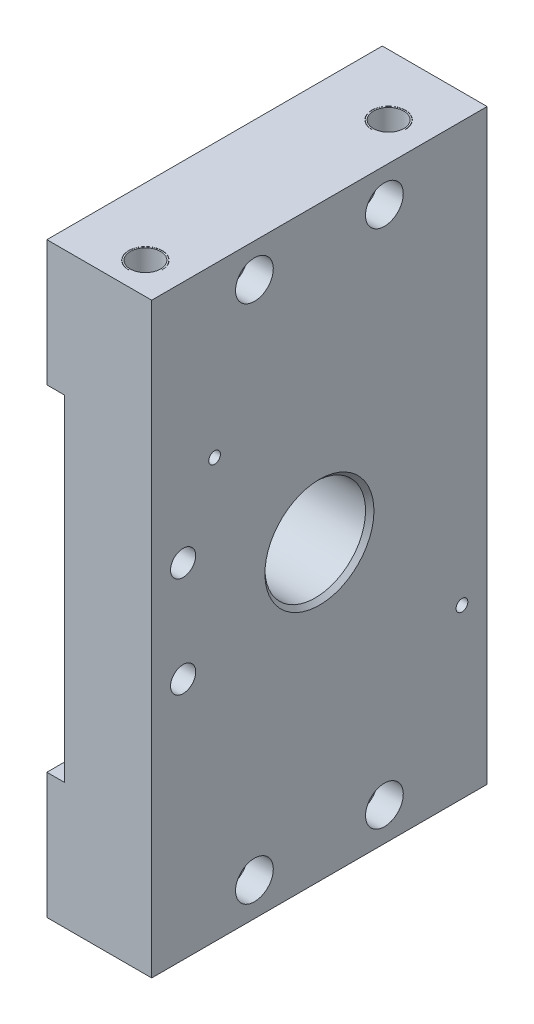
ISO-10303-21;
HEADER;
FILE_DESCRIPTION(('STEP AP214'),'2;1');
FILE_NAME('part.step','',(''),(''),'','','');
FILE_SCHEMA(('AUTOMOTIVE_DESIGN { 1 0 10303 214 1 1 1 1 }'));
ENDSEC;
DATA;
#1=APPLICATION_CONTEXT('core data for automotive mechanical design processes');
#2=APPLICATION_PROTOCOL_DEFINITION('international standard','automotive_design',2000,#1);
#3=PRODUCT_CONTEXT('',#1,'mechanical');
#4=PRODUCT('Part','Part','',(#3));
#5=PRODUCT_RELATED_PRODUCT_CATEGORY('part','',(#4));
#6=PRODUCT_DEFINITION_FORMATION('','',#4);
#7=PRODUCT_DEFINITION_CONTEXT('part definition',#1,'design');
#8=PRODUCT_DEFINITION('design','',#6,#7);
#9=PRODUCT_DEFINITION_SHAPE('','',#8);
#10=(LENGTH_UNIT() NAMED_UNIT(*) SI_UNIT(.MILLI.,.METRE.));
#11=(NAMED_UNIT(*) PLANE_ANGLE_UNIT() SI_UNIT($,.RADIAN.));
#12=(NAMED_UNIT(*) SI_UNIT($,.STERADIAN.) SOLID_ANGLE_UNIT());
#13=UNCERTAINTY_MEASURE_WITH_UNIT(LENGTH_MEASURE(1.E-05),#10,'distance_accuracy_value','');
#14=(GEOMETRIC_REPRESENTATION_CONTEXT(3) GLOBAL_UNCERTAINTY_ASSIGNED_CONTEXT((#13)) GLOBAL_UNIT_ASSIGNED_CONTEXT((#10,
#11,#12)) REPRESENTATION_CONTEXT('',''));
#15=CARTESIAN_POINT('',(0.,0.,0.));
#16=DIRECTION('',(0.,0.,1.));
#17=DIRECTION('',(1.,0.,0.));
#18=AXIS2_PLACEMENT_3D('',#15,#16,#17);
#19=CARTESIAN_POINT('',(-25.0010000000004,0.,0.));
#20=DIRECTION('',(1.,0.,0.));
#21=DIRECTION('',(0.,1.,0.));
#22=AXIS2_PLACEMENT_3D('',#19,#20,#21);
#23=CYLINDRICAL_SURFACE('',#22,12.);
#24=CARTESIAN_POINT('',(-1.00000000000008,0.,0.));
#25=DIRECTION('',(1.,0.,0.));
#26=DIRECTION('',(0.,1.,0.));
#27=AXIS2_PLACEMENT_3D('',#24,#25,#26);
#28=CIRCLE('',#27,12.);
#29=CARTESIAN_POINT('',(-1.00000000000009,12.,0.));
#30=VERTEX_POINT('',#29);
#31=EDGE_CURVE('E58',#30,#30,#28,.T.);
#32=CARTESIAN_POINT('',(-20.8406892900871,0.,0.));
#33=DIRECTION('',(-1.,0.,0.));
#34=DIRECTION('',(0.,0.,1.));
#35=AXIS2_PLACEMENT_3D('',#32,#33,#34);
#36=CIRCLE('',#35,12.);
#37=CARTESIAN_POINT('',(-20.8406892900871,12.,0.));
#38=VERTEX_POINT('',#37);
#39=EDGE_CURVE('E52',#38,#38,#36,.F.);
#40=CARTESIAN_POINT('',(-1.00000000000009,12.,0.));
#41=CARTESIAN_POINT('',(-1.20667384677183,12.,0.));
#42=CARTESIAN_POINT('',(-1.41334769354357,12.,0.));
#43=CARTESIAN_POINT('',(-1.82669538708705,12.,0.));
#44=CARTESIAN_POINT('',(-2.03336923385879,12.,0.));
#45=CARTESIAN_POINT('',(-2.44671692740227,12.,0.));
#46=CARTESIAN_POINT('',(-2.65339077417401,12.,0.));
#47=CARTESIAN_POINT('',(-3.06673846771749,12.,0.));
#48=CARTESIAN_POINT('',(-3.27341231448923,12.,0.));
#49=CARTESIAN_POINT('',(-3.68676000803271,12.,0.));
#50=CARTESIAN_POINT('',(-3.89343385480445,12.,0.));
#51=CARTESIAN_POINT('',(-4.30678154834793,12.,0.));
#52=CARTESIAN_POINT('',(-4.51345539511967,12.,0.));
#53=CARTESIAN_POINT('',(-4.92680308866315,12.,0.));
#54=CARTESIAN_POINT('',(-5.13347693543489,12.,0.));
#55=CARTESIAN_POINT('',(-5.54682462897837,12.,0.));
#56=CARTESIAN_POINT('',(-5.75349847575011,12.,0.));
#57=CARTESIAN_POINT('',(-6.16684616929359,12.,0.));
#58=CARTESIAN_POINT('',(-6.37352001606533,12.,0.));
#59=CARTESIAN_POINT('',(-6.78686770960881,12.,0.));
#60=CARTESIAN_POINT('',(-6.99354155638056,12.,0.));
#61=CARTESIAN_POINT('',(-7.40688924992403,12.,0.));
#62=CARTESIAN_POINT('',(-7.61356309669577,12.,0.));
#63=CARTESIAN_POINT('',(-8.02691079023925,12.,0.));
#64=CARTESIAN_POINT('',(-8.233584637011,12.,0.));
#65=CARTESIAN_POINT('',(-8.64693233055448,12.,0.));
#66=CARTESIAN_POINT('',(-8.85360617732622,12.,0.));
#67=CARTESIAN_POINT('',(-9.2669538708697,12.,0.));
#68=CARTESIAN_POINT('',(-9.47362771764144,12.,0.));
#69=CARTESIAN_POINT('',(-9.88697541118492,12.,0.));
#70=CARTESIAN_POINT('',(-10.0936492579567,12.,0.));
#71=CARTESIAN_POINT('',(-10.5069969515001,12.,0.));
#72=CARTESIAN_POINT('',(-10.7136707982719,12.,0.));
#73=CARTESIAN_POINT('',(-11.1270184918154,12.,0.));
#74=CARTESIAN_POINT('',(-11.3336923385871,12.,0.));
#75=CARTESIAN_POINT('',(-11.7470400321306,12.,0.));
#76=CARTESIAN_POINT('',(-11.9537138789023,12.,0.));
#77=CARTESIAN_POINT('',(-12.3670615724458,12.,0.));
#78=CARTESIAN_POINT('',(-12.5737354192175,12.,0.));
#79=CARTESIAN_POINT('',(-12.987083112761,12.,0.));
#80=CARTESIAN_POINT('',(-13.1937569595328,12.,0.));
#81=CARTESIAN_POINT('',(-13.6071046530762,12.,0.));
#82=CARTESIAN_POINT('',(-13.813778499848,12.,0.));
#83=CARTESIAN_POINT('',(-14.2271261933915,12.,0.));
#84=CARTESIAN_POINT('',(-14.4338000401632,12.,0.));
#85=CARTESIAN_POINT('',(-14.8471477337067,12.,0.));
#86=CARTESIAN_POINT('',(-15.0538215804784,12.,0.));
#87=CARTESIAN_POINT('',(-15.4671692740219,12.,0.));
#88=CARTESIAN_POINT('',(-15.6738431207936,12.,0.));
#89=CARTESIAN_POINT('',(-16.0871908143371,12.,0.));
#90=CARTESIAN_POINT('',(-16.2938646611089,12.,0.));
#91=CARTESIAN_POINT('',(-16.7072123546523,12.,0.));
#92=CARTESIAN_POINT('',(-16.9138862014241,12.,0.));
#93=CARTESIAN_POINT('',(-17.3272338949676,12.,0.));
#94=CARTESIAN_POINT('',(-17.5339077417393,12.,0.));
#95=CARTESIAN_POINT('',(-17.9472554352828,12.,0.));
#96=CARTESIAN_POINT('',(-18.1539292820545,12.,0.));
#97=CARTESIAN_POINT('',(-18.567276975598,12.,0.));
#98=CARTESIAN_POINT('',(-18.7739508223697,12.,0.));
#99=CARTESIAN_POINT('',(-19.1872985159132,12.,0.));
#100=CARTESIAN_POINT('',(-19.393972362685,12.,0.));
#101=CARTESIAN_POINT('',(-19.8073200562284,12.,0.));
#102=CARTESIAN_POINT('',(-20.0139939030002,12.,0.));
#103=CARTESIAN_POINT('',(-20.4273415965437,12.,0.));
#104=CARTESIAN_POINT('',(-20.6340154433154,12.,0.));
#105=CARTESIAN_POINT('',(-20.8406892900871,12.,0.));
#106=B_SPLINE_CURVE_WITH_KNOTS('',3,(#40,#41,#42,#43,#44,#45,#46,#47,#48,#49,#50,#51,#52,#53,
#54,#55,#56,#57,#58,#59,#60,#61,#62,#63,#64,#65,#66,#67,#68,#69,#70,#71,#72,#73,#74,#75,#76,#77,
#78,#79,#80,#81,#82,#83,#84,#85,#86,#87,#88,#89,#90,#91,#92,#93,#94,#95,#96,#97,#98,#99,#100,
#101,#102,#103,#104,#105),.UNSPECIFIED.,.F.,.F.,(4,2,2,2,2,2,2,2,2,2,2,2,2,2,2,2,2,2,2,2,2,2,2,
2,2,2,2,2,2,2,2,2,4),(0.,0.620021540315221,1.24004308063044,1.86006462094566,2.48008616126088,
3.1001077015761,3.72012924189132,4.34015078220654,4.96017232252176,5.58019386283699,
6.20021540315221,6.82023694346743,7.44025848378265,8.06028002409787,8.68030156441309,
9.30032310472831,9.92034464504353,10.5403661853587,11.160387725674,11.7804092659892,
12.4004308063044,13.0204523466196,13.6404738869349,14.2604954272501,14.8805169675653,
15.5005385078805,16.1205600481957,16.740581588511,17.3606031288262,17.9806246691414,
18.6006462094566,19.2206677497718,19.8406892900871),.UNSPECIFIED.);
#107=EDGE_CURVE('BSEAM48',#30,#38,#106,.T.);
#108=ORIENTED_EDGE('',*,*,#31,.T.);
#109=ORIENTED_EDGE('',*,*,#39,.F.);
#110=ORIENTED_EDGE('',*,*,#107,.T.);
#111=ORIENTED_EDGE('',*,*,#107,.F.);
#112=EDGE_LOOP('',(#108,#110,#109,#111));
#113=FACE_BOUND('',#112,.T.);
#114=ADVANCED_FACE('F48',(#113),#23,.F.);
#115=CARTESIAN_POINT('',(0.,0.,0.));
#116=DIRECTION('',(1.,0.,0.));
#117=DIRECTION('',(0.,1.,0.));
#118=AXIS2_PLACEMENT_3D('',#115,#116,#117);
#119=PLANE('',#118);
#120=CARTESIAN_POINT('',(0.,0.,0.));
#121=DIRECTION('',(1.,0.,0.));
#122=DIRECTION('',(0.,1.,0.));
#123=AXIS2_PLACEMENT_3D('',#120,#121,#122);
#124=CIRCLE('',#123,13.0000000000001);
#125=CARTESIAN_POINT('',(0.,13.0000000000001,0.));
#126=VERTEX_POINT('',#125);
#127=EDGE_CURVE('E11',#126,#126,#124,.F.);
#128=ORIENTED_EDGE('',*,*,#127,.T.);
#129=EDGE_LOOP('',(#128));
#130=FACE_BOUND('',#129,.T.);
#131=CARTESIAN_POINT('',(1.94289029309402E-13,30.,25.));
#132=DIRECTION('',(-1.,0.,0.));
#133=DIRECTION('',(0.,0.,1.));
#134=AXIS2_PLACEMENT_3D('',#131,#132,#133);
#135=CIRCLE('',#134,1.39699999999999);
#136=CARTESIAN_POINT('',(1.94289029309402E-13,30.,26.397));
#137=VERTEX_POINT('',#136);
#138=EDGE_CURVE('E1648',#137,#137,#135,.T.);
#139=ORIENTED_EDGE('',*,*,#138,.T.);
#140=EDGE_LOOP('',(#139));
#141=FACE_BOUND('',#140,.T.);
#142=CARTESIAN_POINT('',(1.94289029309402E-13,-12.,32.5));
#143=DIRECTION('',(-1.,0.,0.));
#144=DIRECTION('',(0.,-1.,0.));
#145=AXIS2_PLACEMENT_3D('',#142,#143,#144);
#146=CIRCLE('',#145,3.);
#147=CARTESIAN_POINT('',(1.94472726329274E-13,-15.,32.5));
#148=VERTEX_POINT('',#147);
#149=EDGE_CURVE('E652',#148,#148,#146,.T.);
#150=ORIENTED_EDGE('',*,*,#149,.T.);
#151=EDGE_LOOP('',(#150));
#152=FACE_BOUND('',#151,.T.);
#153=CARTESIAN_POINT('',(0.,12.,32.5));
#154=DIRECTION('',(-1.,0.,0.));
#155=DIRECTION('',(0.,-1.,0.));
#156=AXIS2_PLACEMENT_3D('',#153,#154,#155);
#157=CIRCLE('',#156,3.);
#158=CARTESIAN_POINT('',(0.,9.,32.5));
#159=VERTEX_POINT('',#158);
#160=EDGE_CURVE('E656',#159,#159,#157,.T.);
#161=ORIENTED_EDGE('',*,*,#160,.T.);
#162=EDGE_LOOP('',(#161));
#163=FACE_BOUND('',#162,.T.);
#164=CARTESIAN_POINT('',(0.,-62.,-15.5));
#165=DIRECTION('',(-1.,0.,0.));
#166=DIRECTION('',(0.,-1.,0.));
#167=AXIS2_PLACEMENT_3D('',#164,#165,#166);
#168=CIRCLE('',#167,4.5);
#169=CARTESIAN_POINT('',(0.,-66.5,-15.5));
#170=VERTEX_POINT('',#169);
#171=EDGE_CURVE('E504',#170,#170,#168,.T.);
#172=ORIENTED_EDGE('',*,*,#171,.T.);
#173=EDGE_LOOP('',(#172));
#174=FACE_BOUND('',#173,.T.);
#175=CARTESIAN_POINT('',(0.,-62.,15.5));
#176=DIRECTION('',(-1.,0.,0.));
#177=DIRECTION('',(0.,-1.,0.));
#178=AXIS2_PLACEMENT_3D('',#175,#176,#177);
#179=CIRCLE('',#178,4.5);
#180=CARTESIAN_POINT('',(0.,-66.5,15.5));
#181=VERTEX_POINT('',#180);
#182=EDGE_CURVE('E499',#181,#181,#179,.T.);
#183=ORIENTED_EDGE('',*,*,#182,.T.);
#184=EDGE_LOOP('',(#183));
#185=FACE_BOUND('',#184,.T.);
#186=CARTESIAN_POINT('',(0.,62.,15.5));
#187=DIRECTION('',(-1.,0.,0.));
#188=DIRECTION('',(0.,-1.,0.));
#189=AXIS2_PLACEMENT_3D('',#186,#187,#188);
#190=CIRCLE('',#189,4.5);
#191=CARTESIAN_POINT('',(0.,57.5,15.5));
#192=VERTEX_POINT('',#191);
#193=EDGE_CURVE('E503',#192,#192,#190,.T.);
#194=ORIENTED_EDGE('',*,*,#193,.T.);
#195=EDGE_LOOP('',(#194));
#196=FACE_BOUND('',#195,.T.);
#197=CARTESIAN_POINT('',(0.,62.,-15.5));
#198=DIRECTION('',(-1.,0.,0.));
#199=DIRECTION('',(0.,-1.,0.));
#200=AXIS2_PLACEMENT_3D('',#197,#198,#199);
#201=CIRCLE('',#200,4.5);
#202=CARTESIAN_POINT('',(0.,57.5,-15.5));
#203=VERTEX_POINT('',#202);
#204=EDGE_CURVE('E561',#203,#203,#201,.T.);
#205=ORIENTED_EDGE('',*,*,#204,.T.);
#206=EDGE_LOOP('',(#205));
#207=FACE_BOUND('',#206,.T.);
#208=DIRECTION('',(0.,1.,0.));
#209=VECTOR('',#208,1.);
#210=CARTESIAN_POINT('',(0.,-70.,-40.0000000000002));
#211=LINE('',#210,#209);
#212=CARTESIAN_POINT('',(0.,-70.,-40.0000000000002));
#213=VERTEX_POINT('',#212);
#214=CARTESIAN_POINT('',(-1.66533453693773E-13,70.,-40.));
#215=VERTEX_POINT('',#214);
#216=EDGE_CURVE('E516',#213,#215,#211,.T.);
#217=ORIENTED_EDGE('',*,*,#216,.T.);
#218=DIRECTION('',(0.,0.,1.));
#219=VECTOR('',#218,1.);
#220=CARTESIAN_POINT('',(-1.66533453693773E-13,70.,-40.));
#221=LINE('',#220,#219);
#222=CARTESIAN_POINT('',(0.,70.,40.));
#223=VERTEX_POINT('',#222);
#224=EDGE_CURVE('E511',#215,#223,#221,.T.);
#225=ORIENTED_EDGE('',*,*,#224,.T.);
#226=DIRECTION('',(0.,-1.,0.));
#227=VECTOR('',#226,1.);
#228=CARTESIAN_POINT('',(0.,70.,40.));
#229=LINE('',#228,#227);
#230=CARTESIAN_POINT('',(1.66533453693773E-13,-70.,39.9999999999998));
#231=VERTEX_POINT('',#230);
#232=EDGE_CURVE('E507',#223,#231,#229,.T.);
#233=ORIENTED_EDGE('',*,*,#232,.T.);
#234=DIRECTION('',(0.,0.,-1.));
#235=VECTOR('',#234,1.);
#236=CARTESIAN_POINT('',(1.66533453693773E-13,-70.,39.9999999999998));
#237=LINE('',#236,#235);
#238=EDGE_CURVE('E512',#231,#213,#237,.T.);
#239=ORIENTED_EDGE('',*,*,#238,.T.);
#240=EDGE_LOOP('',(#217,#225,#233,#239));
#241=FACE_BOUND('',#240,.T.);
#242=CARTESIAN_POINT('',(1.94289029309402E-13,-30.,-34.));
#243=DIRECTION('',(-1.,0.,0.));
#244=DIRECTION('',(0.,0.,1.));
#245=AXIS2_PLACEMENT_3D('',#242,#243,#244);
#246=CIRCLE('',#245,1.397);
#247=CARTESIAN_POINT('',(1.94289029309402E-13,-30.,-32.603));
#248=VERTEX_POINT('',#247);
#249=EDGE_CURVE('E1636',#248,#248,#246,.T.);
#250=ORIENTED_EDGE('',*,*,#249,.T.);
#251=EDGE_LOOP('',(#250));
#252=FACE_BOUND('',#251,.T.);
#253=ADVANCED_FACE('F786',(#130,#141,#152,#163,#174,#185,#196,#207,#241,#252),#119,.T.);
#254=CARTESIAN_POINT('',(-20.8406892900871,-40.,-40.));
#255=DIRECTION('',(-1.,0.,0.));
#256=DIRECTION('',(0.,-1.,0.));
#257=AXIS2_PLACEMENT_3D('',#254,#255,#256);
#258=PLANE('',#257);
#259=DIRECTION('',(0.,1.,0.));
#260=VECTOR('',#259,1.);
#261=CARTESIAN_POINT('',(-20.8406892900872,40.,40.));
#262=LINE('',#261,#260);
#263=CARTESIAN_POINT('',(-20.8406892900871,-40.,40.));
#264=VERTEX_POINT('',#263);
#265=CARTESIAN_POINT('',(-20.8406892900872,40.,40.));
#266=VERTEX_POINT('',#265);
#267=EDGE_CURVE('E1656',#264,#266,#262,.T.);
#268=ORIENTED_EDGE('',*,*,#267,.T.);
#269=DIRECTION('',(0.,0.,-1.));
#270=VECTOR('',#269,1.);
#271=CARTESIAN_POINT('',(-20.8406892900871,40.,-40.));
#272=LINE('',#271,#270);
#273=CARTESIAN_POINT('',(-20.8406892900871,40.,-40.));
#274=VERTEX_POINT('',#273);
#275=EDGE_CURVE('E1659',#266,#274,#272,.T.);
#276=ORIENTED_EDGE('',*,*,#275,.T.);
#277=DIRECTION('',(0.,-1.,0.));
#278=VECTOR('',#277,1.);
#279=CARTESIAN_POINT('',(-20.8406892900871,40.,-40.));
#280=LINE('',#279,#278);
#281=CARTESIAN_POINT('',(-20.8406892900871,-40.,-40.));
#282=VERTEX_POINT('',#281);
#283=EDGE_CURVE('E1652',#274,#282,#280,.T.);
#284=ORIENTED_EDGE('',*,*,#283,.T.);
#285=DIRECTION('',(0.,0.,1.));
#286=VECTOR('',#285,1.);
#287=CARTESIAN_POINT('',(-20.8406892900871,-40.,-40.));
#288=LINE('',#287,#286);
#289=EDGE_CURVE('E65',#282,#264,#288,.T.);
#290=ORIENTED_EDGE('',*,*,#289,.T.);
#291=EDGE_LOOP('',(#268,#276,#284,#290));
#292=FACE_BOUND('',#291,.T.);
#293=ORIENTED_EDGE('',*,*,#39,.T.);
#294=EDGE_LOOP('',(#293));
#295=FACE_BOUND('',#294,.T.);
#296=CARTESIAN_POINT('',(-20.8406892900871,-30.,-34.));
#297=DIRECTION('',(-1.,0.,0.));
#298=DIRECTION('',(0.,0.,1.));
#299=AXIS2_PLACEMENT_3D('',#296,#297,#298);
#300=CIRCLE('',#299,1.397);
#301=CARTESIAN_POINT('',(-20.8406892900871,-30.,-32.603));
#302=VERTEX_POINT('',#301);
#303=EDGE_CURVE('E1639',#302,#302,#300,.T.);
#304=ORIENTED_EDGE('',*,*,#303,.F.);
#305=EDGE_LOOP('',(#304));
#306=FACE_BOUND('',#305,.T.);
#307=CARTESIAN_POINT('',(-20.8406892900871,-30.,30.));
#308=DIRECTION('',(-1.,0.,0.));
#309=DIRECTION('',(0.,0.,1.));
#310=AXIS2_PLACEMENT_3D('',#307,#308,#309);
#311=CIRCLE('',#310,1.28904999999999);
#312=CARTESIAN_POINT('',(-20.8406892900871,-30.,31.28905));
#313=VERTEX_POINT('',#312);
#314=EDGE_CURVE('E1796',#313,#313,#311,.T.);
#315=ORIENTED_EDGE('',*,*,#314,.F.);
#316=EDGE_LOOP('',(#315));
#317=FACE_BOUND('',#316,.T.);
#318=CARTESIAN_POINT('',(-20.8406892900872,30.,25.));
#319=DIRECTION('',(-1.,0.,0.));
#320=DIRECTION('',(0.,0.,1.));
#321=AXIS2_PLACEMENT_3D('',#318,#319,#320);
#322=CIRCLE('',#321,1.39699999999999);
#323=CARTESIAN_POINT('',(-20.8406892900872,30.,26.397));
#324=VERTEX_POINT('',#323);
#325=EDGE_CURVE('E1810',#324,#324,#322,.T.);
#326=ORIENTED_EDGE('',*,*,#325,.F.);
#327=EDGE_LOOP('',(#326));
#328=FACE_BOUND('',#327,.T.);
#329=CARTESIAN_POINT('',(-20.8406892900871,34.,-34.));
#330=DIRECTION('',(-1.,0.,0.));
#331=DIRECTION('',(0.,0.,1.));
#332=AXIS2_PLACEMENT_3D('',#329,#330,#331);
#333=CIRCLE('',#332,1.28904999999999);
#334=CARTESIAN_POINT('',(-20.8406892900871,34.,-32.71095));
#335=VERTEX_POINT('',#334);
#336=EDGE_CURVE('E1797',#335,#335,#333,.T.);
#337=ORIENTED_EDGE('',*,*,#336,.F.);
#338=EDGE_LOOP('',(#337));
#339=FACE_BOUND('',#338,.T.);
#340=ADVANCED_FACE('F791',(#292,#295,#306,#317,#328,#339),#258,.T.);
#341=CARTESIAN_POINT('',(-25.,0.,0.));
#342=DIRECTION('',(-1.,0.,0.));
#343=DIRECTION('',(0.,-1.,0.));
#344=AXIS2_PLACEMENT_3D('',#341,#342,#343);
#345=PLANE('',#344);
#346=DIRECTION('',(0.,0.,-1.));
#347=VECTOR('',#346,1.);
#348=CARTESIAN_POINT('',(-25.,40.,-40.));
#349=LINE('',#348,#347);
#350=CARTESIAN_POINT('',(-25.,40.,40.));
#351=VERTEX_POINT('',#350);
#352=CARTESIAN_POINT('',(-25.,40.,-40.));
#353=VERTEX_POINT('',#352);
#354=EDGE_CURVE('E1644',#351,#353,#349,.T.);
#355=ORIENTED_EDGE('',*,*,#354,.F.);
#356=DIRECTION('',(0.,-1.,0.));
#357=VECTOR('',#356,1.);
#358=CARTESIAN_POINT('',(-25.0000000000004,70.,40.));
#359=LINE('',#358,#357);
#360=CARTESIAN_POINT('',(-25.0000000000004,70.,40.));
#361=VERTEX_POINT('',#360);
#362=EDGE_CURVE('E552',#361,#351,#359,.T.);
#363=ORIENTED_EDGE('',*,*,#362,.F.);
#364=DIRECTION('',(0.,0.,1.));
#365=VECTOR('',#364,1.);
#366=CARTESIAN_POINT('',(-25.,70.,-40.));
#367=LINE('',#366,#365);
#368=CARTESIAN_POINT('',(-25.,70.,-40.));
#369=VERTEX_POINT('',#368);
#370=EDGE_CURVE('E433',#369,#361,#367,.T.);
#371=ORIENTED_EDGE('',*,*,#370,.F.);
#372=DIRECTION('',(0.,1.,0.));
#373=VECTOR('',#372,1.);
#374=CARTESIAN_POINT('',(-24.9999999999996,-70.,-40.));
#375=LINE('',#374,#373);
#376=EDGE_CURVE('E74',#353,#369,#375,.T.);
#377=ORIENTED_EDGE('',*,*,#376,.F.);
#378=EDGE_LOOP('',(#355,#363,#371,#377));
#379=FACE_BOUND('',#378,.T.);
#380=CARTESIAN_POINT('',(-25.,61.9999999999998,15.5));
#381=DIRECTION('',(1.,0.,0.));
#382=DIRECTION('',(0.,-1.,0.));
#383=AXIS2_PLACEMENT_3D('',#380,#381,#382);
#384=CIRCLE('',#383,5.5);
#385=CARTESIAN_POINT('',(-25.,56.4999999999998,15.5));
#386=VERTEX_POINT('',#385);
#387=EDGE_CURVE('E759',#386,#386,#384,.T.);
#388=ORIENTED_EDGE('',*,*,#387,.T.);
#389=EDGE_LOOP('',(#388));
#390=FACE_BOUND('',#389,.T.);
#391=CARTESIAN_POINT('',(-25.,61.9999999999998,-15.5));
#392=DIRECTION('',(1.,0.,0.));
#393=DIRECTION('',(0.,-1.,0.));
#394=AXIS2_PLACEMENT_3D('',#391,#392,#393);
#395=CIRCLE('',#394,5.5);
#396=CARTESIAN_POINT('',(-25.,56.4999999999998,-15.5));
#397=VERTEX_POINT('',#396);
#398=EDGE_CURVE('E755',#397,#397,#395,.T.);
#399=ORIENTED_EDGE('',*,*,#398,.T.);
#400=EDGE_LOOP('',(#399));
#401=FACE_BOUND('',#400,.T.);
#402=ADVANCED_FACE('F817',(#379,#390,#401),#345,.T.);
#403=DIRECTION('',(0.,0.,1.));
#404=VECTOR('',#403,1.);
#405=CARTESIAN_POINT('',(-25.,-40.,-40.));
#406=LINE('',#405,#404);
#407=CARTESIAN_POINT('',(-25.,-40.,-40.));
#408=VERTEX_POINT('',#407);
#409=CARTESIAN_POINT('',(-25.,-40.,40.));
#410=VERTEX_POINT('',#409);
#411=EDGE_CURVE('E1638',#408,#410,#406,.T.);
#412=ORIENTED_EDGE('',*,*,#411,.F.);
#413=CARTESIAN_POINT('',(-24.9999999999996,-70.,-40.));
#414=VERTEX_POINT('',#413);
#415=EDGE_CURVE('E657',#414,#408,#375,.T.);
#416=ORIENTED_EDGE('',*,*,#415,.F.);
#417=DIRECTION('',(0.,0.,-1.));
#418=VECTOR('',#417,1.);
#419=CARTESIAN_POINT('',(-25.,-70.,40.));
#420=LINE('',#419,#418);
#421=CARTESIAN_POINT('',(-25.,-70.,40.));
#422=VERTEX_POINT('',#421);
#423=EDGE_CURVE('E377',#422,#414,#420,.T.);
#424=ORIENTED_EDGE('',*,*,#423,.F.);
#425=EDGE_CURVE('E557',#410,#422,#359,.T.);
#426=ORIENTED_EDGE('',*,*,#425,.F.);
#427=EDGE_LOOP('',(#412,#416,#424,#426));
#428=FACE_BOUND('',#427,.T.);
#429=CARTESIAN_POINT('',(-25.,-62.0000000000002,15.5));
#430=DIRECTION('',(1.,0.,0.));
#431=DIRECTION('',(0.,-1.,0.));
#432=AXIS2_PLACEMENT_3D('',#429,#430,#431);
#433=CIRCLE('',#432,5.5);
#434=CARTESIAN_POINT('',(-25.,-67.5000000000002,15.5));
#435=VERTEX_POINT('',#434);
#436=EDGE_CURVE('E1347',#435,#435,#433,.T.);
#437=ORIENTED_EDGE('',*,*,#436,.T.);
#438=EDGE_LOOP('',(#437));
#439=FACE_BOUND('',#438,.T.);
#440=CARTESIAN_POINT('',(-25.,-62.0000000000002,-15.5));
#441=DIRECTION('',(1.,0.,0.));
#442=DIRECTION('',(0.,-1.,0.));
#443=AXIS2_PLACEMENT_3D('',#440,#441,#442);
#444=CIRCLE('',#443,5.5);
#445=CARTESIAN_POINT('',(-25.,-67.5000000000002,-15.5));
#446=VERTEX_POINT('',#445);
#447=EDGE_CURVE('E1343',#446,#446,#444,.T.);
#448=ORIENTED_EDGE('',*,*,#447,.T.);
#449=EDGE_LOOP('',(#448));
#450=FACE_BOUND('',#449,.T.);
#451=ADVANCED_FACE('F826',(#428,#439,#450),#345,.T.);
#452=CARTESIAN_POINT('',(0.,-70.,-40.0000000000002));
#453=DIRECTION('',(0.,0.,-1.));
#454=DIRECTION('',(0.,1.,0.));
#455=AXIS2_PLACEMENT_3D('',#452,#453,#454);
#456=PLANE('',#455);
#457=DIRECTION('',(-1.,0.,0.));
#458=VECTOR('',#457,1.);
#459=CARTESIAN_POINT('',(-20.8406892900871,40.,-40.));
#460=LINE('',#459,#458);
#461=EDGE_CURVE('E1247',#274,#353,#460,.T.);
#462=ORIENTED_EDGE('',*,*,#461,.T.);
#463=ORIENTED_EDGE('',*,*,#376,.T.);
#464=DIRECTION('',(-1.,0.,0.));
#465=VECTOR('',#464,1.);
#466=CARTESIAN_POINT('',(-1.66533453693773E-13,70.,-40.));
#467=LINE('',#466,#465);
#468=EDGE_CURVE('E430',#215,#369,#467,.T.);
#469=ORIENTED_EDGE('',*,*,#468,.F.);
#470=ORIENTED_EDGE('',*,*,#216,.F.);
#471=DIRECTION('',(-1.,0.,0.));
#472=VECTOR('',#471,1.);
#473=CARTESIAN_POINT('',(0.,-70.,-40.0000000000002));
#474=LINE('',#473,#472);
#475=EDGE_CURVE('E751',#213,#414,#474,.T.);
#476=ORIENTED_EDGE('',*,*,#475,.T.);
#477=ORIENTED_EDGE('',*,*,#415,.T.);
#478=DIRECTION('',(-1.,0.,0.));
#479=VECTOR('',#478,1.);
#480=CARTESIAN_POINT('',(-20.8406892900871,-40.,-40.));
#481=LINE('',#480,#479);
#482=EDGE_CURVE('E1662',#282,#408,#481,.T.);
#483=ORIENTED_EDGE('',*,*,#482,.F.);
#484=ORIENTED_EDGE('',*,*,#283,.F.);
#485=EDGE_LOOP('',(#462,#463,#469,#470,#476,#477,#483,#484));
#486=FACE_BOUND('',#485,.T.);
#487=CARTESIAN_POINT('',(-9.00000000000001,52.,-40.));
#488=DIRECTION('',(0.,0.,1.));
#489=DIRECTION('',(0.,-1.,0.));
#490=AXIS2_PLACEMENT_3D('',#487,#488,#489);
#491=CIRCLE('',#490,3.625);
#492=CARTESIAN_POINT('',(-9.00000000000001,48.375,-40.));
#493=VERTEX_POINT('',#492);
#494=EDGE_CURVE('E687',#493,#493,#491,.T.);
#495=ORIENTED_EDGE('',*,*,#494,.T.);
#496=EDGE_LOOP('',(#495));
#497=FACE_BOUND('',#496,.T.);
#498=CARTESIAN_POINT('',(-9.00000000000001,52.,-40.));
#499=DIRECTION('',(0.,0.,-1.));
#500=DIRECTION('',(1.,0.,0.));
#501=AXIS2_PLACEMENT_3D('',#498,#499,#500);
#502=CIRCLE('',#501,3.95);
#503=CARTESIAN_POINT('',(-9.00000000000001,48.05,-40.));
#504=VERTEX_POINT('',#503);
#505=CARTESIAN_POINT('',(-5.05,52.,-40.));
#506=VERTEX_POINT('',#505);
#507=EDGE_CURVE('E684',#504,#506,#502,.T.);
#508=ORIENTED_EDGE('',*,*,#507,.T.);
#509=DIRECTION('',(1.,0.,0.));
#510=VECTOR('',#509,1.);
#511=CARTESIAN_POINT('',(-2.5125,52.,-40.));
#512=LINE('',#511,#510);
#513=CARTESIAN_POINT('',(-5.,52.,-40.));
#514=VERTEX_POINT('',#513);
#515=EDGE_CURVE('E587',#506,#514,#512,.T.);
#516=ORIENTED_EDGE('',*,*,#515,.T.);
#517=CARTESIAN_POINT('',(-9.00000000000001,52.,-40.));
#518=DIRECTION('',(0.,0.,1.));
#519=DIRECTION('',(1.,0.,0.));
#520=AXIS2_PLACEMENT_3D('',#517,#518,#519);
#521=CIRCLE('',#520,4.);
#522=CARTESIAN_POINT('',(-9.00000000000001,48.,-40.));
#523=VERTEX_POINT('',#522);
#524=EDGE_CURVE('E580',#514,#523,#521,.T.);
#525=ORIENTED_EDGE('',*,*,#524,.T.);
#526=DIRECTION('',(0.,1.,0.));
#527=VECTOR('',#526,1.);
#528=CARTESIAN_POINT('',(-8.99999999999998,-10.9875,-40.));
#529=LINE('',#528,#527);
#530=EDGE_CURVE('E588',#523,#504,#529,.T.);
#531=ORIENTED_EDGE('',*,*,#530,.T.);
#532=EDGE_LOOP('',(#508,#516,#525,#531));
#533=FACE_BOUND('',#532,.T.);
#534=CARTESIAN_POINT('',(-8.99999999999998,-52.,-40.));
#535=DIRECTION('',(0.,0.,1.));
#536=DIRECTION('',(0.,-1.,0.));
#537=AXIS2_PLACEMENT_3D('',#534,#535,#536);
#538=CIRCLE('',#537,3.625);
#539=CARTESIAN_POINT('',(-8.99999999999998,-55.625,-40.));
#540=VERTEX_POINT('',#539);
#541=EDGE_CURVE('E1282',#540,#540,#538,.T.);
#542=ORIENTED_EDGE('',*,*,#541,.T.);
#543=EDGE_LOOP('',(#542));
#544=FACE_BOUND('',#543,.T.);
#545=CARTESIAN_POINT('',(-8.99999999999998,-52.,-40.));
#546=DIRECTION('',(0.,0.,-1.));
#547=DIRECTION('',(1.,0.,0.));
#548=AXIS2_PLACEMENT_3D('',#545,#546,#547);
#549=CIRCLE('',#548,3.95);
#550=CARTESIAN_POINT('',(-8.99999999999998,-55.95,-40.));
#551=VERTEX_POINT('',#550);
#552=CARTESIAN_POINT('',(-5.04999999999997,-52.,-40.0000000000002));
#553=VERTEX_POINT('',#552);
#554=EDGE_CURVE('E745',#551,#553,#549,.T.);
#555=ORIENTED_EDGE('',*,*,#554,.T.);
#556=DIRECTION('',(1.,0.,0.));
#557=VECTOR('',#556,1.);
#558=CARTESIAN_POINT('',(-2.51249999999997,-52.,-40.));
#559=LINE('',#558,#557);
#560=CARTESIAN_POINT('',(-4.99999999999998,-52.,-40.0000000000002));
#561=VERTEX_POINT('',#560);
#562=EDGE_CURVE('E741',#553,#561,#559,.T.);
#563=ORIENTED_EDGE('',*,*,#562,.T.);
#564=CARTESIAN_POINT('',(-8.99999999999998,-52.,-40.));
#565=DIRECTION('',(0.,0.,1.));
#566=DIRECTION('',(1.,0.,0.));
#567=AXIS2_PLACEMENT_3D('',#564,#565,#566);
#568=CIRCLE('',#567,4.);
#569=CARTESIAN_POINT('',(-8.99999999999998,-56.,-40.));
#570=VERTEX_POINT('',#569);
#571=EDGE_CURVE('E409',#561,#570,#568,.T.);
#572=ORIENTED_EDGE('',*,*,#571,.T.);
#573=DIRECTION('',(0.,1.,0.));
#574=VECTOR('',#573,1.);
#575=CARTESIAN_POINT('',(-9.00000000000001,-62.9875,-40.));
#576=LINE('',#575,#574);
#577=EDGE_CURVE('E402',#570,#551,#576,.T.);
#578=ORIENTED_EDGE('',*,*,#577,.T.);
#579=EDGE_LOOP('',(#555,#563,#572,#578));
#580=FACE_BOUND('',#579,.T.);
#581=ADVANCED_FACE('F828',(#486,#497,#533,#544,#580),#456,.T.);
#582=CARTESIAN_POINT('',(1.66533453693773E-13,-70.,39.9999999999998));
#583=DIRECTION('',(0.,-1.,0.));
#584=DIRECTION('',(0.,0.,-1.));
#585=AXIS2_PLACEMENT_3D('',#582,#583,#584);
#586=PLANE('',#585);
#587=ORIENTED_EDGE('',*,*,#423,.T.);
#588=ORIENTED_EDGE('',*,*,#475,.F.);
#589=ORIENTED_EDGE('',*,*,#238,.F.);
#590=DIRECTION('',(-1.,0.,0.));
#591=VECTOR('',#590,1.);
#592=CARTESIAN_POINT('',(1.66533453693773E-13,-70.,39.9999999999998));
#593=LINE('',#592,#591);
#594=EDGE_CURVE('E370',#231,#422,#593,.T.);
#595=ORIENTED_EDGE('',*,*,#594,.T.);
#596=EDGE_LOOP('',(#587,#588,#589,#595));
#597=FACE_BOUND('',#596,.T.);
#598=CARTESIAN_POINT('',(-8.99999999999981,-70.,32.5));
#599=DIRECTION('',(0.,1.,0.));
#600=DIRECTION('',(-1.,0.,0.));
#601=AXIS2_PLACEMENT_3D('',#598,#599,#600);
#602=CIRCLE('',#601,3.625);
#603=CARTESIAN_POINT('',(-12.6249999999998,-70.,32.5));
#604=VERTEX_POINT('',#603);
#605=EDGE_CURVE('E378',#604,#604,#602,.T.);
#606=ORIENTED_EDGE('',*,*,#605,.T.);
#607=EDGE_LOOP('',(#606));
#608=FACE_BOUND('',#607,.T.);
#609=CARTESIAN_POINT('',(-8.99999999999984,-70.,32.5));
#610=DIRECTION('',(0.,-1.,0.));
#611=DIRECTION('',(0.,0.,1.));
#612=AXIS2_PLACEMENT_3D('',#609,#610,#611);
#613=CIRCLE('',#612,3.95);
#614=CARTESIAN_POINT('',(-12.9499999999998,-70.,32.5));
#615=VERTEX_POINT('',#614);
#616=CARTESIAN_POINT('',(-8.99999999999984,-70.,36.45));
#617=VERTEX_POINT('',#616);
#618=EDGE_CURVE('E732',#615,#617,#613,.T.);
#619=ORIENTED_EDGE('',*,*,#618,.T.);
#620=DIRECTION('',(0.,0.,1.));
#621=VECTOR('',#620,1.);
#622=CARTESIAN_POINT('',(-8.99999999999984,-70.,38.2375));
#623=LINE('',#622,#621);
#624=CARTESIAN_POINT('',(-8.99999999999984,-70.,36.5));
#625=VERTEX_POINT('',#624);
#626=EDGE_CURVE('E728',#617,#625,#623,.T.);
#627=ORIENTED_EDGE('',*,*,#626,.T.);
#628=CARTESIAN_POINT('',(-8.99999999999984,-70.,32.5));
#629=DIRECTION('',(0.,1.,0.));
#630=DIRECTION('',(0.,0.,1.));
#631=AXIS2_PLACEMENT_3D('',#628,#629,#630);
#632=CIRCLE('',#631,4.);
#633=CARTESIAN_POINT('',(-12.9999999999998,-70.,32.5));
#634=VERTEX_POINT('',#633);
#635=EDGE_CURVE('E733',#625,#634,#632,.T.);
#636=ORIENTED_EDGE('',*,*,#635,.T.);
#637=DIRECTION('',(1.,0.,0.));
#638=VECTOR('',#637,1.);
#639=CARTESIAN_POINT('',(-6.48749999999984,-70.,32.5));
#640=LINE('',#639,#638);
#641=EDGE_CURVE('E1306',#634,#615,#640,.T.);
#642=ORIENTED_EDGE('',*,*,#641,.T.);
#643=EDGE_LOOP('',(#619,#627,#636,#642));
#644=FACE_BOUND('',#643,.T.);
#645=CARTESIAN_POINT('',(-9.00000000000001,-70.,-25.5000000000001));
#646=DIRECTION('',(0.,1.,0.));
#647=DIRECTION('',(-1.,0.,0.));
#648=AXIS2_PLACEMENT_3D('',#645,#646,#647);
#649=CIRCLE('',#648,3.625);
#650=CARTESIAN_POINT('',(-12.625,-70.,-25.5000000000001));
#651=VERTEX_POINT('',#650);
#652=EDGE_CURVE('E1302',#651,#651,#649,.T.);
#653=ORIENTED_EDGE('',*,*,#652,.T.);
#654=EDGE_LOOP('',(#653));
#655=FACE_BOUND('',#654,.T.);
#656=DIRECTION('',(1.,0.,0.));
#657=VECTOR('',#656,1.);
#658=CARTESIAN_POINT('',(-6.48750000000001,-70.,-25.5));
#659=LINE('',#658,#657);
#660=CARTESIAN_POINT('',(-13.,-70.,-25.5));
#661=VERTEX_POINT('',#660);
#662=CARTESIAN_POINT('',(-12.95,-70.,-25.5));
#663=VERTEX_POINT('',#662);
#664=EDGE_CURVE('E556',#661,#663,#659,.T.);
#665=ORIENTED_EDGE('',*,*,#664,.T.);
#666=CARTESIAN_POINT('',(-9.00000000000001,-70.,-25.5000000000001));
#667=DIRECTION('',(0.,-1.,0.));
#668=DIRECTION('',(0.,0.,1.));
#669=AXIS2_PLACEMENT_3D('',#666,#667,#668);
#670=CIRCLE('',#669,3.95);
#671=CARTESIAN_POINT('',(-8.99999999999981,-70.,-21.5500000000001));
#672=VERTEX_POINT('',#671);
#673=EDGE_CURVE('E1220',#663,#672,#670,.T.);
#674=ORIENTED_EDGE('',*,*,#673,.T.);
#675=DIRECTION('',(0.,0.,1.));
#676=VECTOR('',#675,1.);
#677=CARTESIAN_POINT('',(-9.00000000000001,-70.,9.2375));
#678=LINE('',#677,#676);
#679=CARTESIAN_POINT('',(-8.99999999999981,-70.,-21.5000000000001));
#680=VERTEX_POINT('',#679);
#681=EDGE_CURVE('E1231',#672,#680,#678,.T.);
#682=ORIENTED_EDGE('',*,*,#681,.T.);
#683=CARTESIAN_POINT('',(-9.00000000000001,-70.,-25.5000000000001));
#684=DIRECTION('',(0.,1.,0.));
#685=DIRECTION('',(0.,0.,1.));
#686=AXIS2_PLACEMENT_3D('',#683,#684,#685);
#687=CIRCLE('',#686,4.);
#688=EDGE_CURVE('E317',#680,#661,#687,.T.);
#689=ORIENTED_EDGE('',*,*,#688,.T.);
#690=EDGE_LOOP('',(#665,#674,#682,#689));
#691=FACE_BOUND('',#690,.T.);
#692=ADVANCED_FACE('F833',(#597,#608,#644,#655,#691),#586,.T.);
#693=CARTESIAN_POINT('',(0.,70.,40.));
#694=DIRECTION('',(0.,0.,1.));
#695=DIRECTION('',(0.,-1.,0.));
#696=AXIS2_PLACEMENT_3D('',#693,#694,#695);
#697=PLANE('',#696);
#698=DIRECTION('',(-1.,0.,0.));
#699=VECTOR('',#698,1.);
#700=CARTESIAN_POINT('',(-20.8406892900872,40.,40.));
#701=LINE('',#700,#699);
#702=EDGE_CURVE('E1669',#266,#351,#701,.T.);
#703=ORIENTED_EDGE('',*,*,#702,.F.);
#704=ORIENTED_EDGE('',*,*,#267,.F.);
#705=DIRECTION('',(-1.,0.,0.));
#706=VECTOR('',#705,1.);
#707=CARTESIAN_POINT('',(-20.8406892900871,-40.,40.));
#708=LINE('',#707,#706);
#709=EDGE_CURVE('E1673',#264,#410,#708,.T.);
#710=ORIENTED_EDGE('',*,*,#709,.T.);
#711=ORIENTED_EDGE('',*,*,#425,.T.);
#712=ORIENTED_EDGE('',*,*,#594,.F.);
#713=ORIENTED_EDGE('',*,*,#232,.F.);
#714=DIRECTION('',(-1.,0.,0.));
#715=VECTOR('',#714,1.);
#716=CARTESIAN_POINT('',(0.,70.,40.));
#717=LINE('',#716,#715);
#718=EDGE_CURVE('E714',#223,#361,#717,.T.);
#719=ORIENTED_EDGE('',*,*,#718,.T.);
#720=ORIENTED_EDGE('',*,*,#362,.T.);
#721=EDGE_LOOP('',(#703,#704,#710,#711,#712,#713,#719,#720));
#722=FACE_BOUND('',#721,.T.);
#723=ADVANCED_FACE('F836',(#722),#697,.T.);
#724=CARTESIAN_POINT('',(-1.66533453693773E-13,70.,-40.));
#725=DIRECTION('',(0.,1.,0.));
#726=DIRECTION('',(0.,0.,1.));
#727=AXIS2_PLACEMENT_3D('',#724,#725,#726);
#728=PLANE('',#727);
#729=ORIENTED_EDGE('',*,*,#370,.T.);
#730=ORIENTED_EDGE('',*,*,#718,.F.);
#731=ORIENTED_EDGE('',*,*,#224,.F.);
#732=ORIENTED_EDGE('',*,*,#468,.T.);
#733=EDGE_LOOP('',(#729,#730,#731,#732));
#734=FACE_BOUND('',#733,.T.);
#735=CARTESIAN_POINT('',(-9.00000000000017,70.,-25.5));
#736=DIRECTION('',(0.,-1.,0.));
#737=DIRECTION('',(1.,0.,0.));
#738=AXIS2_PLACEMENT_3D('',#735,#736,#737);
#739=CIRCLE('',#738,3.625);
#740=CARTESIAN_POINT('',(-5.37500000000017,70.,-25.5));
#741=VERTEX_POINT('',#740);
#742=EDGE_CURVE('E434',#741,#741,#739,.T.);
#743=ORIENTED_EDGE('',*,*,#742,.T.);
#744=EDGE_LOOP('',(#743));
#745=FACE_BOUND('',#744,.T.);
#746=DIRECTION('',(-1.,0.,0.));
#747=VECTOR('',#746,1.);
#748=CARTESIAN_POINT('',(-2.51250000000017,70.,-25.5));
#749=LINE('',#748,#747);
#750=CARTESIAN_POINT('',(-5.00000000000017,70.,-25.5));
#751=VERTEX_POINT('',#750);
#752=CARTESIAN_POINT('',(-5.05000000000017,70.,-25.5));
#753=VERTEX_POINT('',#752);
#754=EDGE_CURVE('E548',#751,#753,#749,.T.);
#755=ORIENTED_EDGE('',*,*,#754,.T.);
#756=CARTESIAN_POINT('',(-9.00000000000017,70.,-25.5));
#757=DIRECTION('',(0.,1.,0.));
#758=DIRECTION('',(0.,0.,1.));
#759=AXIS2_PLACEMENT_3D('',#756,#757,#758);
#760=CIRCLE('',#759,3.95);
#761=CARTESIAN_POINT('',(-8.99999999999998,70.,-21.55));
#762=VERTEX_POINT('',#761);
#763=EDGE_CURVE('E455',#753,#762,#760,.T.);
#764=ORIENTED_EDGE('',*,*,#763,.T.);
#765=DIRECTION('',(0.,0.,1.));
#766=VECTOR('',#765,1.);
#767=CARTESIAN_POINT('',(-9.00000000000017,70.,-30.7625));
#768=LINE('',#767,#766);
#769=CARTESIAN_POINT('',(-8.99999999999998,70.,-21.5));
#770=VERTEX_POINT('',#769);
#771=EDGE_CURVE('E528',#762,#770,#768,.T.);
#772=ORIENTED_EDGE('',*,*,#771,.T.);
#773=CARTESIAN_POINT('',(-9.00000000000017,70.,-25.5));
#774=DIRECTION('',(0.,-1.,0.));
#775=DIRECTION('',(0.,0.,1.));
#776=AXIS2_PLACEMENT_3D('',#773,#774,#775);
#777=CIRCLE('',#776,4.);
#778=EDGE_CURVE('E532',#770,#751,#777,.T.);
#779=ORIENTED_EDGE('',*,*,#778,.T.);
#780=EDGE_LOOP('',(#755,#764,#772,#779));
#781=FACE_BOUND('',#780,.T.);
#782=CARTESIAN_POINT('',(-9.00000000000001,70.,32.5));
#783=DIRECTION('',(0.,-1.,0.));
#784=DIRECTION('',(1.,0.,0.));
#785=AXIS2_PLACEMENT_3D('',#782,#783,#784);
#786=CIRCLE('',#785,3.625);
#787=CARTESIAN_POINT('',(-5.37500000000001,70.,32.5));
#788=VERTEX_POINT('',#787);
#789=EDGE_CURVE('E460',#788,#788,#786,.T.);
#790=ORIENTED_EDGE('',*,*,#789,.T.);
#791=EDGE_LOOP('',(#790));
#792=FACE_BOUND('',#791,.T.);
#793=DIRECTION('',(-1.,0.,0.));
#794=VECTOR('',#793,1.);
#795=CARTESIAN_POINT('',(-2.5125,70.,32.5));
#796=LINE('',#795,#794);
#797=CARTESIAN_POINT('',(-5.,70.,32.4999999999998));
#798=VERTEX_POINT('',#797);
#799=CARTESIAN_POINT('',(-5.05,70.,32.4999999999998));
#800=VERTEX_POINT('',#799);
#801=EDGE_CURVE('E445',#798,#800,#796,.T.);
#802=ORIENTED_EDGE('',*,*,#801,.T.);
#803=CARTESIAN_POINT('',(-9.00000000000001,70.,32.5));
#804=DIRECTION('',(0.,1.,0.));
#805=DIRECTION('',(0.,0.,1.));
#806=AXIS2_PLACEMENT_3D('',#803,#804,#805);
#807=CIRCLE('',#806,3.95);
#808=CARTESIAN_POINT('',(-9.00000000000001,70.,36.45));
#809=VERTEX_POINT('',#808);
#810=EDGE_CURVE('E456',#800,#809,#807,.T.);
#811=ORIENTED_EDGE('',*,*,#810,.T.);
#812=DIRECTION('',(0.,0.,1.));
#813=VECTOR('',#812,1.);
#814=CARTESIAN_POINT('',(-9.00000000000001,70.,-1.76250000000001));
#815=LINE('',#814,#813);
#816=CARTESIAN_POINT('',(-9.00000000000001,70.,36.5));
#817=VERTEX_POINT('',#816);
#818=EDGE_CURVE('E461',#809,#817,#815,.T.);
#819=ORIENTED_EDGE('',*,*,#818,.T.);
#820=CARTESIAN_POINT('',(-9.00000000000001,70.,32.5));
#821=DIRECTION('',(0.,-1.,0.));
#822=DIRECTION('',(0.,0.,1.));
#823=AXIS2_PLACEMENT_3D('',#820,#821,#822);
#824=CIRCLE('',#823,4.);
#825=EDGE_CURVE('E549',#817,#798,#824,.T.);
#826=ORIENTED_EDGE('',*,*,#825,.T.);
#827=EDGE_LOOP('',(#802,#811,#819,#826));
#828=FACE_BOUND('',#827,.T.);
#829=ADVANCED_FACE('F840',(#734,#745,#781,#792,#828),#728,.T.);
#830=CARTESIAN_POINT('',(-12.5,62.,-15.5));
#831=DIRECTION('',(1.,0.,0.));
#832=DIRECTION('',(0.,0.,-1.));
#833=AXIS2_PLACEMENT_3D('',#830,#831,#832);
#834=CYLINDRICAL_SURFACE('',#833,3.375);
#835=CARTESIAN_POINT('',(-18.1,61.9999999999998,-15.5));
#836=DIRECTION('',(-1.,0.,0.));
#837=DIRECTION('',(0.,-1.,0.));
#838=AXIS2_PLACEMENT_3D('',#835,#836,#837);
#839=CIRCLE('',#838,3.375);
#840=CARTESIAN_POINT('',(-18.1,58.6249999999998,-15.5));
#841=VERTEX_POINT('',#840);
#842=EDGE_CURVE('E1246',#841,#841,#839,.T.);
#843=ORIENTED_EDGE('',*,*,#842,.T.);
#844=EDGE_LOOP('',(#843));
#845=FACE_BOUND('',#844,.T.);
#846=CARTESIAN_POINT('',(-6.09999999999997,62.,-15.5));
#847=DIRECTION('',(1.,0.,0.));
#848=DIRECTION('',(0.,-1.,0.));
#849=AXIS2_PLACEMENT_3D('',#846,#847,#848);
#850=CIRCLE('',#849,3.375);
#851=CARTESIAN_POINT('',(-6.09999999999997,58.625,-15.5));
#852=VERTEX_POINT('',#851);
#853=EDGE_CURVE('E1242',#852,#852,#850,.T.);
#854=ORIENTED_EDGE('',*,*,#853,.T.);
#855=EDGE_LOOP('',(#854));
#856=FACE_BOUND('',#855,.T.);
#857=ADVANCED_FACE('F844',(#845,#856),#834,.F.);
#858=CARTESIAN_POINT('',(-12.5,58.025,-15.5));
#859=DIRECTION('',(0.,0.,-1.));
#860=DIRECTION('',(-1.,0.,0.));
#861=AXIS2_PLACEMENT_3D('',#858,#859,#860);
#862=PLANE('',#861);
#863=DIRECTION('',(0.,1.,0.));
#864=VECTOR('',#863,1.);
#865=CARTESIAN_POINT('',(-18.1,60.0124999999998,-15.5));
#866=LINE('',#865,#864);
#867=CARTESIAN_POINT('',(-18.1,57.9999999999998,-15.5));
#868=VERTEX_POINT('',#867);
#869=CARTESIAN_POINT('',(-18.1,58.0499999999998,-15.5));
#870=VERTEX_POINT('',#869);
#871=EDGE_CURVE('E441',#868,#870,#866,.T.);
#872=ORIENTED_EDGE('',*,*,#871,.T.);
#873=DIRECTION('',(1.,0.,0.));
#874=VECTOR('',#873,1.);
#875=CARTESIAN_POINT('',(0.,58.05,-15.5));
#876=LINE('',#875,#874);
#877=CARTESIAN_POINT('',(-6.09999999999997,58.05,-15.5));
#878=VERTEX_POINT('',#877);
#879=EDGE_CURVE('E439',#870,#878,#876,.T.);
#880=ORIENTED_EDGE('',*,*,#879,.T.);
#881=DIRECTION('',(0.,-1.,0.));
#882=VECTOR('',#881,1.);
#883=CARTESIAN_POINT('',(-6.09999999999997,60.0125,-15.5));
#884=LINE('',#883,#882);
#885=CARTESIAN_POINT('',(-6.09999999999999,58.,-15.5));
#886=VERTEX_POINT('',#885);
#887=EDGE_CURVE('E435',#878,#886,#884,.T.);
#888=ORIENTED_EDGE('',*,*,#887,.T.);
#889=DIRECTION('',(-1.,0.,0.));
#890=VECTOR('',#889,1.);
#891=CARTESIAN_POINT('',(-25.,57.9999999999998,-15.5));
#892=LINE('',#891,#890);
#893=EDGE_CURVE('E440',#886,#868,#892,.T.);
#894=ORIENTED_EDGE('',*,*,#893,.T.);
#895=EDGE_LOOP('',(#872,#880,#888,#894));
#896=FACE_BOUND('',#895,.T.);
#897=ADVANCED_FACE('F846',(#896),#862,.T.);
#898=CARTESIAN_POINT('',(-12.5,62.,15.5));
#899=DIRECTION('',(1.,0.,0.));
#900=DIRECTION('',(0.,0.,-1.));
#901=AXIS2_PLACEMENT_3D('',#898,#899,#900);
#902=CYLINDRICAL_SURFACE('',#901,3.375);
#903=CARTESIAN_POINT('',(-18.1,61.9999999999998,15.5));
#904=DIRECTION('',(-1.,0.,0.));
#905=DIRECTION('',(0.,-1.,0.));
#906=AXIS2_PLACEMENT_3D('',#903,#904,#905);
#907=CIRCLE('',#906,3.375);
#908=CARTESIAN_POINT('',(-18.1,58.6249999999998,15.5));
#909=VERTEX_POINT('',#908);
#910=EDGE_CURVE('E702',#909,#909,#907,.T.);
#911=ORIENTED_EDGE('',*,*,#910,.T.);
#912=EDGE_LOOP('',(#911));
#913=FACE_BOUND('',#912,.T.);
#914=CARTESIAN_POINT('',(-6.09999999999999,62.,15.5));
#915=DIRECTION('',(1.,0.,0.));
#916=DIRECTION('',(0.,-1.,0.));
#917=AXIS2_PLACEMENT_3D('',#914,#915,#916);
#918=CIRCLE('',#917,3.375);
#919=CARTESIAN_POINT('',(-6.09999999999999,58.625,15.5));
#920=VERTEX_POINT('',#919);
#921=EDGE_CURVE('E705',#920,#920,#918,.T.);
#922=ORIENTED_EDGE('',*,*,#921,.T.);
#923=EDGE_LOOP('',(#922));
#924=FACE_BOUND('',#923,.T.);
#925=ADVANCED_FACE('F849',(#913,#924),#902,.F.);
#926=CARTESIAN_POINT('',(-12.5,58.025,15.5));
#927=DIRECTION('',(0.,0.,-1.));
#928=DIRECTION('',(-1.,0.,0.));
#929=AXIS2_PLACEMENT_3D('',#926,#927,#928);
#930=PLANE('',#929);
#931=DIRECTION('',(0.,1.,0.));
#932=VECTOR('',#931,1.);
#933=CARTESIAN_POINT('',(-18.1,60.0124999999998,15.5));
#934=LINE('',#933,#932);
#935=CARTESIAN_POINT('',(-18.1,57.9999999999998,15.5));
#936=VERTEX_POINT('',#935);
#937=CARTESIAN_POINT('',(-18.1,58.0499999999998,15.5));
#938=VERTEX_POINT('',#937);
#939=EDGE_CURVE('E493',#936,#938,#934,.T.);
#940=ORIENTED_EDGE('',*,*,#939,.T.);
#941=DIRECTION('',(1.,0.,0.));
#942=VECTOR('',#941,1.);
#943=CARTESIAN_POINT('',(0.,58.05,15.5));
#944=LINE('',#943,#942);
#945=CARTESIAN_POINT('',(-6.09999999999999,58.05,15.5));
#946=VERTEX_POINT('',#945);
#947=EDGE_CURVE('E489',#938,#946,#944,.T.);
#948=ORIENTED_EDGE('',*,*,#947,.T.);
#949=DIRECTION('',(0.,-1.,0.));
#950=VECTOR('',#949,1.);
#951=CARTESIAN_POINT('',(-6.09999999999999,60.0125,15.5));
#952=LINE('',#951,#950);
#953=CARTESIAN_POINT('',(-6.09999999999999,58.,15.5));
#954=VERTEX_POINT('',#953);
#955=EDGE_CURVE('E494',#946,#954,#952,.T.);
#956=ORIENTED_EDGE('',*,*,#955,.T.);
#957=DIRECTION('',(-1.,0.,0.));
#958=VECTOR('',#957,1.);
#959=CARTESIAN_POINT('',(-25.,57.9999999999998,15.5));
#960=LINE('',#959,#958);
#961=EDGE_CURVE('E1297',#954,#936,#960,.T.);
#962=ORIENTED_EDGE('',*,*,#961,.T.);
#963=EDGE_LOOP('',(#940,#948,#956,#962));
#964=FACE_BOUND('',#963,.T.);
#965=ADVANCED_FACE('F851',(#964),#930,.T.);
#966=CARTESIAN_POINT('',(-12.5,-62.,15.5));
#967=DIRECTION('',(1.,0.,0.));
#968=DIRECTION('',(0.,0.,-1.));
#969=AXIS2_PLACEMENT_3D('',#966,#967,#968);
#970=CYLINDRICAL_SURFACE('',#969,3.375);
#971=CARTESIAN_POINT('',(-18.1,-62.0000000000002,15.5));
#972=DIRECTION('',(-1.,0.,0.));
#973=DIRECTION('',(0.,-1.,0.));
#974=AXIS2_PLACEMENT_3D('',#971,#972,#973);
#975=CIRCLE('',#974,3.375);
#976=CARTESIAN_POINT('',(-18.1,-65.3750000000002,15.5));
#977=VERTEX_POINT('',#976);
#978=EDGE_CURVE('E1438',#977,#977,#975,.T.);
#979=ORIENTED_EDGE('',*,*,#978,.T.);
#980=EDGE_LOOP('',(#979));
#981=FACE_BOUND('',#980,.T.);
#982=CARTESIAN_POINT('',(-6.10000000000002,-62.,15.5));
#983=DIRECTION('',(1.,0.,0.));
#984=DIRECTION('',(0.,-1.,0.));
#985=AXIS2_PLACEMENT_3D('',#982,#983,#984);
#986=CIRCLE('',#985,3.375);
#987=CARTESIAN_POINT('',(-6.10000000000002,-65.375,15.5));
#988=VERTEX_POINT('',#987);
#989=EDGE_CURVE('E622',#988,#988,#986,.T.);
#990=ORIENTED_EDGE('',*,*,#989,.T.);
#991=EDGE_LOOP('',(#990));
#992=FACE_BOUND('',#991,.T.);
#993=ADVANCED_FACE('F854',(#981,#992),#970,.F.);
#994=CARTESIAN_POINT('',(-12.5,-65.975,15.5));
#995=DIRECTION('',(0.,0.,-1.));
#996=DIRECTION('',(-1.,0.,0.));
#997=AXIS2_PLACEMENT_3D('',#994,#995,#996);
#998=PLANE('',#997);
#999=DIRECTION('',(0.,1.,0.));
#1000=VECTOR('',#999,1.);
#1001=CARTESIAN_POINT('',(-18.1,-63.9875,15.5));
#1002=LINE('',#1001,#1000);
#1003=CARTESIAN_POINT('',(-18.1,-66.,15.5));
#1004=VERTEX_POINT('',#1003);
#1005=CARTESIAN_POINT('',(-18.1,-65.95,15.5));
#1006=VERTEX_POINT('',#1005);
#1007=EDGE_CURVE('E618',#1004,#1006,#1002,.T.);
#1008=ORIENTED_EDGE('',*,*,#1007,.T.);
#1009=DIRECTION('',(1.,0.,0.));
#1010=VECTOR('',#1009,1.);
#1011=CARTESIAN_POINT('',(0.,-65.95,15.5));
#1012=LINE('',#1011,#1010);
#1013=CARTESIAN_POINT('',(-6.10000000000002,-65.95,15.5));
#1014=VERTEX_POINT('',#1013);
#1015=EDGE_CURVE('E623',#1006,#1014,#1012,.T.);
#1016=ORIENTED_EDGE('',*,*,#1015,.T.);
#1017=DIRECTION('',(0.,-1.,0.));
#1018=VECTOR('',#1017,1.);
#1019=CARTESIAN_POINT('',(-6.10000000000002,-63.9875,15.5));
#1020=LINE('',#1019,#1018);
#1021=CARTESIAN_POINT('',(-6.10000000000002,-66.,15.5));
#1022=VERTEX_POINT('',#1021);
#1023=EDGE_CURVE('E1421',#1014,#1022,#1020,.T.);
#1024=ORIENTED_EDGE('',*,*,#1023,.T.);
#1025=DIRECTION('',(-1.,0.,0.));
#1026=VECTOR('',#1025,1.);
#1027=CARTESIAN_POINT('',(-25.,-66.,15.5));
#1028=LINE('',#1027,#1026);
#1029=EDGE_CURVE('E1256',#1022,#1004,#1028,.T.);
#1030=ORIENTED_EDGE('',*,*,#1029,.T.);
#1031=EDGE_LOOP('',(#1008,#1016,#1024,#1030));
#1032=FACE_BOUND('',#1031,.T.);
#1033=ADVANCED_FACE('F856',(#1032),#998,.T.);
#1034=CARTESIAN_POINT('',(-12.5,-62.,-15.5));
#1035=DIRECTION('',(1.,0.,0.));
#1036=DIRECTION('',(0.,0.,-1.));
#1037=AXIS2_PLACEMENT_3D('',#1034,#1035,#1036);
#1038=CYLINDRICAL_SURFACE('',#1037,3.375);
#1039=CARTESIAN_POINT('',(-18.1,-62.0000000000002,-15.5));
#1040=DIRECTION('',(-1.,0.,0.));
#1041=DIRECTION('',(0.,-1.,0.));
#1042=AXIS2_PLACEMENT_3D('',#1039,#1040,#1041);
#1043=CIRCLE('',#1042,3.375);
#1044=CARTESIAN_POINT('',(-18.1,-65.3750000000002,-15.5));
#1045=VERTEX_POINT('',#1044);
#1046=EDGE_CURVE('E1241',#1045,#1045,#1043,.T.);
#1047=ORIENTED_EDGE('',*,*,#1046,.T.);
#1048=EDGE_LOOP('',(#1047));
#1049=FACE_BOUND('',#1048,.T.);
#1050=CARTESIAN_POINT('',(-6.09999999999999,-62.,-15.5));
#1051=DIRECTION('',(1.,0.,0.));
#1052=DIRECTION('',(0.,-1.,0.));
#1053=AXIS2_PLACEMENT_3D('',#1050,#1051,#1052);
#1054=CIRCLE('',#1053,3.375);
#1055=CARTESIAN_POINT('',(-6.09999999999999,-65.375,-15.5));
#1056=VERTEX_POINT('',#1055);
#1057=EDGE_CURVE('E1441',#1056,#1056,#1054,.T.);
#1058=ORIENTED_EDGE('',*,*,#1057,.T.);
#1059=EDGE_LOOP('',(#1058));
#1060=FACE_BOUND('',#1059,.T.);
#1061=ADVANCED_FACE('F859',(#1049,#1060),#1038,.F.);
#1062=CARTESIAN_POINT('',(-12.5,-65.975,-15.5));
#1063=DIRECTION('',(0.,0.,-1.));
#1064=DIRECTION('',(-1.,0.,0.));
#1065=AXIS2_PLACEMENT_3D('',#1062,#1063,#1064);
#1066=PLANE('',#1065);
#1067=DIRECTION('',(0.,1.,0.));
#1068=VECTOR('',#1067,1.);
#1069=CARTESIAN_POINT('',(-18.1,-63.9875,-15.5));
#1070=LINE('',#1069,#1068);
#1071=CARTESIAN_POINT('',(-18.0999999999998,-66.,-15.5));
#1072=VERTEX_POINT('',#1071);
#1073=CARTESIAN_POINT('',(-18.0999999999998,-65.95,-15.5));
#1074=VERTEX_POINT('',#1073);
#1075=EDGE_CURVE('E487',#1072,#1074,#1070,.T.);
#1076=ORIENTED_EDGE('',*,*,#1075,.T.);
#1077=DIRECTION('',(1.,0.,0.));
#1078=VECTOR('',#1077,1.);
#1079=CARTESIAN_POINT('',(1.66533453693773E-13,-65.95,-15.5));
#1080=LINE('',#1079,#1078);
#1081=CARTESIAN_POINT('',(-6.09999999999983,-65.95,-15.5));
#1082=VERTEX_POINT('',#1081);
#1083=EDGE_CURVE('E480',#1074,#1082,#1080,.T.);
#1084=ORIENTED_EDGE('',*,*,#1083,.T.);
#1085=DIRECTION('',(0.,-1.,0.));
#1086=VECTOR('',#1085,1.);
#1087=CARTESIAN_POINT('',(-6.09999999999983,-63.9875,-15.5));
#1088=LINE('',#1087,#1086);
#1089=CARTESIAN_POINT('',(-6.09999999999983,-66.,-15.5));
#1090=VERTEX_POINT('',#1089);
#1091=EDGE_CURVE('E488',#1082,#1090,#1088,.T.);
#1092=ORIENTED_EDGE('',*,*,#1091,.T.);
#1093=DIRECTION('',(-1.,0.,0.));
#1094=VECTOR('',#1093,1.);
#1095=CARTESIAN_POINT('',(-25.,-66.,-15.5));
#1096=LINE('',#1095,#1094);
#1097=EDGE_CURVE('E1248',#1090,#1072,#1096,.T.);
#1098=ORIENTED_EDGE('',*,*,#1097,.T.);
#1099=EDGE_LOOP('',(#1076,#1084,#1092,#1098));
#1100=FACE_BOUND('',#1099,.T.);
#1101=ADVANCED_FACE('F861',(#1100),#1066,.T.);
#1102=CARTESIAN_POINT('',(-12.5,62.,-15.5));
#1103=DIRECTION('',(1.,0.,0.));
#1104=DIRECTION('',(0.,1.,0.));
#1105=AXIS2_PLACEMENT_3D('',#1102,#1103,#1104);
#1106=CYLINDRICAL_SURFACE('',#1105,4.);
#1107=ORIENTED_EDGE('',*,*,#893,.F.);
#1108=CARTESIAN_POINT('',(-6.09999999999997,62.,-15.5));
#1109=DIRECTION('',(1.,0.,0.));
#1110=DIRECTION('',(0.,0.,1.));
#1111=AXIS2_PLACEMENT_3D('',#1108,#1109,#1110);
#1112=CIRCLE('',#1111,4.);
#1113=CARTESIAN_POINT('',(-6.09999999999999,62.,-11.5));
#1114=VERTEX_POINT('',#1113);
#1115=EDGE_CURVE('E1238',#886,#1114,#1112,.T.);
#1116=ORIENTED_EDGE('',*,*,#1115,.T.);
#1117=DIRECTION('',(1.,0.,0.));
#1118=VECTOR('',#1117,1.);
#1119=CARTESIAN_POINT('',(-25.,61.9999999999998,-11.5));
#1120=LINE('',#1119,#1118);
#1121=CARTESIAN_POINT('',(-18.1,61.9999999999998,-11.5));
#1122=VERTEX_POINT('',#1121);
#1123=EDGE_CURVE('E567',#1122,#1114,#1120,.T.);
#1124=ORIENTED_EDGE('',*,*,#1123,.F.);
#1125=CARTESIAN_POINT('',(-18.1,61.9999999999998,-15.5));
#1126=DIRECTION('',(-1.,0.,0.));
#1127=DIRECTION('',(0.,0.,1.));
#1128=AXIS2_PLACEMENT_3D('',#1125,#1126,#1127);
#1129=CIRCLE('',#1128,4.);
#1130=EDGE_CURVE('E1252',#1122,#868,#1129,.T.);
#1131=ORIENTED_EDGE('',*,*,#1130,.T.);
#1132=EDGE_LOOP('',(#1107,#1116,#1124,#1131));
#1133=FACE_BOUND('',#1132,.T.);
#1134=ADVANCED_FACE('F864',(#1133),#1106,.F.);
#1135=CARTESIAN_POINT('',(-3.04999999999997,62.,-15.5));
#1136=DIRECTION('',(1.,0.,0.));
#1137=DIRECTION('',(0.,0.,-1.));
#1138=AXIS2_PLACEMENT_3D('',#1135,#1136,#1137);
#1139=CYLINDRICAL_SURFACE('',#1138,4.5);
#1140=CARTESIAN_POINT('',(-6.09999999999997,62.,-15.5));
#1141=DIRECTION('',(-1.,0.,0.));
#1142=DIRECTION('',(0.,-1.,0.));
#1143=AXIS2_PLACEMENT_3D('',#1140,#1141,#1142);
#1144=CIRCLE('',#1143,4.5);
#1145=CARTESIAN_POINT('',(-6.09999999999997,57.5,-15.5));
#1146=VERTEX_POINT('',#1145);
#1147=EDGE_CURVE('E1237',#1146,#1146,#1144,.T.);
#1148=ORIENTED_EDGE('',*,*,#1147,.T.);
#1149=EDGE_LOOP('',(#1148));
#1150=FACE_BOUND('',#1149,.T.);
#1151=ORIENTED_EDGE('',*,*,#204,.F.);
#1152=EDGE_LOOP('',(#1151));
#1153=FACE_BOUND('',#1152,.T.);
#1154=ADVANCED_FACE('F870',(#1150,#1153),#1139,.F.);
#1155=CARTESIAN_POINT('',(-6.09999999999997,62.,-15.5));
#1156=DIRECTION('',(1.,0.,0.));
#1157=DIRECTION('',(0.,0.,-1.));
#1158=AXIS2_PLACEMENT_3D('',#1155,#1156,#1157);
#1159=PLANE('',#1158);
#1160=CARTESIAN_POINT('',(-6.09999999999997,62.,-15.5));
#1161=DIRECTION('',(-1.,0.,0.));
#1162=DIRECTION('',(0.,0.,1.));
#1163=AXIS2_PLACEMENT_3D('',#1160,#1161,#1162);
#1164=CIRCLE('',#1163,3.95);
#1165=CARTESIAN_POINT('',(-6.09999999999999,62.,-11.55));
#1166=VERTEX_POINT('',#1165);
#1167=EDGE_CURVE('E521',#1166,#878,#1164,.T.);
#1168=ORIENTED_EDGE('',*,*,#1167,.F.);
#1169=DIRECTION('',(0.,0.,-1.));
#1170=VECTOR('',#1169,1.);
#1171=CARTESIAN_POINT('',(-6.09999999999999,62.,-13.5125));
#1172=LINE('',#1171,#1170);
#1173=EDGE_CURVE('E632',#1114,#1166,#1172,.T.);
#1174=ORIENTED_EDGE('',*,*,#1173,.F.);
#1175=ORIENTED_EDGE('',*,*,#1115,.F.);
#1176=ORIENTED_EDGE('',*,*,#887,.F.);
#1177=EDGE_LOOP('',(#1168,#1174,#1175,#1176));
#1178=FACE_BOUND('',#1177,.T.);
#1179=ORIENTED_EDGE('',*,*,#853,.F.);
#1180=EDGE_LOOP('',(#1179));
#1181=FACE_BOUND('',#1180,.T.);
#1182=ORIENTED_EDGE('',*,*,#1147,.F.);
#1183=EDGE_LOOP('',(#1182));
#1184=FACE_BOUND('',#1183,.T.);
#1185=ADVANCED_FACE('F866',(#1178,#1181,#1184),#1159,.T.);
#1186=CARTESIAN_POINT('',(-12.5,62.,15.5));
#1187=DIRECTION('',(1.,0.,0.));
#1188=DIRECTION('',(0.,1.,0.));
#1189=AXIS2_PLACEMENT_3D('',#1186,#1187,#1188);
#1190=CYLINDRICAL_SURFACE('',#1189,4.);
#1191=CARTESIAN_POINT('',(-6.09999999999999,62.,15.5));
#1192=DIRECTION('',(1.,0.,0.));
#1193=DIRECTION('',(0.,0.,1.));
#1194=AXIS2_PLACEMENT_3D('',#1191,#1192,#1193);
#1195=CIRCLE('',#1194,4.);
#1196=CARTESIAN_POINT('',(-6.10000000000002,62.,19.5));
#1197=VERTEX_POINT('',#1196);
#1198=EDGE_CURVE('E1332',#954,#1197,#1195,.T.);
#1199=ORIENTED_EDGE('',*,*,#1198,.T.);
#1200=DIRECTION('',(1.,0.,0.));
#1201=VECTOR('',#1200,1.);
#1202=CARTESIAN_POINT('',(-25.,61.9999999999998,19.5));
#1203=LINE('',#1202,#1201);
#1204=CARTESIAN_POINT('',(-18.1,61.9999999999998,19.5));
#1205=VERTEX_POINT('',#1204);
#1206=EDGE_CURVE('E642',#1205,#1197,#1203,.T.);
#1207=ORIENTED_EDGE('',*,*,#1206,.F.);
#1208=CARTESIAN_POINT('',(-18.1,61.9999999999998,15.5));
#1209=DIRECTION('',(-1.,0.,0.));
#1210=DIRECTION('',(0.,0.,1.));
#1211=AXIS2_PLACEMENT_3D('',#1208,#1209,#1210);
#1212=CIRCLE('',#1211,4.);
#1213=EDGE_CURVE('E1232',#1205,#936,#1212,.T.);
#1214=ORIENTED_EDGE('',*,*,#1213,.T.);
#1215=ORIENTED_EDGE('',*,*,#961,.F.);
#1216=EDGE_LOOP('',(#1199,#1207,#1214,#1215));
#1217=FACE_BOUND('',#1216,.T.);
#1218=ADVANCED_FACE('F869',(#1217),#1190,.F.);
#1219=CARTESIAN_POINT('',(-3.05,62.,15.5));
#1220=DIRECTION('',(1.,0.,0.));
#1221=DIRECTION('',(0.,0.,-1.));
#1222=AXIS2_PLACEMENT_3D('',#1219,#1220,#1221);
#1223=CYLINDRICAL_SURFACE('',#1222,4.5);
#1224=CARTESIAN_POINT('',(-6.09999999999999,62.,15.5));
#1225=DIRECTION('',(-1.,0.,0.));
#1226=DIRECTION('',(0.,-1.,0.));
#1227=AXIS2_PLACEMENT_3D('',#1224,#1225,#1226);
#1228=CIRCLE('',#1227,4.5);
#1229=CARTESIAN_POINT('',(-6.09999999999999,57.5,15.5));
#1230=VERTEX_POINT('',#1229);
#1231=EDGE_CURVE('E571',#1230,#1230,#1228,.T.);
#1232=ORIENTED_EDGE('',*,*,#1231,.T.);
#1233=EDGE_LOOP('',(#1232));
#1234=FACE_BOUND('',#1233,.T.);
#1235=ORIENTED_EDGE('',*,*,#193,.F.);
#1236=EDGE_LOOP('',(#1235));
#1237=FACE_BOUND('',#1236,.T.);
#1238=ADVANCED_FACE('F876',(#1234,#1237),#1223,.F.);
#1239=CARTESIAN_POINT('',(-6.09999999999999,62.,15.5));
#1240=DIRECTION('',(1.,0.,0.));
#1241=DIRECTION('',(0.,0.,-1.));
#1242=AXIS2_PLACEMENT_3D('',#1239,#1240,#1241);
#1243=PLANE('',#1242);
#1244=CARTESIAN_POINT('',(-6.09999999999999,62.,15.5));
#1245=DIRECTION('',(-1.,0.,0.));
#1246=DIRECTION('',(0.,0.,1.));
#1247=AXIS2_PLACEMENT_3D('',#1244,#1245,#1246);
#1248=CIRCLE('',#1247,3.95);
#1249=CARTESIAN_POINT('',(-6.09999999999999,62.,19.45));
#1250=VERTEX_POINT('',#1249);
#1251=EDGE_CURVE('E713',#1250,#946,#1248,.T.);
#1252=ORIENTED_EDGE('',*,*,#1251,.F.);
#1253=DIRECTION('',(0.,0.,-1.));
#1254=VECTOR('',#1253,1.);
#1255=CARTESIAN_POINT('',(-6.09999999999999,62.,17.4875));
#1256=LINE('',#1255,#1254);
#1257=EDGE_CURVE('E638',#1197,#1250,#1256,.T.);
#1258=ORIENTED_EDGE('',*,*,#1257,.F.);
#1259=ORIENTED_EDGE('',*,*,#1198,.F.);
#1260=ORIENTED_EDGE('',*,*,#955,.F.);
#1261=EDGE_LOOP('',(#1252,#1258,#1259,#1260));
#1262=FACE_BOUND('',#1261,.T.);
#1263=ORIENTED_EDGE('',*,*,#921,.F.);
#1264=EDGE_LOOP('',(#1263));
#1265=FACE_BOUND('',#1264,.T.);
#1266=ORIENTED_EDGE('',*,*,#1231,.F.);
#1267=EDGE_LOOP('',(#1266));
#1268=FACE_BOUND('',#1267,.T.);
#1269=ADVANCED_FACE('F872',(#1262,#1265,#1268),#1243,.T.);
#1270=CARTESIAN_POINT('',(-12.5,-62.,15.5));
#1271=DIRECTION('',(1.,0.,0.));
#1272=DIRECTION('',(0.,1.,0.));
#1273=AXIS2_PLACEMENT_3D('',#1270,#1271,#1272);
#1274=CYLINDRICAL_SURFACE('',#1273,4.);
#1275=ORIENTED_EDGE('',*,*,#1029,.F.);
#1276=CARTESIAN_POINT('',(-6.10000000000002,-62.,15.5));
#1277=DIRECTION('',(1.,0.,0.));
#1278=DIRECTION('',(0.,0.,1.));
#1279=AXIS2_PLACEMENT_3D('',#1276,#1277,#1278);
#1280=CIRCLE('',#1279,4.);
#1281=CARTESIAN_POINT('',(-6.10000000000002,-62.,19.5));
#1282=VERTEX_POINT('',#1281);
#1283=EDGE_CURVE('E1236',#1022,#1282,#1280,.T.);
#1284=ORIENTED_EDGE('',*,*,#1283,.T.);
#1285=DIRECTION('',(1.,0.,0.));
#1286=VECTOR('',#1285,1.);
#1287=CARTESIAN_POINT('',(-25.,-62.0000000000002,19.5));
#1288=LINE('',#1287,#1286);
#1289=CARTESIAN_POINT('',(-18.1,-62.0000000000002,19.5));
#1290=VERTEX_POINT('',#1289);
#1291=EDGE_CURVE('E697',#1290,#1282,#1288,.T.);
#1292=ORIENTED_EDGE('',*,*,#1291,.F.);
#1293=CARTESIAN_POINT('',(-18.1,-62.0000000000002,15.5));
#1294=DIRECTION('',(-1.,0.,0.));
#1295=DIRECTION('',(0.,0.,1.));
#1296=AXIS2_PLACEMENT_3D('',#1293,#1294,#1295);
#1297=CIRCLE('',#1296,4.);
#1298=EDGE_CURVE('E566',#1290,#1004,#1297,.T.);
#1299=ORIENTED_EDGE('',*,*,#1298,.T.);
#1300=EDGE_LOOP('',(#1275,#1284,#1292,#1299));
#1301=FACE_BOUND('',#1300,.T.);
#1302=ADVANCED_FACE('F875',(#1301),#1274,.F.);
#1303=CARTESIAN_POINT('',(-3.05000000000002,-62.,15.5));
#1304=DIRECTION('',(1.,0.,0.));
#1305=DIRECTION('',(0.,0.,-1.));
#1306=AXIS2_PLACEMENT_3D('',#1303,#1304,#1305);
#1307=CYLINDRICAL_SURFACE('',#1306,4.5);
#1308=CARTESIAN_POINT('',(-6.10000000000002,-62.,15.5));
#1309=DIRECTION('',(-1.,0.,0.));
#1310=DIRECTION('',(0.,-1.,0.));
#1311=AXIS2_PLACEMENT_3D('',#1308,#1309,#1310);
#1312=CIRCLE('',#1311,4.5);
#1313=CARTESIAN_POINT('',(-6.10000000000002,-66.5,15.5));
#1314=VERTEX_POINT('',#1313);
#1315=EDGE_CURVE('E1428',#1314,#1314,#1312,.T.);
#1316=ORIENTED_EDGE('',*,*,#1315,.T.);
#1317=EDGE_LOOP('',(#1316));
#1318=FACE_BOUND('',#1317,.T.);
#1319=ORIENTED_EDGE('',*,*,#182,.F.);
#1320=EDGE_LOOP('',(#1319));
#1321=FACE_BOUND('',#1320,.T.);
#1322=ADVANCED_FACE('F882',(#1318,#1321),#1307,.F.);
#1323=CARTESIAN_POINT('',(-6.10000000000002,-62.,15.5));
#1324=DIRECTION('',(1.,0.,0.));
#1325=DIRECTION('',(0.,0.,-1.));
#1326=AXIS2_PLACEMENT_3D('',#1323,#1324,#1325);
#1327=PLANE('',#1326);
#1328=CARTESIAN_POINT('',(-6.10000000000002,-62.,15.5));
#1329=DIRECTION('',(-1.,0.,0.));
#1330=DIRECTION('',(0.,0.,1.));
#1331=AXIS2_PLACEMENT_3D('',#1328,#1329,#1330);
#1332=CIRCLE('',#1331,3.95);
#1333=CARTESIAN_POINT('',(-6.10000000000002,-62.,19.45));
#1334=VERTEX_POINT('',#1333);
#1335=EDGE_CURVE('E712',#1334,#1014,#1332,.T.);
#1336=ORIENTED_EDGE('',*,*,#1335,.F.);
#1337=DIRECTION('',(0.,0.,-1.));
#1338=VECTOR('',#1337,1.);
#1339=CARTESIAN_POINT('',(-6.10000000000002,-62.,17.4875));
#1340=LINE('',#1339,#1338);
#1341=EDGE_CURVE('E648',#1282,#1334,#1340,.T.);
#1342=ORIENTED_EDGE('',*,*,#1341,.F.);
#1343=ORIENTED_EDGE('',*,*,#1283,.F.);
#1344=ORIENTED_EDGE('',*,*,#1023,.F.);
#1345=EDGE_LOOP('',(#1336,#1342,#1343,#1344));
#1346=FACE_BOUND('',#1345,.T.);
#1347=ORIENTED_EDGE('',*,*,#989,.F.);
#1348=EDGE_LOOP('',(#1347));
#1349=FACE_BOUND('',#1348,.T.);
#1350=ORIENTED_EDGE('',*,*,#1315,.F.);
#1351=EDGE_LOOP('',(#1350));
#1352=FACE_BOUND('',#1351,.T.);
#1353=ADVANCED_FACE('F878',(#1346,#1349,#1352),#1327,.T.);
#1354=CARTESIAN_POINT('',(-12.5,-62.,-15.5));
#1355=DIRECTION('',(1.,0.,0.));
#1356=DIRECTION('',(0.,1.,0.));
#1357=AXIS2_PLACEMENT_3D('',#1354,#1355,#1356);
#1358=CYLINDRICAL_SURFACE('',#1357,4.);
#1359=ORIENTED_EDGE('',*,*,#1097,.F.);
#1360=CARTESIAN_POINT('',(-6.09999999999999,-62.,-15.5));
#1361=DIRECTION('',(1.,0.,0.));
#1362=DIRECTION('',(0.,0.,1.));
#1363=AXIS2_PLACEMENT_3D('',#1360,#1361,#1362);
#1364=CIRCLE('',#1363,4.);
#1365=CARTESIAN_POINT('',(-6.09999999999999,-62.,-11.5));
#1366=VERTEX_POINT('',#1365);
#1367=EDGE_CURVE('E1351',#1090,#1366,#1364,.T.);
#1368=ORIENTED_EDGE('',*,*,#1367,.T.);
#1369=DIRECTION('',(1.,0.,0.));
#1370=VECTOR('',#1369,1.);
#1371=CARTESIAN_POINT('',(-25.,-62.0000000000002,-11.5));
#1372=LINE('',#1371,#1370);
#1373=CARTESIAN_POINT('',(-18.1,-62.0000000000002,-11.5));
#1374=VERTEX_POINT('',#1373);
#1375=EDGE_CURVE('E451',#1374,#1366,#1372,.T.);
#1376=ORIENTED_EDGE('',*,*,#1375,.F.);
#1377=CARTESIAN_POINT('',(-18.1,-62.0000000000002,-15.5));
#1378=DIRECTION('',(-1.,0.,0.));
#1379=DIRECTION('',(0.,0.,1.));
#1380=AXIS2_PLACEMENT_3D('',#1377,#1378,#1379);
#1381=CIRCLE('',#1380,4.);
#1382=EDGE_CURVE('E1354',#1374,#1072,#1381,.T.);
#1383=ORIENTED_EDGE('',*,*,#1382,.T.);
#1384=EDGE_LOOP('',(#1359,#1368,#1376,#1383));
#1385=FACE_BOUND('',#1384,.T.);
#1386=ADVANCED_FACE('F881',(#1385),#1358,.F.);
#1387=CARTESIAN_POINT('',(-3.05,-62.,-15.5));
#1388=DIRECTION('',(1.,0.,0.));
#1389=DIRECTION('',(0.,0.,-1.));
#1390=AXIS2_PLACEMENT_3D('',#1387,#1388,#1389);
#1391=CYLINDRICAL_SURFACE('',#1390,4.5);
#1392=CARTESIAN_POINT('',(-6.09999999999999,-62.,-15.5));
#1393=DIRECTION('',(-1.,0.,0.));
#1394=DIRECTION('',(0.,-1.,0.));
#1395=AXIS2_PLACEMENT_3D('',#1392,#1393,#1394);
#1396=CIRCLE('',#1395,4.5);
#1397=CARTESIAN_POINT('',(-6.09999999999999,-66.5,-15.5));
#1398=VERTEX_POINT('',#1397);
#1399=EDGE_CURVE('E1323',#1398,#1398,#1396,.T.);
#1400=ORIENTED_EDGE('',*,*,#1399,.T.);
#1401=EDGE_LOOP('',(#1400));
#1402=FACE_BOUND('',#1401,.T.);
#1403=ORIENTED_EDGE('',*,*,#171,.F.);
#1404=EDGE_LOOP('',(#1403));
#1405=FACE_BOUND('',#1404,.T.);
#1406=ADVANCED_FACE('F888',(#1402,#1405),#1391,.F.);
#1407=CARTESIAN_POINT('',(-6.09999999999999,-62.,-15.5));
#1408=DIRECTION('',(1.,0.,0.));
#1409=DIRECTION('',(0.,0.,-1.));
#1410=AXIS2_PLACEMENT_3D('',#1407,#1408,#1409);
#1411=PLANE('',#1410);
#1412=CARTESIAN_POINT('',(-6.09999999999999,-62.,-15.5));
#1413=DIRECTION('',(-1.,0.,0.));
#1414=DIRECTION('',(0.,0.,1.));
#1415=AXIS2_PLACEMENT_3D('',#1412,#1413,#1414);
#1416=CIRCLE('',#1415,3.95);
#1417=CARTESIAN_POINT('',(-6.09999999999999,-62.,-11.55));
#1418=VERTEX_POINT('',#1417);
#1419=EDGE_CURVE('E1319',#1418,#1082,#1416,.T.);
#1420=ORIENTED_EDGE('',*,*,#1419,.F.);
#1421=DIRECTION('',(0.,0.,-1.));
#1422=VECTOR('',#1421,1.);
#1423=CARTESIAN_POINT('',(-6.09999999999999,-62.,-13.5125));
#1424=LINE('',#1423,#1422);
#1425=EDGE_CURVE('E498',#1366,#1418,#1424,.T.);
#1426=ORIENTED_EDGE('',*,*,#1425,.F.);
#1427=ORIENTED_EDGE('',*,*,#1367,.F.);
#1428=ORIENTED_EDGE('',*,*,#1091,.F.);
#1429=EDGE_LOOP('',(#1420,#1426,#1427,#1428));
#1430=FACE_BOUND('',#1429,.T.);
#1431=ORIENTED_EDGE('',*,*,#1057,.F.);
#1432=EDGE_LOOP('',(#1431));
#1433=FACE_BOUND('',#1432,.T.);
#1434=ORIENTED_EDGE('',*,*,#1399,.F.);
#1435=EDGE_LOOP('',(#1434));
#1436=FACE_BOUND('',#1435,.T.);
#1437=ADVANCED_FACE('F884',(#1430,#1433,#1436),#1411,.T.);
#1438=CARTESIAN_POINT('',(-12.5,62.,-11.525));
#1439=DIRECTION('',(0.,1.,0.));
#1440=DIRECTION('',(0.,0.,1.));
#1441=AXIS2_PLACEMENT_3D('',#1438,#1439,#1440);
#1442=PLANE('',#1441);
#1443=DIRECTION('',(0.,0.,1.));
#1444=VECTOR('',#1443,1.);
#1445=CARTESIAN_POINT('',(-18.1,61.9999999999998,-13.5125));
#1446=LINE('',#1445,#1444);
#1447=CARTESIAN_POINT('',(-18.1,61.9999999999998,-11.55));
#1448=VERTEX_POINT('',#1447);
#1449=EDGE_CURVE('E562',#1448,#1122,#1446,.T.);
#1450=ORIENTED_EDGE('',*,*,#1449,.T.);
#1451=ORIENTED_EDGE('',*,*,#1123,.T.);
#1452=ORIENTED_EDGE('',*,*,#1173,.T.);
#1453=DIRECTION('',(-1.,0.,0.));
#1454=VECTOR('',#1453,1.);
#1455=CARTESIAN_POINT('',(0.,62.,-11.55));
#1456=LINE('',#1455,#1454);
#1457=EDGE_CURVE('E520',#1166,#1448,#1456,.T.);
#1458=ORIENTED_EDGE('',*,*,#1457,.T.);
#1459=EDGE_LOOP('',(#1450,#1451,#1452,#1458));
#1460=FACE_BOUND('',#1459,.T.);
#1461=ADVANCED_FACE('F887',(#1460),#1442,.T.);
#1462=CARTESIAN_POINT('',(-12.5,62.,-15.5));
#1463=DIRECTION('',(1.,0.,0.));
#1464=DIRECTION('',(0.,1.,0.));
#1465=AXIS2_PLACEMENT_3D('',#1462,#1463,#1464);
#1466=CYLINDRICAL_SURFACE('',#1465,3.95);
#1467=ORIENTED_EDGE('',*,*,#1167,.T.);
#1468=ORIENTED_EDGE('',*,*,#879,.F.);
#1469=CARTESIAN_POINT('',(-18.1,61.9999999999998,-15.5));
#1470=DIRECTION('',(1.,0.,0.));
#1471=DIRECTION('',(0.,0.,1.));
#1472=AXIS2_PLACEMENT_3D('',#1469,#1470,#1471);
#1473=CIRCLE('',#1472,3.95);
#1474=EDGE_CURVE('E517',#870,#1448,#1473,.T.);
#1475=ORIENTED_EDGE('',*,*,#1474,.T.);
#1476=ORIENTED_EDGE('',*,*,#1457,.F.);
#1477=EDGE_LOOP('',(#1467,#1468,#1475,#1476));
#1478=FACE_BOUND('',#1477,.T.);
#1479=ADVANCED_FACE('F892',(#1478),#1466,.T.);
#1480=CARTESIAN_POINT('',(-21.55,61.9999999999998,-15.5));
#1481=DIRECTION('',(1.,0.,0.));
#1482=DIRECTION('',(0.,0.,-1.));
#1483=AXIS2_PLACEMENT_3D('',#1480,#1481,#1482);
#1484=CYLINDRICAL_SURFACE('',#1483,5.5);
#1485=ORIENTED_EDGE('',*,*,#398,.F.);
#1486=EDGE_LOOP('',(#1485));
#1487=FACE_BOUND('',#1486,.T.);
#1488=CARTESIAN_POINT('',(-18.1,61.9999999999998,-15.5));
#1489=DIRECTION('',(1.,0.,0.));
#1490=DIRECTION('',(0.,-1.,0.));
#1491=AXIS2_PLACEMENT_3D('',#1488,#1489,#1490);
#1492=CIRCLE('',#1491,5.5);
#1493=CARTESIAN_POINT('',(-18.1,56.4999999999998,-15.5));
#1494=VERTEX_POINT('',#1493);
#1495=EDGE_CURVE('E633',#1494,#1494,#1492,.T.);
#1496=ORIENTED_EDGE('',*,*,#1495,.T.);
#1497=EDGE_LOOP('',(#1496));
#1498=FACE_BOUND('',#1497,.T.);
#1499=ADVANCED_FACE('F896',(#1487,#1498),#1484,.F.);
#1500=CARTESIAN_POINT('',(-18.1,61.9999999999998,-15.5));
#1501=DIRECTION('',(-1.,0.,0.));
#1502=DIRECTION('',(0.,0.,1.));
#1503=AXIS2_PLACEMENT_3D('',#1500,#1501,#1502);
#1504=PLANE('',#1503);
#1505=ORIENTED_EDGE('',*,*,#1130,.F.);
#1506=ORIENTED_EDGE('',*,*,#1449,.F.);
#1507=ORIENTED_EDGE('',*,*,#1474,.F.);
#1508=ORIENTED_EDGE('',*,*,#871,.F.);
#1509=EDGE_LOOP('',(#1505,#1506,#1507,#1508));
#1510=FACE_BOUND('',#1509,.T.);
#1511=ORIENTED_EDGE('',*,*,#842,.F.);
#1512=EDGE_LOOP('',(#1511));
#1513=FACE_BOUND('',#1512,.T.);
#1514=ORIENTED_EDGE('',*,*,#1495,.F.);
#1515=EDGE_LOOP('',(#1514));
#1516=FACE_BOUND('',#1515,.T.);
#1517=ADVANCED_FACE('F898',(#1510,#1513,#1516),#1504,.T.);
#1518=CARTESIAN_POINT('',(-12.5000000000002,62.,19.4749999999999));
#1519=DIRECTION('',(0.,1.,0.));
#1520=DIRECTION('',(0.,0.,1.));
#1521=AXIS2_PLACEMENT_3D('',#1518,#1519,#1520);
#1522=PLANE('',#1521);
#1523=DIRECTION('',(0.,0.,1.));
#1524=VECTOR('',#1523,1.);
#1525=CARTESIAN_POINT('',(-18.1,61.9999999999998,17.4875));
#1526=LINE('',#1525,#1524);
#1527=CARTESIAN_POINT('',(-18.1,61.9999999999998,19.45));
#1528=VERTEX_POINT('',#1527);
#1529=EDGE_CURVE('E637',#1528,#1205,#1526,.T.);
#1530=ORIENTED_EDGE('',*,*,#1529,.T.);
#1531=ORIENTED_EDGE('',*,*,#1206,.T.);
#1532=ORIENTED_EDGE('',*,*,#1257,.T.);
#1533=DIRECTION('',(-1.,0.,0.));
#1534=VECTOR('',#1533,1.);
#1535=CARTESIAN_POINT('',(-1.66533453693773E-13,62.,19.45));
#1536=LINE('',#1535,#1534);
#1537=EDGE_CURVE('E643',#1250,#1528,#1536,.T.);
#1538=ORIENTED_EDGE('',*,*,#1537,.T.);
#1539=EDGE_LOOP('',(#1530,#1531,#1532,#1538));
#1540=FACE_BOUND('',#1539,.T.);
#1541=ADVANCED_FACE('F901',(#1540),#1522,.T.);
#1542=CARTESIAN_POINT('',(-12.5,62.,15.5));
#1543=DIRECTION('',(1.,0.,0.));
#1544=DIRECTION('',(0.,1.,0.));
#1545=AXIS2_PLACEMENT_3D('',#1542,#1543,#1544);
#1546=CYLINDRICAL_SURFACE('',#1545,3.95);
#1547=ORIENTED_EDGE('',*,*,#1537,.F.);
#1548=ORIENTED_EDGE('',*,*,#1251,.T.);
#1549=ORIENTED_EDGE('',*,*,#947,.F.);
#1550=CARTESIAN_POINT('',(-18.1,61.9999999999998,15.5));
#1551=DIRECTION('',(1.,0.,0.));
#1552=DIRECTION('',(0.,0.,1.));
#1553=AXIS2_PLACEMENT_3D('',#1550,#1551,#1552);
#1554=CIRCLE('',#1553,3.95);
#1555=EDGE_CURVE('E1320',#938,#1528,#1554,.T.);
#1556=ORIENTED_EDGE('',*,*,#1555,.T.);
#1557=EDGE_LOOP('',(#1547,#1548,#1549,#1556));
#1558=FACE_BOUND('',#1557,.T.);
#1559=ADVANCED_FACE('F905',(#1558),#1546,.T.);
#1560=CARTESIAN_POINT('',(-21.55,61.9999999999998,15.5));
#1561=DIRECTION('',(1.,0.,0.));
#1562=DIRECTION('',(0.,0.,-1.));
#1563=AXIS2_PLACEMENT_3D('',#1560,#1561,#1562);
#1564=CYLINDRICAL_SURFACE('',#1563,5.5);
#1565=ORIENTED_EDGE('',*,*,#387,.F.);
#1566=EDGE_LOOP('',(#1565));
#1567=FACE_BOUND('',#1566,.T.);
#1568=CARTESIAN_POINT('',(-18.1,61.9999999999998,15.5));
#1569=DIRECTION('',(1.,0.,0.));
#1570=DIRECTION('',(0.,-1.,0.));
#1571=AXIS2_PLACEMENT_3D('',#1568,#1569,#1570);
#1572=CIRCLE('',#1571,5.5);
#1573=CARTESIAN_POINT('',(-18.1,56.4999999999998,15.5));
#1574=VERTEX_POINT('',#1573);
#1575=EDGE_CURVE('E724',#1574,#1574,#1572,.T.);
#1576=ORIENTED_EDGE('',*,*,#1575,.T.);
#1577=EDGE_LOOP('',(#1576));
#1578=FACE_BOUND('',#1577,.T.);
#1579=ADVANCED_FACE('F909',(#1567,#1578),#1564,.F.);
#1580=CARTESIAN_POINT('',(-18.1,61.9999999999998,15.5));
#1581=DIRECTION('',(-1.,0.,0.));
#1582=DIRECTION('',(0.,0.,1.));
#1583=AXIS2_PLACEMENT_3D('',#1580,#1581,#1582);
#1584=PLANE('',#1583);
#1585=ORIENTED_EDGE('',*,*,#1213,.F.);
#1586=ORIENTED_EDGE('',*,*,#1529,.F.);
#1587=ORIENTED_EDGE('',*,*,#1555,.F.);
#1588=ORIENTED_EDGE('',*,*,#939,.F.);
#1589=EDGE_LOOP('',(#1585,#1586,#1587,#1588));
#1590=FACE_BOUND('',#1589,.T.);
#1591=ORIENTED_EDGE('',*,*,#910,.F.);
#1592=EDGE_LOOP('',(#1591));
#1593=FACE_BOUND('',#1592,.T.);
#1594=ORIENTED_EDGE('',*,*,#1575,.F.);
#1595=EDGE_LOOP('',(#1594));
#1596=FACE_BOUND('',#1595,.T.);
#1597=ADVANCED_FACE('F911',(#1590,#1593,#1596),#1584,.T.);
#1598=CARTESIAN_POINT('',(-12.5,-62.,19.4749999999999));
#1599=DIRECTION('',(0.,1.,0.));
#1600=DIRECTION('',(0.,0.,1.));
#1601=AXIS2_PLACEMENT_3D('',#1598,#1599,#1600);
#1602=PLANE('',#1601);
#1603=DIRECTION('',(0.,0.,1.));
#1604=VECTOR('',#1603,1.);
#1605=CARTESIAN_POINT('',(-18.1,-62.0000000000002,17.4875));
#1606=LINE('',#1605,#1604);
#1607=CARTESIAN_POINT('',(-18.1,-62.0000000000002,19.45));
#1608=VERTEX_POINT('',#1607);
#1609=EDGE_CURVE('E701',#1608,#1290,#1606,.T.);
#1610=ORIENTED_EDGE('',*,*,#1609,.T.);
#1611=ORIENTED_EDGE('',*,*,#1291,.T.);
#1612=ORIENTED_EDGE('',*,*,#1341,.T.);
#1613=DIRECTION('',(-1.,0.,0.));
#1614=VECTOR('',#1613,1.);
#1615=CARTESIAN_POINT('',(0.,-62.,19.45));
#1616=LINE('',#1615,#1614);
#1617=EDGE_CURVE('E644',#1334,#1608,#1616,.T.);
#1618=ORIENTED_EDGE('',*,*,#1617,.T.);
#1619=EDGE_LOOP('',(#1610,#1611,#1612,#1618));
#1620=FACE_BOUND('',#1619,.T.);
#1621=ADVANCED_FACE('F914',(#1620),#1602,.T.);
#1622=CARTESIAN_POINT('',(-12.5,-62.,15.5));
#1623=DIRECTION('',(1.,0.,0.));
#1624=DIRECTION('',(0.,1.,0.));
#1625=AXIS2_PLACEMENT_3D('',#1622,#1623,#1624);
#1626=CYLINDRICAL_SURFACE('',#1625,3.95);
#1627=ORIENTED_EDGE('',*,*,#1617,.F.);
#1628=ORIENTED_EDGE('',*,*,#1335,.T.);
#1629=ORIENTED_EDGE('',*,*,#1015,.F.);
#1630=CARTESIAN_POINT('',(-18.1,-62.0000000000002,15.5));
#1631=DIRECTION('',(1.,0.,0.));
#1632=DIRECTION('',(0.,0.,1.));
#1633=AXIS2_PLACEMENT_3D('',#1630,#1631,#1632);
#1634=CIRCLE('',#1633,3.95);
#1635=EDGE_CURVE('E709',#1006,#1608,#1634,.T.);
#1636=ORIENTED_EDGE('',*,*,#1635,.T.);
#1637=EDGE_LOOP('',(#1627,#1628,#1629,#1636));
#1638=FACE_BOUND('',#1637,.T.);
#1639=ADVANCED_FACE('F918',(#1638),#1626,.T.);
#1640=CARTESIAN_POINT('',(-21.55,-62.0000000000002,15.5));
#1641=DIRECTION('',(1.,0.,0.));
#1642=DIRECTION('',(0.,0.,-1.));
#1643=AXIS2_PLACEMENT_3D('',#1640,#1641,#1642);
#1644=CYLINDRICAL_SURFACE('',#1643,5.5);
#1645=ORIENTED_EDGE('',*,*,#436,.F.);
#1646=EDGE_LOOP('',(#1645));
#1647=FACE_BOUND('',#1646,.T.);
#1648=CARTESIAN_POINT('',(-18.1,-62.0000000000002,15.5));
#1649=DIRECTION('',(1.,0.,0.));
#1650=DIRECTION('',(0.,-1.,0.));
#1651=AXIS2_PLACEMENT_3D('',#1648,#1649,#1650);
#1652=CIRCLE('',#1651,5.5);
#1653=CARTESIAN_POINT('',(-18.1,-67.5000000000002,15.5));
#1654=VERTEX_POINT('',#1653);
#1655=EDGE_CURVE('E450',#1654,#1654,#1652,.T.);
#1656=ORIENTED_EDGE('',*,*,#1655,.T.);
#1657=EDGE_LOOP('',(#1656));
#1658=FACE_BOUND('',#1657,.T.);
#1659=ADVANCED_FACE('F922',(#1647,#1658),#1644,.F.);
#1660=CARTESIAN_POINT('',(-18.1,-62.0000000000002,15.5));
#1661=DIRECTION('',(-1.,0.,0.));
#1662=DIRECTION('',(0.,0.,1.));
#1663=AXIS2_PLACEMENT_3D('',#1660,#1661,#1662);
#1664=PLANE('',#1663);
#1665=ORIENTED_EDGE('',*,*,#1298,.F.);
#1666=ORIENTED_EDGE('',*,*,#1609,.F.);
#1667=ORIENTED_EDGE('',*,*,#1635,.F.);
#1668=ORIENTED_EDGE('',*,*,#1007,.F.);
#1669=EDGE_LOOP('',(#1665,#1666,#1667,#1668));
#1670=FACE_BOUND('',#1669,.T.);
#1671=ORIENTED_EDGE('',*,*,#978,.F.);
#1672=EDGE_LOOP('',(#1671));
#1673=FACE_BOUND('',#1672,.T.);
#1674=ORIENTED_EDGE('',*,*,#1655,.F.);
#1675=EDGE_LOOP('',(#1674));
#1676=FACE_BOUND('',#1675,.T.);
#1677=ADVANCED_FACE('F924',(#1670,#1673,#1676),#1664,.T.);
#1678=CARTESIAN_POINT('',(-12.5,-62.,-11.525));
#1679=DIRECTION('',(0.,1.,0.));
#1680=DIRECTION('',(0.,0.,1.));
#1681=AXIS2_PLACEMENT_3D('',#1678,#1679,#1680);
#1682=PLANE('',#1681);
#1683=DIRECTION('',(0.,0.,1.));
#1684=VECTOR('',#1683,1.);
#1685=CARTESIAN_POINT('',(-18.1,-62.0000000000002,-13.5125));
#1686=LINE('',#1685,#1684);
#1687=CARTESIAN_POINT('',(-18.1,-62.0000000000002,-11.55));
#1688=VERTEX_POINT('',#1687);
#1689=EDGE_CURVE('E446',#1688,#1374,#1686,.T.);
#1690=ORIENTED_EDGE('',*,*,#1689,.T.);
#1691=ORIENTED_EDGE('',*,*,#1375,.T.);
#1692=ORIENTED_EDGE('',*,*,#1425,.T.);
#1693=DIRECTION('',(-1.,0.,0.));
#1694=VECTOR('',#1693,1.);
#1695=CARTESIAN_POINT('',(0.,-62.,-11.55));
#1696=LINE('',#1695,#1694);
#1697=EDGE_CURVE('E526',#1418,#1688,#1696,.T.);
#1698=ORIENTED_EDGE('',*,*,#1697,.T.);
#1699=EDGE_LOOP('',(#1690,#1691,#1692,#1698));
#1700=FACE_BOUND('',#1699,.T.);
#1701=ADVANCED_FACE('F927',(#1700),#1682,.T.);
#1702=CARTESIAN_POINT('',(-12.5,-62.,-15.5));
#1703=DIRECTION('',(1.,0.,0.));
#1704=DIRECTION('',(0.,1.,0.));
#1705=AXIS2_PLACEMENT_3D('',#1702,#1703,#1704);
#1706=CYLINDRICAL_SURFACE('',#1705,3.95);
#1707=ORIENTED_EDGE('',*,*,#1697,.F.);
#1708=ORIENTED_EDGE('',*,*,#1419,.T.);
#1709=ORIENTED_EDGE('',*,*,#1083,.F.);
#1710=CARTESIAN_POINT('',(-18.1,-62.0000000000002,-15.5));
#1711=DIRECTION('',(1.,0.,0.));
#1712=DIRECTION('',(0.,0.,1.));
#1713=AXIS2_PLACEMENT_3D('',#1710,#1711,#1712);
#1714=CIRCLE('',#1713,3.95);
#1715=EDGE_CURVE('E522',#1074,#1688,#1714,.T.);
#1716=ORIENTED_EDGE('',*,*,#1715,.T.);
#1717=EDGE_LOOP('',(#1707,#1708,#1709,#1716));
#1718=FACE_BOUND('',#1717,.T.);
#1719=ADVANCED_FACE('F931',(#1718),#1706,.T.);
#1720=CARTESIAN_POINT('',(-21.55,-62.0000000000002,-15.5));
#1721=DIRECTION('',(1.,0.,0.));
#1722=DIRECTION('',(0.,0.,-1.));
#1723=AXIS2_PLACEMENT_3D('',#1720,#1721,#1722);
#1724=CYLINDRICAL_SURFACE('',#1723,5.5);
#1725=ORIENTED_EDGE('',*,*,#447,.F.);
#1726=EDGE_LOOP('',(#1725));
#1727=FACE_BOUND('',#1726,.T.);
#1728=CARTESIAN_POINT('',(-18.1,-62.0000000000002,-15.5));
#1729=DIRECTION('',(1.,0.,0.));
#1730=DIRECTION('',(0.,-1.,0.));
#1731=AXIS2_PLACEMENT_3D('',#1728,#1729,#1730);
#1732=CIRCLE('',#1731,5.5);
#1733=CARTESIAN_POINT('',(-18.1,-67.5000000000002,-15.5));
#1734=VERTEX_POINT('',#1733);
#1735=EDGE_CURVE('E527',#1734,#1734,#1732,.T.);
#1736=ORIENTED_EDGE('',*,*,#1735,.T.);
#1737=EDGE_LOOP('',(#1736));
#1738=FACE_BOUND('',#1737,.T.);
#1739=ADVANCED_FACE('F935',(#1727,#1738),#1724,.F.);
#1740=CARTESIAN_POINT('',(-18.1,-62.0000000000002,-15.5));
#1741=DIRECTION('',(-1.,0.,0.));
#1742=DIRECTION('',(0.,0.,1.));
#1743=AXIS2_PLACEMENT_3D('',#1740,#1741,#1742);
#1744=PLANE('',#1743);
#1745=ORIENTED_EDGE('',*,*,#1382,.F.);
#1746=ORIENTED_EDGE('',*,*,#1689,.F.);
#1747=ORIENTED_EDGE('',*,*,#1715,.F.);
#1748=ORIENTED_EDGE('',*,*,#1075,.F.);
#1749=EDGE_LOOP('',(#1745,#1746,#1747,#1748));
#1750=FACE_BOUND('',#1749,.T.);
#1751=ORIENTED_EDGE('',*,*,#1046,.F.);
#1752=EDGE_LOOP('',(#1751));
#1753=FACE_BOUND('',#1752,.T.);
#1754=ORIENTED_EDGE('',*,*,#1735,.F.);
#1755=EDGE_LOOP('',(#1754));
#1756=FACE_BOUND('',#1755,.T.);
#1757=ADVANCED_FACE('F937',(#1750,#1753,#1756),#1744,.T.);
#1758=CARTESIAN_POINT('',(-4.5,12.,32.5));
#1759=DIRECTION('',(1.,0.,0.));
#1760=DIRECTION('',(0.,0.,-1.));
#1761=AXIS2_PLACEMENT_3D('',#1758,#1759,#1760);
#1762=CYLINDRICAL_SURFACE('',#1761,3.);
#1763=CARTESIAN_POINT('',(-6.00000000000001,8.99999999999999,32.5));
#1764=CARTESIAN_POINT('',(-6.00000000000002,9.00000000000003,35.4999999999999));
#1765=CARTESIAN_POINT('',(-9.00000000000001,12.,35.5));
#1766=CARTESIAN_POINT('',(-12.,15.,35.5));
#1767=CARTESIAN_POINT('',(-11.9999999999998,15.,32.5));
#1768=CARTESIAN_POINT('',(-12.0000000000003,15.,29.5));
#1769=CARTESIAN_POINT('',(-9.00000000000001,12.,29.5));
#1770=CARTESIAN_POINT('',(-6.00000000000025,9.00000000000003,29.4999999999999));
#1771=CARTESIAN_POINT('',(-6.00000000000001,8.99999999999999,32.5));
#1772=(BOUNDED_CURVE() B_SPLINE_CURVE(2,(#1763,#1764,#1765,#1766,#1767,#1768,#1769,#1770,#1771),
.UNSPECIFIED.,.T.,.F.) B_SPLINE_CURVE_WITH_KNOTS((3,2,2,2,3),(0.,1.5707963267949,
3.14159265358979,4.71238898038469,6.28318530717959),
.UNSPECIFIED.) CURVE() GEOMETRIC_REPRESENTATION_ITEM() RATIONAL_B_SPLINE_CURVE((1.,
0.707106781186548,1.,0.707106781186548,1.,0.707106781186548,1.,0.707106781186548,1.)) REPRESENTATION_ITEM(''));
#1773=CARTESIAN_POINT('',(-9.00000000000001,12.,29.5));
#1774=VERTEX_POINT('',#1773);
#1775=CARTESIAN_POINT('',(-9.00000000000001,12.,35.5));
#1776=VERTEX_POINT('',#1775);
#1777=EDGE_CURVE('E369',#1774,#1776,#1772,.T.);
#1778=ORIENTED_EDGE('',*,*,#1777,.T.);
#1779=CARTESIAN_POINT('',(-5.99999999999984,15.,32.5));
#1780=CARTESIAN_POINT('',(-6.00000000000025,15.,29.4999999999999));
#1781=CARTESIAN_POINT('',(-9.00000000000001,12.,29.5));
#1782=CARTESIAN_POINT('',(-12.0000000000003,9.00000000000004,29.5));
#1783=CARTESIAN_POINT('',(-12.,9.00000000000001,32.5));
#1784=CARTESIAN_POINT('',(-12.,9.00000000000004,35.5));
#1785=CARTESIAN_POINT('',(-9.00000000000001,12.,35.5));
#1786=CARTESIAN_POINT('',(-6.00000000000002,15.,35.4999999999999));
#1787=CARTESIAN_POINT('',(-5.99999999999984,15.,32.5));
#1788=(BOUNDED_CURVE() B_SPLINE_CURVE(2,(#1779,#1780,#1781,#1782,#1783,#1784,#1785,#1786,#1787),
.UNSPECIFIED.,.T.,.F.) B_SPLINE_CURVE_WITH_KNOTS((3,2,2,2,3),(0.,1.5707963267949,
3.14159265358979,4.71238898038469,6.28318530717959),
.UNSPECIFIED.) CURVE() GEOMETRIC_REPRESENTATION_ITEM() RATIONAL_B_SPLINE_CURVE((1.,
0.707106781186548,1.,0.707106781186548,1.,0.707106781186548,1.,0.707106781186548,1.)) REPRESENTATION_ITEM(''));
#1789=EDGE_CURVE('E1301',#1776,#1774,#1788,.T.);
#1790=ORIENTED_EDGE('',*,*,#1789,.T.);
#1791=EDGE_LOOP('',(#1778,#1790));
#1792=FACE_BOUND('',#1791,.T.);
#1793=ORIENTED_EDGE('',*,*,#160,.F.);
#1794=EDGE_LOOP('',(#1793));
#1795=FACE_BOUND('',#1794,.T.);
#1796=ADVANCED_FACE('F940',(#1792,#1795),#1762,.F.);
#1797=CARTESIAN_POINT('',(-4.49999999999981,-12.,32.5));
#1798=DIRECTION('',(1.,0.,0.));
#1799=DIRECTION('',(0.,0.,-1.));
#1800=AXIS2_PLACEMENT_3D('',#1797,#1798,#1799);
#1801=CYLINDRICAL_SURFACE('',#1800,3.);
#1802=CARTESIAN_POINT('',(-12.,-15.,32.5));
#1803=CARTESIAN_POINT('',(-11.9999999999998,-15.,35.4999999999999));
#1804=CARTESIAN_POINT('',(-8.99999999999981,-12.,35.5));
#1805=CARTESIAN_POINT('',(-5.99999999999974,-8.99999999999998,35.5));
#1806=CARTESIAN_POINT('',(-5.99999999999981,-9.00000000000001,32.5));
#1807=CARTESIAN_POINT('',(-6.00000000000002,-8.99999999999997,29.5));
#1808=CARTESIAN_POINT('',(-8.99999999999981,-12.,29.4999999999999));
#1809=CARTESIAN_POINT('',(-12.,-15.,29.4999999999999));
#1810=CARTESIAN_POINT('',(-12.,-15.,32.5));
#1811=(BOUNDED_CURVE() B_SPLINE_CURVE(2,(#1802,#1803,#1804,#1805,#1806,#1807,#1808,#1809,#1810),
.UNSPECIFIED.,.T.,.F.) B_SPLINE_CURVE_WITH_KNOTS((3,2,2,2,3),(0.,1.5707963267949,
3.14159265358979,4.71238898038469,6.28318530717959),
.UNSPECIFIED.) CURVE() GEOMETRIC_REPRESENTATION_ITEM() RATIONAL_B_SPLINE_CURVE((1.,
0.707106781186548,1.,0.707106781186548,1.,0.707106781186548,1.,0.707106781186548,1.)) REPRESENTATION_ITEM(''));
#1812=CARTESIAN_POINT('',(-8.99999999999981,-12.,35.5));
#1813=VERTEX_POINT('',#1812);
#1814=CARTESIAN_POINT('',(-8.99999999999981,-12.,29.4999999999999));
#1815=VERTEX_POINT('',#1814);
#1816=EDGE_CURVE('E362',#1813,#1815,#1811,.T.);
#1817=ORIENTED_EDGE('',*,*,#1816,.T.);
#1818=CARTESIAN_POINT('',(-12.,-8.99999999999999,32.5));
#1819=CARTESIAN_POINT('',(-12.,-8.99999999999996,29.5));
#1820=CARTESIAN_POINT('',(-8.99999999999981,-12.,29.4999999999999));
#1821=CARTESIAN_POINT('',(-6.00000000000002,-15.,29.5));
#1822=CARTESIAN_POINT('',(-6.00000000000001,-15.,32.5));
#1823=CARTESIAN_POINT('',(-5.99999999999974,-15.,35.5));
#1824=CARTESIAN_POINT('',(-8.99999999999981,-12.,35.5));
#1825=CARTESIAN_POINT('',(-11.9999999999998,-8.99999999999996,35.5));
#1826=CARTESIAN_POINT('',(-12.,-8.99999999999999,32.5));
#1827=(BOUNDED_CURVE() B_SPLINE_CURVE(2,(#1818,#1819,#1820,#1821,#1822,#1823,#1824,#1825,#1826),
.UNSPECIFIED.,.T.,.F.) B_SPLINE_CURVE_WITH_KNOTS((3,2,2,2,3),(0.,1.5707963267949,
3.14159265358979,4.71238898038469,6.28318530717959),
.UNSPECIFIED.) CURVE() GEOMETRIC_REPRESENTATION_ITEM() RATIONAL_B_SPLINE_CURVE((1.,
0.707106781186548,1.,0.707106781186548,1.,0.707106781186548,1.,0.707106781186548,1.)) REPRESENTATION_ITEM(''));
#1828=EDGE_CURVE('E578',#1815,#1813,#1827,.T.);
#1829=ORIENTED_EDGE('',*,*,#1828,.T.);
#1830=EDGE_LOOP('',(#1817,#1829));
#1831=FACE_BOUND('',#1830,.T.);
#1832=ORIENTED_EDGE('',*,*,#149,.F.);
#1833=EDGE_LOOP('',(#1832));
#1834=FACE_BOUND('',#1833,.T.);
#1835=ADVANCED_FACE('F1130',(#1831,#1834),#1801,.F.);
#1836=CARTESIAN_POINT('',(-9.00000000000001,0.,-25.5));
#1837=DIRECTION('',(0.,1.,0.));
#1838=DIRECTION('',(0.,0.,1.));
#1839=AXIS2_PLACEMENT_3D('',#1836,#1837,#1838);
#1840=CYLINDRICAL_SURFACE('',#1839,3.);
#1841=CARTESIAN_POINT('',(-9.00000000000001,49.,-28.5000000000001));
#1842=CARTESIAN_POINT('',(-6.00000000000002,49.,-28.5000000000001));
#1843=CARTESIAN_POINT('',(-6.00000000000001,52.,-25.5));
#1844=CARTESIAN_POINT('',(-6.00000000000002,55.,-22.5000000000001));
#1845=CARTESIAN_POINT('',(-9.00000000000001,55.,-22.5000000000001));
#1846=CARTESIAN_POINT('',(-12.,55.,-22.5000000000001));
#1847=CARTESIAN_POINT('',(-12.,52.,-25.5));
#1848=CARTESIAN_POINT('',(-12.,49.,-28.5000000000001));
#1849=CARTESIAN_POINT('',(-9.00000000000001,49.,-28.5000000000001));
#1850=(BOUNDED_CURVE() B_SPLINE_CURVE(2,(#1841,#1842,#1843,#1844,#1845,#1846,#1847,#1848,#1849),
.UNSPECIFIED.,.T.,.F.) B_SPLINE_CURVE_WITH_KNOTS((3,2,2,2,3),(0.,1.5707963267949,
3.14159265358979,4.71238898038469,6.28318530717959),
.UNSPECIFIED.) CURVE() GEOMETRIC_REPRESENTATION_ITEM() RATIONAL_B_SPLINE_CURVE((1.,
0.707106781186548,1.,0.707106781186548,1.,0.707106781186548,1.,0.707106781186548,1.)) REPRESENTATION_ITEM(''));
#1851=CARTESIAN_POINT('',(-6.00000000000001,52.,-25.5));
#1852=VERTEX_POINT('',#1851);
#1853=CARTESIAN_POINT('',(-12.,52.,-25.5));
#1854=VERTEX_POINT('',#1853);
#1855=EDGE_CURVE('E479',#1852,#1854,#1850,.T.);
#1856=ORIENTED_EDGE('',*,*,#1855,.T.);
#1857=CARTESIAN_POINT('',(-8.99999999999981,49.,-22.5000000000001));
#1858=CARTESIAN_POINT('',(-12.,49.,-22.5000000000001));
#1859=CARTESIAN_POINT('',(-12.,52.,-25.5));
#1860=CARTESIAN_POINT('',(-12.,55.,-28.5000000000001));
#1861=CARTESIAN_POINT('',(-9.00000000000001,55.,-28.5000000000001));
#1862=CARTESIAN_POINT('',(-6.00000000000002,55.,-28.5000000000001));
#1863=CARTESIAN_POINT('',(-6.00000000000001,52.,-25.5));
#1864=CARTESIAN_POINT('',(-6.00000000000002,49.,-22.5000000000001));
#1865=CARTESIAN_POINT('',(-8.99999999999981,49.,-22.5000000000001));
#1866=(BOUNDED_CURVE() B_SPLINE_CURVE(2,(#1857,#1858,#1859,#1860,#1861,#1862,#1863,#1864,#1865),
.UNSPECIFIED.,.T.,.F.) B_SPLINE_CURVE_WITH_KNOTS((3,2,2,2,3),(0.,1.5707963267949,
3.14159265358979,4.71238898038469,6.28318530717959),
.UNSPECIFIED.) CURVE() GEOMETRIC_REPRESENTATION_ITEM() RATIONAL_B_SPLINE_CURVE((1.,
0.707106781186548,1.,0.707106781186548,1.,0.707106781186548,1.,0.707106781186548,1.)) REPRESENTATION_ITEM(''));
#1867=EDGE_CURVE('E572',#1854,#1852,#1866,.T.);
#1868=ORIENTED_EDGE('',*,*,#1867,.T.);
#1869=EDGE_LOOP('',(#1856,#1868));
#1870=FACE_BOUND('',#1869,.T.);
#1871=CARTESIAN_POINT('',(-8.99999999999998,60.,-25.5));
#1872=DIRECTION('',(0.,1.,0.));
#1873=DIRECTION('',(1.,0.,0.));
#1874=AXIS2_PLACEMENT_3D('',#1871,#1872,#1873);
#1875=CIRCLE('',#1874,3.);
#1876=CARTESIAN_POINT('',(-5.99999999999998,60.,-25.5));
#1877=VERTEX_POINT('',#1876);
#1878=EDGE_CURVE('E368',#1877,#1877,#1875,.T.);
#1879=ORIENTED_EDGE('',*,*,#1878,.T.);
#1880=EDGE_LOOP('',(#1879));
#1881=FACE_BOUND('',#1880,.T.);
#1882=ADVANCED_FACE('F946',(#1870,#1881),#1840,.F.);
#1883=CARTESIAN_POINT('',(-9.00000000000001,6.,32.5));
#1884=DIRECTION('',(0.,1.,0.));
#1885=DIRECTION('',(0.,0.,1.));
#1886=AXIS2_PLACEMENT_3D('',#1883,#1884,#1885);
#1887=PLANE('',#1886);
#1888=CARTESIAN_POINT('',(-9.00000000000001,6.,32.5));
#1889=DIRECTION('',(0.,-1.,0.));
#1890=DIRECTION('',(1.,0.,0.));
#1891=AXIS2_PLACEMENT_3D('',#1888,#1889,#1890);
#1892=CIRCLE('',#1891,3.);
#1893=CARTESIAN_POINT('',(-6.00000000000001,6.,32.5));
#1894=VERTEX_POINT('',#1893);
#1895=EDGE_CURVE('E429',#1894,#1894,#1892,.T.);
#1896=ORIENTED_EDGE('',*,*,#1895,.F.);
#1897=EDGE_LOOP('',(#1896));
#1898=FACE_BOUND('',#1897,.T.);
#1899=ADVANCED_FACE('F942',(#1898),#1887,.T.);
#1900=CARTESIAN_POINT('',(-9.00000000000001,38.,32.5));
#1901=DIRECTION('',(0.,1.,0.));
#1902=DIRECTION('',(0.,0.,1.));
#1903=AXIS2_PLACEMENT_3D('',#1900,#1901,#1902);
#1904=CYLINDRICAL_SURFACE('',#1903,3.);
#1905=CARTESIAN_POINT('',(-9.00000000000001,49.,29.4999999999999));
#1906=CARTESIAN_POINT('',(-12.0000000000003,49.,29.4999999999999));
#1907=CARTESIAN_POINT('',(-12.,52.,32.5));
#1908=CARTESIAN_POINT('',(-12.,55.,35.4999999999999));
#1909=CARTESIAN_POINT('',(-9.00000000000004,55.,35.5));
#1910=CARTESIAN_POINT('',(-6.00000000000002,55.,35.4999999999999));
#1911=CARTESIAN_POINT('',(-6.00000000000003,52.,32.5));
#1912=CARTESIAN_POINT('',(-6.00000000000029,49.,29.4999999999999));
#1913=CARTESIAN_POINT('',(-9.00000000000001,49.,29.4999999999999));
#1914=(BOUNDED_CURVE() B_SPLINE_CURVE(2,(#1905,#1906,#1907,#1908,#1909,#1910,#1911,#1912,#1913),
.UNSPECIFIED.,.T.,.F.) B_SPLINE_CURVE_WITH_KNOTS((3,2,2,2,3),(0.,1.5707963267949,
3.14159265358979,4.71238898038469,6.28318530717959),
.UNSPECIFIED.) CURVE() GEOMETRIC_REPRESENTATION_ITEM() RATIONAL_B_SPLINE_CURVE((1.,
0.707106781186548,1.,0.707106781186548,1.,0.707106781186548,1.,0.707106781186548,1.)) REPRESENTATION_ITEM(''));
#1915=CARTESIAN_POINT('',(-6.00000000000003,52.,32.5));
#1916=VERTEX_POINT('',#1915);
#1917=CARTESIAN_POINT('',(-12.,52.,32.5));
#1918=VERTEX_POINT('',#1917);
#1919=EDGE_CURVE('E579',#1916,#1918,#1914,.T.);
#1920=ORIENTED_EDGE('',*,*,#1919,.T.);
#1921=CARTESIAN_POINT('',(-9.00000000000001,49.,35.5));
#1922=CARTESIAN_POINT('',(-12.,49.,35.4999999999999));
#1923=CARTESIAN_POINT('',(-12.,52.,32.5));
#1924=CARTESIAN_POINT('',(-12.0000000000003,55.,29.4999999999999));
#1925=CARTESIAN_POINT('',(-9.00000000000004,55.,29.4999999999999));
#1926=CARTESIAN_POINT('',(-6.00000000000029,55.,29.4999999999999));
#1927=CARTESIAN_POINT('',(-6.00000000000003,52.,32.5));
#1928=CARTESIAN_POINT('',(-6.00000000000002,49.,35.4999999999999));
#1929=CARTESIAN_POINT('',(-9.00000000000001,49.,35.5));
#1930=(BOUNDED_CURVE() B_SPLINE_CURVE(2,(#1921,#1922,#1923,#1924,#1925,#1926,#1927,#1928,#1929),
.UNSPECIFIED.,.T.,.F.) B_SPLINE_CURVE_WITH_KNOTS((3,2,2,2,3),(0.,1.5707963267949,
3.14159265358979,4.71238898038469,6.28318530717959),
.UNSPECIFIED.) CURVE() GEOMETRIC_REPRESENTATION_ITEM() RATIONAL_B_SPLINE_CURVE((1.,
0.707106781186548,1.,0.707106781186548,1.,0.707106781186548,1.,0.707106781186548,1.)) REPRESENTATION_ITEM(''));
#1931=EDGE_CURVE('E246',#1918,#1916,#1930,.T.);
#1932=ORIENTED_EDGE('',*,*,#1931,.T.);
#1933=EDGE_LOOP('',(#1920,#1932));
#1934=FACE_BOUND('',#1933,.T.);
#1935=ORIENTED_EDGE('',*,*,#1895,.T.);
#1936=EDGE_LOOP('',(#1935));
#1937=FACE_BOUND('',#1936,.T.);
#1938=CARTESIAN_POINT('',(-8.99999999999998,60.,32.5));
#1939=DIRECTION('',(0.,1.,0.));
#1940=DIRECTION('',(1.,0.,0.));
#1941=AXIS2_PLACEMENT_3D('',#1938,#1939,#1940);
#1942=CIRCLE('',#1941,3.);
#1943=CARTESIAN_POINT('',(-5.99999999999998,60.,32.5));
#1944=VERTEX_POINT('',#1943);
#1945=EDGE_CURVE('E425',#1944,#1944,#1942,.T.);
#1946=ORIENTED_EDGE('',*,*,#1945,.T.);
#1947=EDGE_LOOP('',(#1946));
#1948=FACE_BOUND('',#1947,.T.);
#1949=ORIENTED_EDGE('',*,*,#1789,.F.);
#1950=ORIENTED_EDGE('',*,*,#1777,.F.);
#1951=EDGE_LOOP('',(#1949,#1950));
#1952=FACE_BOUND('',#1951,.T.);
#1953=ADVANCED_FACE('F945',(#1934,#1937,#1948,#1952),#1904,.F.);
#1954=CARTESIAN_POINT('',(-9.00000000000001,-6.,32.5));
#1955=DIRECTION('',(0.,-1.,0.));
#1956=DIRECTION('',(0.,0.,-1.));
#1957=AXIS2_PLACEMENT_3D('',#1954,#1955,#1956);
#1958=PLANE('',#1957);
#1959=CARTESIAN_POINT('',(-9.00000000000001,-6.,32.5));
#1960=DIRECTION('',(0.,1.,0.));
#1961=DIRECTION('',(-1.,0.,0.));
#1962=AXIS2_PLACEMENT_3D('',#1959,#1960,#1961);
#1963=CIRCLE('',#1962,3.);
#1964=CARTESIAN_POINT('',(-12.,-6.,32.5));
#1965=VERTEX_POINT('',#1964);
#1966=EDGE_CURVE('E608',#1965,#1965,#1963,.T.);
#1967=ORIENTED_EDGE('',*,*,#1966,.F.);
#1968=EDGE_LOOP('',(#1967));
#1969=FACE_BOUND('',#1968,.T.);
#1970=ADVANCED_FACE('F948',(#1969),#1958,.T.);
#1971=CARTESIAN_POINT('',(-8.99999999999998,-38.,32.5));
#1972=DIRECTION('',(0.,-1.,0.));
#1973=DIRECTION('',(0.,0.,-1.));
#1974=AXIS2_PLACEMENT_3D('',#1971,#1972,#1973);
#1975=CYLINDRICAL_SURFACE('',#1974,3.);
#1976=ORIENTED_EDGE('',*,*,#1966,.T.);
#1977=EDGE_LOOP('',(#1976));
#1978=FACE_BOUND('',#1977,.T.);
#1979=ORIENTED_EDGE('',*,*,#1816,.F.);
#1980=ORIENTED_EDGE('',*,*,#1828,.F.);
#1981=EDGE_LOOP('',(#1979,#1980));
#1982=FACE_BOUND('',#1981,.T.);
#1983=CARTESIAN_POINT('',(-8.99999999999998,-55.,35.5));
#1984=CARTESIAN_POINT('',(-11.9999999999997,-55.,35.4999999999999));
#1985=CARTESIAN_POINT('',(-12.,-52.,32.5));
#1986=CARTESIAN_POINT('',(-12.,-49.,29.4999999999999));
#1987=CARTESIAN_POINT('',(-8.99999999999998,-49.,29.5));
#1988=CARTESIAN_POINT('',(-6.00000000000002,-49.,29.4999999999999));
#1989=CARTESIAN_POINT('',(-5.99999999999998,-52.,32.4999999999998));
#1990=CARTESIAN_POINT('',(-5.99999999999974,-55.,35.4999999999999));
#1991=CARTESIAN_POINT('',(-8.99999999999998,-55.,35.5));
#1992=(BOUNDED_CURVE() B_SPLINE_CURVE(2,(#1983,#1984,#1985,#1986,#1987,#1988,#1989,#1990,#1991),
.UNSPECIFIED.,.T.,.F.) B_SPLINE_CURVE_WITH_KNOTS((3,2,2,2,3),(0.,1.5707963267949,
3.14159265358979,4.71238898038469,6.28318530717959),
.UNSPECIFIED.) CURVE() GEOMETRIC_REPRESENTATION_ITEM() RATIONAL_B_SPLINE_CURVE((1.,
0.707106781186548,1.,0.707106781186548,1.,0.707106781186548,1.,0.707106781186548,1.)) REPRESENTATION_ITEM(''));
#1993=CARTESIAN_POINT('',(-12.,-52.,32.5));
#1994=VERTEX_POINT('',#1993);
#1995=CARTESIAN_POINT('',(-5.99999999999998,-52.,32.4999999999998));
#1996=VERTEX_POINT('',#1995);
#1997=EDGE_CURVE('E253',#1994,#1996,#1992,.T.);
#1998=ORIENTED_EDGE('',*,*,#1997,.T.);
#1999=CARTESIAN_POINT('',(-8.99999999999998,-55.,29.5));
#2000=CARTESIAN_POINT('',(-12.,-55.,29.4999999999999));
#2001=CARTESIAN_POINT('',(-12.,-52.,32.5));
#2002=CARTESIAN_POINT('',(-11.9999999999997,-49.,35.4999999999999));
#2003=CARTESIAN_POINT('',(-8.99999999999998,-49.,35.5));
#2004=CARTESIAN_POINT('',(-5.99999999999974,-49.,35.4999999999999));
#2005=CARTESIAN_POINT('',(-5.99999999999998,-52.,32.4999999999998));
#2006=CARTESIAN_POINT('',(-5.99999999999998,-55.,29.4999999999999));
#2007=CARTESIAN_POINT('',(-8.99999999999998,-55.,29.5));
#2008=(BOUNDED_CURVE() B_SPLINE_CURVE(2,(#1999,#2000,#2001,#2002,#2003,#2004,#2005,#2006,#2007),
.UNSPECIFIED.,.T.,.F.) B_SPLINE_CURVE_WITH_KNOTS((3,2,2,2,3),(0.,1.5707963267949,
3.14159265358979,4.71238898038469,6.28318530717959),
.UNSPECIFIED.) CURVE() GEOMETRIC_REPRESENTATION_ITEM() RATIONAL_B_SPLINE_CURVE((1.,
0.707106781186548,1.,0.707106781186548,1.,0.707106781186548,1.,0.707106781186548,1.)) REPRESENTATION_ITEM(''));
#2009=EDGE_CURVE('E544',#1996,#1994,#2008,.T.);
#2010=ORIENTED_EDGE('',*,*,#2009,.T.);
#2011=EDGE_LOOP('',(#1998,#2010));
#2012=FACE_BOUND('',#2011,.T.);
#2013=CARTESIAN_POINT('',(-9.00000000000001,-60.,32.5));
#2014=DIRECTION('',(0.,-1.,0.));
#2015=DIRECTION('',(-1.,0.,0.));
#2016=AXIS2_PLACEMENT_3D('',#2013,#2014,#2015);
#2017=CIRCLE('',#2016,3.);
#2018=CARTESIAN_POINT('',(-12.,-60.,32.5));
#2019=VERTEX_POINT('',#2018);
#2020=EDGE_CURVE('E663',#2019,#2019,#2017,.T.);
#2021=ORIENTED_EDGE('',*,*,#2020,.T.);
#2022=EDGE_LOOP('',(#2021));
#2023=FACE_BOUND('',#2022,.T.);
#2024=ADVANCED_FACE('F951',(#1978,#1982,#2012,#2023),#1975,.F.);
#2025=CARTESIAN_POINT('',(-8.99999999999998,60.,-25.5));
#2026=DIRECTION('',(0.,1.,0.));
#2027=DIRECTION('',(0.,0.,1.));
#2028=AXIS2_PLACEMENT_3D('',#2025,#2026,#2027);
#2029=PLANE('',#2028);
#2030=CARTESIAN_POINT('',(-8.99999999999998,60.,-25.5));
#2031=DIRECTION('',(0.,-1.,0.));
#2032=DIRECTION('',(1.,0.,0.));
#2033=AXIS2_PLACEMENT_3D('',#2030,#2031,#2032);
#2034=CIRCLE('',#2033,3.625);
#2035=CARTESIAN_POINT('',(-5.37499999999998,60.,-25.5));
#2036=VERTEX_POINT('',#2035);
#2037=EDGE_CURVE('E607',#2036,#2036,#2034,.T.);
#2038=ORIENTED_EDGE('',*,*,#2037,.F.);
#2039=EDGE_LOOP('',(#2038));
#2040=FACE_BOUND('',#2039,.T.);
#2041=ORIENTED_EDGE('',*,*,#1878,.F.);
#2042=EDGE_LOOP('',(#2041));
#2043=FACE_BOUND('',#2042,.T.);
#2044=ADVANCED_FACE('F953',(#2040,#2043),#2029,.T.);
#2045=CARTESIAN_POINT('',(-9.00000000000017,65.,-25.5));
#2046=DIRECTION('',(0.,1.,0.));
#2047=DIRECTION('',(0.,0.,1.));
#2048=AXIS2_PLACEMENT_3D('',#2045,#2046,#2047);
#2049=CYLINDRICAL_SURFACE('',#2048,3.625);
#2050=ORIENTED_EDGE('',*,*,#2037,.T.);
#2051=EDGE_LOOP('',(#2050));
#2052=FACE_BOUND('',#2051,.T.);
#2053=ORIENTED_EDGE('',*,*,#742,.F.);
#2054=EDGE_LOOP('',(#2053));
#2055=FACE_BOUND('',#2054,.T.);
#2056=ADVANCED_FACE('F956',(#2052,#2055),#2049,.F.);
#2057=CARTESIAN_POINT('',(-5.02500000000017,65.,-25.5));
#2058=DIRECTION('',(0.,0.,-1.));
#2059=DIRECTION('',(-1.,0.,0.));
#2060=AXIS2_PLACEMENT_3D('',#2057,#2058,#2059);
#2061=PLANE('',#2060);
#2062=DIRECTION('',(0.,-1.,0.));
#2063=VECTOR('',#2062,1.);
#2064=CARTESIAN_POINT('',(-5.00000000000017,60.,-25.5));
#2065=LINE('',#2064,#2063);
#2066=CARTESIAN_POINT('',(-5.00000000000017,60.,-25.5));
#2067=VERTEX_POINT('',#2066);
#2068=EDGE_CURVE('E540',#751,#2067,#2065,.T.);
#2069=ORIENTED_EDGE('',*,*,#2068,.T.);
#2070=DIRECTION('',(-1.,0.,0.));
#2071=VECTOR('',#2070,1.);
#2072=CARTESIAN_POINT('',(-5.05000000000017,60.,-25.5));
#2073=LINE('',#2072,#2071);
#2074=CARTESIAN_POINT('',(-5.05000000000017,60.,-25.5));
#2075=VERTEX_POINT('',#2074);
#2076=EDGE_CURVE('E536',#2067,#2075,#2073,.T.);
#2077=ORIENTED_EDGE('',*,*,#2076,.T.);
#2078=DIRECTION('',(0.,1.,0.));
#2079=VECTOR('',#2078,1.);
#2080=CARTESIAN_POINT('',(-5.05000000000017,70.,-25.5));
#2081=LINE('',#2080,#2079);
#2082=EDGE_CURVE('E383',#2075,#753,#2081,.T.);
#2083=ORIENTED_EDGE('',*,*,#2082,.T.);
#2084=ORIENTED_EDGE('',*,*,#754,.F.);
#2085=EDGE_LOOP('',(#2069,#2077,#2083,#2084));
#2086=FACE_BOUND('',#2085,.T.);
#2087=ADVANCED_FACE('F958',(#2086),#2061,.T.);
#2088=CARTESIAN_POINT('',(-8.99999999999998,65.,-21.525));
#2089=DIRECTION('',(-1.,0.,0.));
#2090=DIRECTION('',(0.,0.,1.));
#2091=AXIS2_PLACEMENT_3D('',#2088,#2089,#2090);
#2092=PLANE('',#2091);
#2093=ORIENTED_EDGE('',*,*,#771,.F.);
#2094=DIRECTION('',(0.,-1.,0.));
#2095=VECTOR('',#2094,1.);
#2096=CARTESIAN_POINT('',(-8.99999999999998,70.,-21.55));
#2097=LINE('',#2096,#2095);
#2098=CARTESIAN_POINT('',(-8.99999999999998,60.,-21.55));
#2099=VERTEX_POINT('',#2098);
#2100=EDGE_CURVE('E379',#762,#2099,#2097,.T.);
#2101=ORIENTED_EDGE('',*,*,#2100,.T.);
#2102=DIRECTION('',(0.,0.,1.));
#2103=VECTOR('',#2102,1.);
#2104=CARTESIAN_POINT('',(-8.99999999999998,60.,-21.55));
#2105=LINE('',#2104,#2103);
#2106=CARTESIAN_POINT('',(-8.99999999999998,60.,-21.5));
#2107=VERTEX_POINT('',#2106);
#2108=EDGE_CURVE('E384',#2099,#2107,#2105,.T.);
#2109=ORIENTED_EDGE('',*,*,#2108,.T.);
#2110=DIRECTION('',(0.,1.,0.));
#2111=VECTOR('',#2110,1.);
#2112=CARTESIAN_POINT('',(-8.99999999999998,60.,-21.5));
#2113=LINE('',#2112,#2111);
#2114=EDGE_CURVE('E389',#2107,#770,#2113,.T.);
#2115=ORIENTED_EDGE('',*,*,#2114,.T.);
#2116=EDGE_LOOP('',(#2093,#2101,#2109,#2115));
#2117=FACE_BOUND('',#2116,.T.);
#2118=ADVANCED_FACE('F961',(#2117),#2092,.T.);
#2119=CARTESIAN_POINT('',(-9.00000000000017,65.,-25.5));
#2120=DIRECTION('',(0.,1.,0.));
#2121=DIRECTION('',(0.,0.,1.));
#2122=AXIS2_PLACEMENT_3D('',#2119,#2120,#2121);
#2123=CYLINDRICAL_SURFACE('',#2122,3.95);
#2124=ORIENTED_EDGE('',*,*,#763,.F.);
#2125=ORIENTED_EDGE('',*,*,#2082,.F.);
#2126=CARTESIAN_POINT('',(-8.99999999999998,60.,-25.5));
#2127=DIRECTION('',(0.,-1.,0.));
#2128=DIRECTION('',(0.,0.,1.));
#2129=AXIS2_PLACEMENT_3D('',#2126,#2127,#2128);
#2130=CIRCLE('',#2129,3.95);
#2131=EDGE_CURVE('E385',#2099,#2075,#2130,.T.);
#2132=ORIENTED_EDGE('',*,*,#2131,.F.);
#2133=ORIENTED_EDGE('',*,*,#2100,.F.);
#2134=EDGE_LOOP('',(#2124,#2125,#2132,#2133));
#2135=FACE_BOUND('',#2134,.T.);
#2136=ADVANCED_FACE('F965',(#2135),#2123,.T.);
#2137=CARTESIAN_POINT('',(-8.99999999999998,60.,-21.525));
#2138=DIRECTION('',(0.,1.,0.));
#2139=DIRECTION('',(0.,0.,1.));
#2140=AXIS2_PLACEMENT_3D('',#2137,#2138,#2139);
#2141=PLANE('',#2140);
#2142=ORIENTED_EDGE('',*,*,#2076,.F.);
#2143=CARTESIAN_POINT('',(-8.99999999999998,60.,-25.5));
#2144=DIRECTION('',(0.,-1.,0.));
#2145=DIRECTION('',(0.,0.,1.));
#2146=AXIS2_PLACEMENT_3D('',#2143,#2144,#2145);
#2147=CIRCLE('',#2146,4.);
#2148=EDGE_CURVE('E361',#2107,#2067,#2147,.T.);
#2149=ORIENTED_EDGE('',*,*,#2148,.F.);
#2150=ORIENTED_EDGE('',*,*,#2108,.F.);
#2151=ORIENTED_EDGE('',*,*,#2131,.T.);
#2152=EDGE_LOOP('',(#2142,#2149,#2150,#2151));
#2153=FACE_BOUND('',#2152,.T.);
#2154=ADVANCED_FACE('F969',(#2153),#2141,.T.);
#2155=CARTESIAN_POINT('',(-9.00000000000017,65.,-25.5));
#2156=DIRECTION('',(0.,1.,0.));
#2157=DIRECTION('',(0.,0.,1.));
#2158=AXIS2_PLACEMENT_3D('',#2155,#2156,#2157);
#2159=CYLINDRICAL_SURFACE('',#2158,4.);
#2160=ORIENTED_EDGE('',*,*,#778,.F.);
#2161=ORIENTED_EDGE('',*,*,#2114,.F.);
#2162=ORIENTED_EDGE('',*,*,#2148,.T.);
#2163=ORIENTED_EDGE('',*,*,#2068,.F.);
#2164=EDGE_LOOP('',(#2160,#2161,#2162,#2163));
#2165=FACE_BOUND('',#2164,.T.);
#2166=ADVANCED_FACE('F973',(#2165),#2159,.F.);
#2167=CARTESIAN_POINT('',(-8.99999999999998,60.,32.5));
#2168=DIRECTION('',(0.,1.,0.));
#2169=DIRECTION('',(0.,0.,1.));
#2170=AXIS2_PLACEMENT_3D('',#2167,#2168,#2169);
#2171=PLANE('',#2170);
#2172=CARTESIAN_POINT('',(-8.99999999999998,60.,32.5));
#2173=DIRECTION('',(0.,-1.,0.));
#2174=DIRECTION('',(1.,0.,0.));
#2175=AXIS2_PLACEMENT_3D('',#2172,#2173,#2174);
#2176=CIRCLE('',#2175,3.625);
#2177=CARTESIAN_POINT('',(-5.37499999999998,60.,32.5));
#2178=VERTEX_POINT('',#2177);
#2179=EDGE_CURVE('E357',#2178,#2178,#2176,.T.);
#2180=ORIENTED_EDGE('',*,*,#2179,.F.);
#2181=EDGE_LOOP('',(#2180));
#2182=FACE_BOUND('',#2181,.T.);
#2183=ORIENTED_EDGE('',*,*,#1945,.F.);
#2184=EDGE_LOOP('',(#2183));
#2185=FACE_BOUND('',#2184,.T.);
#2186=ADVANCED_FACE('F975',(#2182,#2185),#2171,.T.);
#2187=CARTESIAN_POINT('',(-9.00000000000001,65.,32.5));
#2188=DIRECTION('',(0.,1.,0.));
#2189=DIRECTION('',(0.,0.,1.));
#2190=AXIS2_PLACEMENT_3D('',#2187,#2188,#2189);
#2191=CYLINDRICAL_SURFACE('',#2190,3.625);
#2192=ORIENTED_EDGE('',*,*,#2179,.T.);
#2193=EDGE_LOOP('',(#2192));
#2194=FACE_BOUND('',#2193,.T.);
#2195=ORIENTED_EDGE('',*,*,#789,.F.);
#2196=EDGE_LOOP('',(#2195));
#2197=FACE_BOUND('',#2196,.T.);
#2198=ADVANCED_FACE('F978',(#2194,#2197),#2191,.F.);
#2199=CARTESIAN_POINT('',(-5.025,65.,32.5));
#2200=DIRECTION('',(0.,0.,-1.));
#2201=DIRECTION('',(-1.,0.,0.));
#2202=AXIS2_PLACEMENT_3D('',#2199,#2200,#2201);
#2203=PLANE('',#2202);
#2204=DIRECTION('',(0.,-1.,0.));
#2205=VECTOR('',#2204,1.);
#2206=CARTESIAN_POINT('',(-5.,60.,32.5));
#2207=LINE('',#2206,#2205);
#2208=CARTESIAN_POINT('',(-4.99999999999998,60.,32.5));
#2209=VERTEX_POINT('',#2208);
#2210=EDGE_CURVE('E334',#798,#2209,#2207,.T.);
#2211=ORIENTED_EDGE('',*,*,#2210,.T.);
#2212=DIRECTION('',(-1.,0.,0.));
#2213=VECTOR('',#2212,1.);
#2214=CARTESIAN_POINT('',(-5.05,60.,32.5));
#2215=LINE('',#2214,#2213);
#2216=CARTESIAN_POINT('',(-5.05,60.,32.5));
#2217=VERTEX_POINT('',#2216);
#2218=EDGE_CURVE('E658',#2209,#2217,#2215,.T.);
#2219=ORIENTED_EDGE('',*,*,#2218,.T.);
#2220=DIRECTION('',(0.,1.,0.));
#2221=VECTOR('',#2220,1.);
#2222=CARTESIAN_POINT('',(-5.05,70.,32.4999999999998));
#2223=LINE('',#2222,#2221);
#2224=EDGE_CURVE('E662',#2217,#800,#2223,.T.);
#2225=ORIENTED_EDGE('',*,*,#2224,.T.);
#2226=ORIENTED_EDGE('',*,*,#801,.F.);
#2227=EDGE_LOOP('',(#2211,#2219,#2225,#2226));
#2228=FACE_BOUND('',#2227,.T.);
#2229=ADVANCED_FACE('F980',(#2228),#2203,.T.);
#2230=CARTESIAN_POINT('',(-9.00000000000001,65.,36.475));
#2231=DIRECTION('',(-1.,0.,0.));
#2232=DIRECTION('',(0.,0.,1.));
#2233=AXIS2_PLACEMENT_3D('',#2230,#2231,#2232);
#2234=PLANE('',#2233);
#2235=ORIENTED_EDGE('',*,*,#818,.F.);
#2236=DIRECTION('',(0.,-1.,0.));
#2237=VECTOR('',#2236,1.);
#2238=CARTESIAN_POINT('',(-9.00000000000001,70.,36.45));
#2239=LINE('',#2238,#2237);
#2240=CARTESIAN_POINT('',(-8.99999999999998,60.,36.45));
#2241=VERTEX_POINT('',#2240);
#2242=EDGE_CURVE('E1380',#809,#2241,#2239,.T.);
#2243=ORIENTED_EDGE('',*,*,#2242,.T.);
#2244=DIRECTION('',(0.,0.,1.));
#2245=VECTOR('',#2244,1.);
#2246=CARTESIAN_POINT('',(-8.99999999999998,60.,36.45));
#2247=LINE('',#2246,#2245);
#2248=CARTESIAN_POINT('',(-8.99999999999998,60.,36.5));
#2249=VERTEX_POINT('',#2248);
#2250=EDGE_CURVE('E423',#2241,#2249,#2247,.T.);
#2251=ORIENTED_EDGE('',*,*,#2250,.T.);
#2252=DIRECTION('',(0.,1.,0.));
#2253=VECTOR('',#2252,1.);
#2254=CARTESIAN_POINT('',(-8.99999999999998,60.,36.5));
#2255=LINE('',#2254,#2253);
#2256=EDGE_CURVE('E417',#2249,#817,#2255,.T.);
#2257=ORIENTED_EDGE('',*,*,#2256,.T.);
#2258=EDGE_LOOP('',(#2235,#2243,#2251,#2257));
#2259=FACE_BOUND('',#2258,.T.);
#2260=ADVANCED_FACE('F983',(#2259),#2234,.T.);
#2261=CARTESIAN_POINT('',(-9.00000000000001,65.,32.5));
#2262=DIRECTION('',(0.,1.,0.));
#2263=DIRECTION('',(0.,0.,1.));
#2264=AXIS2_PLACEMENT_3D('',#2261,#2262,#2263);
#2265=CYLINDRICAL_SURFACE('',#2264,3.95);
#2266=ORIENTED_EDGE('',*,*,#810,.F.);
#2267=ORIENTED_EDGE('',*,*,#2224,.F.);
#2268=CARTESIAN_POINT('',(-8.99999999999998,60.,32.5));
#2269=DIRECTION('',(0.,-1.,0.));
#2270=DIRECTION('',(0.,0.,1.));
#2271=AXIS2_PLACEMENT_3D('',#2268,#2269,#2270);
#2272=CIRCLE('',#2271,3.95);
#2273=EDGE_CURVE('E424',#2241,#2217,#2272,.T.);
#2274=ORIENTED_EDGE('',*,*,#2273,.F.);
#2275=ORIENTED_EDGE('',*,*,#2242,.F.);
#2276=EDGE_LOOP('',(#2266,#2267,#2274,#2275));
#2277=FACE_BOUND('',#2276,.T.);
#2278=ADVANCED_FACE('F987',(#2277),#2265,.T.);
#2279=CARTESIAN_POINT('',(-8.99999999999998,60.,36.475));
#2280=DIRECTION('',(0.,1.,0.));
#2281=DIRECTION('',(0.,0.,1.));
#2282=AXIS2_PLACEMENT_3D('',#2279,#2280,#2281);
#2283=PLANE('',#2282);
#2284=ORIENTED_EDGE('',*,*,#2218,.F.);
#2285=CARTESIAN_POINT('',(-8.99999999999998,60.,32.5));
#2286=DIRECTION('',(0.,-1.,0.));
#2287=DIRECTION('',(0.,0.,1.));
#2288=AXIS2_PLACEMENT_3D('',#2285,#2286,#2287);
#2289=CIRCLE('',#2288,4.);
#2290=EDGE_CURVE('E353',#2249,#2209,#2289,.T.);
#2291=ORIENTED_EDGE('',*,*,#2290,.F.);
#2292=ORIENTED_EDGE('',*,*,#2250,.F.);
#2293=ORIENTED_EDGE('',*,*,#2273,.T.);
#2294=EDGE_LOOP('',(#2284,#2291,#2292,#2293));
#2295=FACE_BOUND('',#2294,.T.);
#2296=ADVANCED_FACE('F991',(#2295),#2283,.T.);
#2297=CARTESIAN_POINT('',(-9.00000000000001,65.,32.5));
#2298=DIRECTION('',(0.,1.,0.));
#2299=DIRECTION('',(0.,0.,1.));
#2300=AXIS2_PLACEMENT_3D('',#2297,#2298,#2299);
#2301=CYLINDRICAL_SURFACE('',#2300,4.);
#2302=ORIENTED_EDGE('',*,*,#2210,.F.);
#2303=ORIENTED_EDGE('',*,*,#825,.F.);
#2304=ORIENTED_EDGE('',*,*,#2256,.F.);
#2305=ORIENTED_EDGE('',*,*,#2290,.T.);
#2306=EDGE_LOOP('',(#2302,#2303,#2304,#2305));
#2307=FACE_BOUND('',#2306,.T.);
#2308=ADVANCED_FACE('F995',(#2307),#2301,.F.);
#2309=CARTESIAN_POINT('',(-9.00000000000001,-60.,32.5));
#2310=DIRECTION('',(0.,-1.,0.));
#2311=DIRECTION('',(1.,0.,0.));
#2312=AXIS2_PLACEMENT_3D('',#2309,#2310,#2311);
#2313=PLANE('',#2312);
#2314=CARTESIAN_POINT('',(-9.00000000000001,-60.,32.5));
#2315=DIRECTION('',(0.,1.,0.));
#2316=DIRECTION('',(-1.,0.,0.));
#2317=AXIS2_PLACEMENT_3D('',#2314,#2315,#2316);
#2318=CIRCLE('',#2317,3.625);
#2319=CARTESIAN_POINT('',(-12.625,-60.,32.5));
#2320=VERTEX_POINT('',#2319);
#2321=EDGE_CURVE('E348',#2320,#2320,#2318,.T.);
#2322=ORIENTED_EDGE('',*,*,#2321,.F.);
#2323=EDGE_LOOP('',(#2322));
#2324=FACE_BOUND('',#2323,.T.);
#2325=ORIENTED_EDGE('',*,*,#2020,.F.);
#2326=EDGE_LOOP('',(#2325));
#2327=FACE_BOUND('',#2326,.T.);
#2328=ADVANCED_FACE('F997',(#2324,#2327),#2313,.T.);
#2329=CARTESIAN_POINT('',(-9.00000000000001,-65.,32.5));
#2330=DIRECTION('',(0.,-1.,0.));
#2331=DIRECTION('',(1.,0.,0.));
#2332=AXIS2_PLACEMENT_3D('',#2329,#2330,#2331);
#2333=CYLINDRICAL_SURFACE('',#2332,3.625);
#2334=ORIENTED_EDGE('',*,*,#2321,.T.);
#2335=EDGE_LOOP('',(#2334));
#2336=FACE_BOUND('',#2335,.T.);
#2337=ORIENTED_EDGE('',*,*,#605,.F.);
#2338=EDGE_LOOP('',(#2337));
#2339=FACE_BOUND('',#2338,.T.);
#2340=ADVANCED_FACE('F1000',(#2336,#2339),#2333,.F.);
#2341=CARTESIAN_POINT('',(-12.975,-65.,32.5));
#2342=DIRECTION('',(0.,0.,-1.));
#2343=DIRECTION('',(0.,1.,0.));
#2344=AXIS2_PLACEMENT_3D('',#2341,#2342,#2343);
#2345=PLANE('',#2344);
#2346=DIRECTION('',(0.,1.,0.));
#2347=VECTOR('',#2346,1.);
#2348=CARTESIAN_POINT('',(-13.,-60.,32.5));
#2349=LINE('',#2348,#2347);
#2350=CARTESIAN_POINT('',(-13.,-60.,32.5));
#2351=VERTEX_POINT('',#2350);
#2352=EDGE_CURVE('E734',#634,#2351,#2349,.T.);
#2353=ORIENTED_EDGE('',*,*,#2352,.T.);
#2354=DIRECTION('',(1.,0.,0.));
#2355=VECTOR('',#2354,1.);
#2356=CARTESIAN_POINT('',(-12.95,-60.,32.5));
#2357=LINE('',#2356,#2355);
#2358=CARTESIAN_POINT('',(-12.95,-60.,32.5));
#2359=VERTEX_POINT('',#2358);
#2360=EDGE_CURVE('E692',#2351,#2359,#2357,.T.);
#2361=ORIENTED_EDGE('',*,*,#2360,.T.);
#2362=DIRECTION('',(0.,-1.,0.));
#2363=VECTOR('',#2362,1.);
#2364=CARTESIAN_POINT('',(-12.9499999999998,-70.,32.5));
#2365=LINE('',#2364,#2363);
#2366=EDGE_CURVE('E688',#2359,#615,#2365,.T.);
#2367=ORIENTED_EDGE('',*,*,#2366,.T.);
#2368=ORIENTED_EDGE('',*,*,#641,.F.);
#2369=EDGE_LOOP('',(#2353,#2361,#2367,#2368));
#2370=FACE_BOUND('',#2369,.T.);
#2371=ADVANCED_FACE('F1002',(#2370),#2345,.T.);
#2372=CARTESIAN_POINT('',(-9.00000000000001,-65.,36.475));
#2373=DIRECTION('',(1.,0.,0.));
#2374=DIRECTION('',(0.,1.,0.));
#2375=AXIS2_PLACEMENT_3D('',#2372,#2373,#2374);
#2376=PLANE('',#2375);
#2377=ORIENTED_EDGE('',*,*,#626,.F.);
#2378=DIRECTION('',(0.,1.,0.));
#2379=VECTOR('',#2378,1.);
#2380=CARTESIAN_POINT('',(-8.99999999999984,-70.,36.45));
#2381=LINE('',#2380,#2379);
#2382=CARTESIAN_POINT('',(-9.00000000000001,-60.,36.45));
#2383=VERTEX_POINT('',#2382);
#2384=EDGE_CURVE('E693',#617,#2383,#2381,.T.);
#2385=ORIENTED_EDGE('',*,*,#2384,.T.);
#2386=DIRECTION('',(0.,0.,1.));
#2387=VECTOR('',#2386,1.);
#2388=CARTESIAN_POINT('',(-9.00000000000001,-60.,36.45));
#2389=LINE('',#2388,#2387);
#2390=CARTESIAN_POINT('',(-9.00000000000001,-60.,36.5));
#2391=VERTEX_POINT('',#2390);
#2392=EDGE_CURVE('E601',#2383,#2391,#2389,.T.);
#2393=ORIENTED_EDGE('',*,*,#2392,.T.);
#2394=DIRECTION('',(0.,-1.,0.));
#2395=VECTOR('',#2394,1.);
#2396=CARTESIAN_POINT('',(-9.00000000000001,-60.,36.5));
#2397=LINE('',#2396,#2395);
#2398=EDGE_CURVE('E598',#2391,#625,#2397,.T.);
#2399=ORIENTED_EDGE('',*,*,#2398,.T.);
#2400=EDGE_LOOP('',(#2377,#2385,#2393,#2399));
#2401=FACE_BOUND('',#2400,.T.);
#2402=ADVANCED_FACE('F1005',(#2401),#2376,.T.);
#2403=CARTESIAN_POINT('',(-9.00000000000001,-65.,32.5));
#2404=DIRECTION('',(0.,-1.,0.));
#2405=DIRECTION('',(1.,0.,0.));
#2406=AXIS2_PLACEMENT_3D('',#2403,#2404,#2405);
#2407=CYLINDRICAL_SURFACE('',#2406,3.95);
#2408=ORIENTED_EDGE('',*,*,#2384,.F.);
#2409=ORIENTED_EDGE('',*,*,#618,.F.);
#2410=ORIENTED_EDGE('',*,*,#2366,.F.);
#2411=CARTESIAN_POINT('',(-9.00000000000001,-60.,32.5));
#2412=DIRECTION('',(0.,1.,0.));
#2413=DIRECTION('',(0.,0.,1.));
#2414=AXIS2_PLACEMENT_3D('',#2411,#2412,#2413);
#2415=CIRCLE('',#2414,3.95);
#2416=EDGE_CURVE('E602',#2383,#2359,#2415,.T.);
#2417=ORIENTED_EDGE('',*,*,#2416,.F.);
#2418=EDGE_LOOP('',(#2408,#2409,#2410,#2417));
#2419=FACE_BOUND('',#2418,.T.);
#2420=ADVANCED_FACE('F1009',(#2419),#2407,.T.);
#2421=CARTESIAN_POINT('',(-9.00000000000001,-60.,36.475));
#2422=DIRECTION('',(0.,-1.,0.));
#2423=DIRECTION('',(1.,0.,0.));
#2424=AXIS2_PLACEMENT_3D('',#2421,#2422,#2423);
#2425=PLANE('',#2424);
#2426=ORIENTED_EDGE('',*,*,#2360,.F.);
#2427=CARTESIAN_POINT('',(-9.00000000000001,-60.,32.5));
#2428=DIRECTION('',(0.,1.,0.));
#2429=DIRECTION('',(0.,0.,1.));
#2430=AXIS2_PLACEMENT_3D('',#2427,#2428,#2429);
#2431=CIRCLE('',#2430,4.);
#2432=EDGE_CURVE('E394',#2391,#2351,#2431,.T.);
#2433=ORIENTED_EDGE('',*,*,#2432,.F.);
#2434=ORIENTED_EDGE('',*,*,#2392,.F.);
#2435=ORIENTED_EDGE('',*,*,#2416,.T.);
#2436=EDGE_LOOP('',(#2426,#2433,#2434,#2435));
#2437=FACE_BOUND('',#2436,.T.);
#2438=ADVANCED_FACE('F1013',(#2437),#2425,.T.);
#2439=CARTESIAN_POINT('',(-9.00000000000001,-65.,32.5));
#2440=DIRECTION('',(0.,-1.,0.));
#2441=DIRECTION('',(1.,0.,0.));
#2442=AXIS2_PLACEMENT_3D('',#2439,#2440,#2441);
#2443=CYLINDRICAL_SURFACE('',#2442,4.);
#2444=ORIENTED_EDGE('',*,*,#2352,.F.);
#2445=ORIENTED_EDGE('',*,*,#635,.F.);
#2446=ORIENTED_EDGE('',*,*,#2398,.F.);
#2447=ORIENTED_EDGE('',*,*,#2432,.T.);
#2448=EDGE_LOOP('',(#2444,#2445,#2446,#2447));
#2449=FACE_BOUND('',#2448,.T.);
#2450=ADVANCED_FACE('F1017',(#2449),#2443,.F.);
#2451=CARTESIAN_POINT('',(-9.00000000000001,-60.,-25.5));
#2452=DIRECTION('',(0.,-1.,0.));
#2453=DIRECTION('',(1.,0.,0.));
#2454=AXIS2_PLACEMENT_3D('',#2451,#2452,#2453);
#2455=PLANE('',#2454);
#2456=CARTESIAN_POINT('',(-9.00000000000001,-60.,-25.5));
#2457=DIRECTION('',(0.,1.,0.));
#2458=DIRECTION('',(-1.,0.,0.));
#2459=AXIS2_PLACEMENT_3D('',#2456,#2457,#2458);
#2460=CIRCLE('',#2459,3.625);
#2461=CARTESIAN_POINT('',(-12.625,-60.,-25.5));
#2462=VERTEX_POINT('',#2461);
#2463=EDGE_CURVE('E390',#2462,#2462,#2460,.T.);
#2464=ORIENTED_EDGE('',*,*,#2463,.F.);
#2465=EDGE_LOOP('',(#2464));
#2466=FACE_BOUND('',#2465,.T.);
#2467=CARTESIAN_POINT('',(-9.00000000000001,-60.,-25.5));
#2468=DIRECTION('',(0.,-1.,0.));
#2469=DIRECTION('',(1.,0.,0.));
#2470=AXIS2_PLACEMENT_3D('',#2467,#2468,#2469);
#2471=CIRCLE('',#2470,3.);
#2472=CARTESIAN_POINT('',(-6.00000000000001,-60.,-25.5));
#2473=VERTEX_POINT('',#2472);
#2474=EDGE_CURVE('E669',#2473,#2473,#2471,.T.);
#2475=ORIENTED_EDGE('',*,*,#2474,.F.);
#2476=EDGE_LOOP('',(#2475));
#2477=FACE_BOUND('',#2476,.T.);
#2478=ADVANCED_FACE('F1019',(#2466,#2477),#2455,.T.);
#2479=CARTESIAN_POINT('',(-9.00000000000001,-65.,-25.5));
#2480=DIRECTION('',(0.,-1.,0.));
#2481=DIRECTION('',(1.,0.,0.));
#2482=AXIS2_PLACEMENT_3D('',#2479,#2480,#2481);
#2483=CYLINDRICAL_SURFACE('',#2482,3.625);
#2484=ORIENTED_EDGE('',*,*,#2463,.T.);
#2485=EDGE_LOOP('',(#2484));
#2486=FACE_BOUND('',#2485,.T.);
#2487=ORIENTED_EDGE('',*,*,#652,.F.);
#2488=EDGE_LOOP('',(#2487));
#2489=FACE_BOUND('',#2488,.T.);
#2490=ADVANCED_FACE('F1022',(#2486,#2489),#2483,.F.);
#2491=CARTESIAN_POINT('',(-12.975,-65.,-25.5000000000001));
#2492=DIRECTION('',(0.,0.,-1.));
#2493=DIRECTION('',(0.,1.,0.));
#2494=AXIS2_PLACEMENT_3D('',#2491,#2492,#2493);
#2495=PLANE('',#2494);
#2496=DIRECTION('',(0.,1.,0.));
#2497=VECTOR('',#2496,1.);
#2498=CARTESIAN_POINT('',(-13.,-60.,-25.5000000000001));
#2499=LINE('',#2498,#2497);
#2500=CARTESIAN_POINT('',(-13.,-60.,-25.5000000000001));
#2501=VERTEX_POINT('',#2500);
#2502=EDGE_CURVE('E395',#661,#2501,#2499,.T.);
#2503=ORIENTED_EDGE('',*,*,#2502,.T.);
#2504=DIRECTION('',(1.,0.,0.));
#2505=VECTOR('',#2504,1.);
#2506=CARTESIAN_POINT('',(-12.95,-60.,-25.5000000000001));
#2507=LINE('',#2506,#2505);
#2508=CARTESIAN_POINT('',(-12.95,-60.,-25.5000000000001));
#2509=VERTEX_POINT('',#2508);
#2510=EDGE_CURVE('E306',#2501,#2509,#2507,.T.);
#2511=ORIENTED_EDGE('',*,*,#2510,.T.);
#2512=DIRECTION('',(0.,-1.,0.));
#2513=VECTOR('',#2512,1.);
#2514=CARTESIAN_POINT('',(-12.95,-70.,-25.5));
#2515=LINE('',#2514,#2513);
#2516=EDGE_CURVE('E330',#2509,#663,#2515,.T.);
#2517=ORIENTED_EDGE('',*,*,#2516,.T.);
#2518=ORIENTED_EDGE('',*,*,#664,.F.);
#2519=EDGE_LOOP('',(#2503,#2511,#2517,#2518));
#2520=FACE_BOUND('',#2519,.T.);
#2521=ADVANCED_FACE('F1024',(#2520),#2495,.T.);
#2522=CARTESIAN_POINT('',(-8.99999999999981,-65.,-21.525));
#2523=DIRECTION('',(1.,0.,0.));
#2524=DIRECTION('',(0.,1.,0.));
#2525=AXIS2_PLACEMENT_3D('',#2522,#2523,#2524);
#2526=PLANE('',#2525);
#2527=ORIENTED_EDGE('',*,*,#681,.F.);
#2528=DIRECTION('',(0.,1.,0.));
#2529=VECTOR('',#2528,1.);
#2530=CARTESIAN_POINT('',(-8.99999999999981,-70.,-21.5500000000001));
#2531=LINE('',#2530,#2529);
#2532=CARTESIAN_POINT('',(-9.00000000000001,-60.,-21.55));
#2533=VERTEX_POINT('',#2532);
#2534=EDGE_CURVE('E325',#672,#2533,#2531,.T.);
#2535=ORIENTED_EDGE('',*,*,#2534,.T.);
#2536=DIRECTION('',(0.,0.,1.));
#2537=VECTOR('',#2536,1.);
#2538=CARTESIAN_POINT('',(-9.00000000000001,-60.,-21.55));
#2539=LINE('',#2538,#2537);
#2540=CARTESIAN_POINT('',(-9.00000000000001,-60.,-21.5));
#2541=VERTEX_POINT('',#2540);
#2542=EDGE_CURVE('E303',#2533,#2541,#2539,.T.);
#2543=ORIENTED_EDGE('',*,*,#2542,.T.);
#2544=DIRECTION('',(0.,-1.,0.));
#2545=VECTOR('',#2544,1.);
#2546=CARTESIAN_POINT('',(-9.00000000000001,-60.,-21.5));
#2547=LINE('',#2546,#2545);
#2548=EDGE_CURVE('E315',#2541,#680,#2547,.T.);
#2549=ORIENTED_EDGE('',*,*,#2548,.T.);
#2550=EDGE_LOOP('',(#2527,#2535,#2543,#2549));
#2551=FACE_BOUND('',#2550,.T.);
#2552=ADVANCED_FACE('F323',(#2551),#2526,.T.);
#2553=CARTESIAN_POINT('',(-9.00000000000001,-65.,-25.5));
#2554=DIRECTION('',(0.,-1.,0.));
#2555=DIRECTION('',(1.,0.,0.));
#2556=AXIS2_PLACEMENT_3D('',#2553,#2554,#2555);
#2557=CYLINDRICAL_SURFACE('',#2556,3.95);
#2558=ORIENTED_EDGE('',*,*,#673,.F.);
#2559=ORIENTED_EDGE('',*,*,#2516,.F.);
#2560=CARTESIAN_POINT('',(-9.00000000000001,-60.,-25.5));
#2561=DIRECTION('',(0.,1.,0.));
#2562=DIRECTION('',(0.,0.,1.));
#2563=AXIS2_PLACEMENT_3D('',#2560,#2561,#2562);
#2564=CIRCLE('',#2563,3.95);
#2565=EDGE_CURVE('E311',#2533,#2509,#2564,.T.);
#2566=ORIENTED_EDGE('',*,*,#2565,.F.);
#2567=ORIENTED_EDGE('',*,*,#2534,.F.);
#2568=EDGE_LOOP('',(#2558,#2559,#2566,#2567));
#2569=FACE_BOUND('',#2568,.T.);
#2570=ADVANCED_FACE('F1030',(#2569),#2557,.T.);
#2571=CARTESIAN_POINT('',(-9.00000000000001,-60.,-21.525));
#2572=DIRECTION('',(0.,-1.,0.));
#2573=DIRECTION('',(1.,0.,0.));
#2574=AXIS2_PLACEMENT_3D('',#2571,#2572,#2573);
#2575=PLANE('',#2574);
#2576=ORIENTED_EDGE('',*,*,#2510,.F.);
#2577=CARTESIAN_POINT('',(-9.00000000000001,-60.,-25.5));
#2578=DIRECTION('',(0.,1.,0.));
#2579=DIRECTION('',(0.,0.,1.));
#2580=AXIS2_PLACEMENT_3D('',#2577,#2578,#2579);
#2581=CIRCLE('',#2580,4.);
#2582=EDGE_CURVE('E298',#2541,#2501,#2581,.T.);
#2583=ORIENTED_EDGE('',*,*,#2582,.F.);
#2584=ORIENTED_EDGE('',*,*,#2542,.F.);
#2585=ORIENTED_EDGE('',*,*,#2565,.T.);
#2586=EDGE_LOOP('',(#2576,#2583,#2584,#2585));
#2587=FACE_BOUND('',#2586,.T.);
#2588=ADVANCED_FACE('F300',(#2587),#2575,.T.);
#2589=CARTESIAN_POINT('',(-9.00000000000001,-65.,-25.5));
#2590=DIRECTION('',(0.,-1.,0.));
#2591=DIRECTION('',(1.,0.,0.));
#2592=AXIS2_PLACEMENT_3D('',#2589,#2590,#2591);
#2593=CYLINDRICAL_SURFACE('',#2592,4.);
#2594=ORIENTED_EDGE('',*,*,#2502,.F.);
#2595=ORIENTED_EDGE('',*,*,#688,.F.);
#2596=ORIENTED_EDGE('',*,*,#2548,.F.);
#2597=ORIENTED_EDGE('',*,*,#2582,.T.);
#2598=EDGE_LOOP('',(#2594,#2595,#2596,#2597));
#2599=FACE_BOUND('',#2598,.T.);
#2600=ADVANCED_FACE('F316',(#2599),#2593,.F.);
#2601=CARTESIAN_POINT('',(-9.00000000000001,0.,-25.5));
#2602=DIRECTION('',(0.,1.,0.));
#2603=DIRECTION('',(0.,0.,1.));
#2604=AXIS2_PLACEMENT_3D('',#2601,#2602,#2603);
#2605=CYLINDRICAL_SURFACE('',#2604,3.);
#2606=CARTESIAN_POINT('',(-8.99999999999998,-55.,-28.5));
#2607=CARTESIAN_POINT('',(-5.99999999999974,-55.,-28.5000000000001));
#2608=CARTESIAN_POINT('',(-6.00000000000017,-52.,-25.5));
#2609=CARTESIAN_POINT('',(-5.99999999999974,-49.,-22.5000000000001));
#2610=CARTESIAN_POINT('',(-8.99999999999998,-49.,-22.5));
#2611=CARTESIAN_POINT('',(-12.,-49.,-22.5000000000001));
#2612=CARTESIAN_POINT('',(-12.0000000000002,-52.,-25.5));
#2613=CARTESIAN_POINT('',(-11.9999999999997,-55.,-28.5000000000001));
#2614=CARTESIAN_POINT('',(-8.99999999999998,-55.,-28.5));
#2615=(BOUNDED_CURVE() B_SPLINE_CURVE(2,(#2606,#2607,#2608,#2609,#2610,#2611,#2612,#2613,#2614),
.UNSPECIFIED.,.T.,.F.) B_SPLINE_CURVE_WITH_KNOTS((3,2,2,2,3),(0.,1.5707963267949,
3.14159265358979,4.71238898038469,6.28318530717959),
.UNSPECIFIED.) CURVE() GEOMETRIC_REPRESENTATION_ITEM() RATIONAL_B_SPLINE_CURVE((1.,
0.707106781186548,1.,0.707106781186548,1.,0.707106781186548,1.,0.707106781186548,1.)) REPRESENTATION_ITEM(''));
#2616=CARTESIAN_POINT('',(-6.00000000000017,-52.,-25.5));
#2617=VERTEX_POINT('',#2616);
#2618=CARTESIAN_POINT('',(-12.0000000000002,-52.,-25.5));
#2619=VERTEX_POINT('',#2618);
#2620=EDGE_CURVE('E416',#2617,#2619,#2615,.T.);
#2621=ORIENTED_EDGE('',*,*,#2620,.T.);
#2622=CARTESIAN_POINT('',(-8.99999999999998,-55.,-22.5));
#2623=CARTESIAN_POINT('',(-12.,-55.,-22.5000000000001));
#2624=CARTESIAN_POINT('',(-12.0000000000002,-52.,-25.5));
#2625=CARTESIAN_POINT('',(-11.9999999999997,-49.,-28.5000000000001));
#2626=CARTESIAN_POINT('',(-9.00000000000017,-49.,-28.5));
#2627=CARTESIAN_POINT('',(-5.99999999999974,-49.,-28.5000000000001));
#2628=CARTESIAN_POINT('',(-6.00000000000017,-52.,-25.5));
#2629=CARTESIAN_POINT('',(-5.99999999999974,-55.,-22.5000000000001));
#2630=CARTESIAN_POINT('',(-8.99999999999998,-55.,-22.5));
#2631=(BOUNDED_CURVE() B_SPLINE_CURVE(2,(#2622,#2623,#2624,#2625,#2626,#2627,#2628,#2629,#2630),
.UNSPECIFIED.,.T.,.F.) B_SPLINE_CURVE_WITH_KNOTS((3,2,2,2,3),(0.,1.5707963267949,
3.14159265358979,4.71238898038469,6.28318530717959),
.UNSPECIFIED.) CURVE() GEOMETRIC_REPRESENTATION_ITEM() RATIONAL_B_SPLINE_CURVE((1.,
0.707106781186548,1.,0.707106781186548,1.,0.707106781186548,1.,0.707106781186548,1.)) REPRESENTATION_ITEM(''));
#2632=EDGE_CURVE('E401',#2619,#2617,#2631,.T.);
#2633=ORIENTED_EDGE('',*,*,#2632,.T.);
#2634=EDGE_LOOP('',(#2621,#2633));
#2635=FACE_BOUND('',#2634,.T.);
#2636=CARTESIAN_POINT('',(-9.00000000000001,49.,-28.5000000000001));
#2637=CARTESIAN_POINT('',(-12.,49.,-28.5000000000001));
#2638=CARTESIAN_POINT('',(-12.,52.,-25.5));
#2639=CARTESIAN_POINT('',(-12.,55.,-22.5000000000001));
#2640=CARTESIAN_POINT('',(-9.00000000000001,55.,-22.5000000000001));
#2641=CARTESIAN_POINT('',(-6.00000000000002,55.,-22.5000000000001));
#2642=CARTESIAN_POINT('',(-6.00000000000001,52.,-25.5));
#2643=CARTESIAN_POINT('',(-6.00000000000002,49.,-28.5000000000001));
#2644=CARTESIAN_POINT('',(-9.00000000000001,49.,-28.5000000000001));
#2645=(BOUNDED_CURVE() B_SPLINE_CURVE(2,(#2636,#2637,#2638,#2639,#2640,#2641,#2642,#2643,#2644),
.UNSPECIFIED.,.T.,.F.) B_SPLINE_CURVE_WITH_KNOTS((3,2,2,2,3),(0.,1.5707963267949,
3.14159265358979,4.71238898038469,6.28318530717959),
.UNSPECIFIED.) CURVE() GEOMETRIC_REPRESENTATION_ITEM() RATIONAL_B_SPLINE_CURVE((1.,
0.707106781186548,1.,0.707106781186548,1.,0.707106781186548,1.,0.707106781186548,1.)) REPRESENTATION_ITEM(''));
#2646=EDGE_CURVE('E312',#1852,#1854,#2645,.T.);
#2647=ORIENTED_EDGE('',*,*,#2646,.T.);
#2648=CARTESIAN_POINT('',(-8.99999999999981,49.,-22.5000000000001));
#2649=CARTESIAN_POINT('',(-6.00000000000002,49.,-22.5000000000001));
#2650=CARTESIAN_POINT('',(-6.00000000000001,52.,-25.5));
#2651=CARTESIAN_POINT('',(-6.00000000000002,55.,-28.5000000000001));
#2652=CARTESIAN_POINT('',(-9.00000000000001,55.,-28.5000000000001));
#2653=CARTESIAN_POINT('',(-12.,55.,-28.5000000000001));
#2654=CARTESIAN_POINT('',(-12.,52.,-25.5));
#2655=CARTESIAN_POINT('',(-12.,49.,-22.5000000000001));
#2656=CARTESIAN_POINT('',(-8.99999999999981,49.,-22.5000000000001));
#2657=(BOUNDED_CURVE() B_SPLINE_CURVE(2,(#2648,#2649,#2650,#2651,#2652,#2653,#2654,#2655,#2656),
.UNSPECIFIED.,.T.,.F.) B_SPLINE_CURVE_WITH_KNOTS((3,2,2,2,3),(0.,1.5707963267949,
3.14159265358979,4.71238898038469,6.28318530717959),
.UNSPECIFIED.) CURVE() GEOMETRIC_REPRESENTATION_ITEM() RATIONAL_B_SPLINE_CURVE((1.,
0.707106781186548,1.,0.707106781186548,1.,0.707106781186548,1.,0.707106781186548,1.)) REPRESENTATION_ITEM(''));
#2658=EDGE_CURVE('E352',#1854,#1852,#2657,.T.);
#2659=ORIENTED_EDGE('',*,*,#2658,.T.);
#2660=EDGE_LOOP('',(#2647,#2659));
#2661=FACE_BOUND('',#2660,.T.);
#2662=ADVANCED_FACE('F1167',(#2635,#2661),#2605,.F.);
#2663=CARTESIAN_POINT('',(-9.00000000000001,52.,-3.75));
#2664=DIRECTION('',(0.,0.,-1.));
#2665=DIRECTION('',(0.,1.,0.));
#2666=AXIS2_PLACEMENT_3D('',#2663,#2664,#2665);
#2667=CYLINDRICAL_SURFACE('',#2666,3.);
#2668=ORIENTED_EDGE('',*,*,#2646,.F.);
#2669=ORIENTED_EDGE('',*,*,#1867,.F.);
#2670=EDGE_LOOP('',(#2668,#2669));
#2671=FACE_BOUND('',#2670,.T.);
#2672=CARTESIAN_POINT('',(-9.00000000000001,52.,-30.0000000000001));
#2673=DIRECTION('',(0.,0.,-1.));
#2674=DIRECTION('',(0.,-1.,0.));
#2675=AXIS2_PLACEMENT_3D('',#2672,#2673,#2674);
#2676=CIRCLE('',#2675,3.);
#2677=CARTESIAN_POINT('',(-9.00000000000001,49.,-30.0000000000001));
#2678=VERTEX_POINT('',#2677);
#2679=EDGE_CURVE('E1268',#2678,#2678,#2676,.T.);
#2680=ORIENTED_EDGE('',*,*,#2679,.T.);
#2681=EDGE_LOOP('',(#2680));
#2682=FACE_BOUND('',#2681,.T.);
#2683=ADVANCED_FACE('F1170',(#2671,#2682),#2667,.F.);
#2684=CARTESIAN_POINT('',(-9.00000000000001,52.,-3.75));
#2685=DIRECTION('',(0.,0.,-1.));
#2686=DIRECTION('',(0.,1.,0.));
#2687=AXIS2_PLACEMENT_3D('',#2684,#2685,#2686);
#2688=CYLINDRICAL_SURFACE('',#2687,3.);
#2689=ORIENTED_EDGE('',*,*,#1931,.F.);
#2690=ORIENTED_EDGE('',*,*,#1919,.F.);
#2691=EDGE_LOOP('',(#2689,#2690));
#2692=FACE_BOUND('',#2691,.T.);
#2693=ORIENTED_EDGE('',*,*,#1855,.F.);
#2694=ORIENTED_EDGE('',*,*,#2658,.F.);
#2695=EDGE_LOOP('',(#2693,#2694));
#2696=FACE_BOUND('',#2695,.T.);
#2697=ADVANCED_FACE('F1174',(#2692,#2696),#2688,.F.);
#2698=CARTESIAN_POINT('',(-9.00000000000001,0.,-25.5));
#2699=DIRECTION('',(0.,1.,0.));
#2700=DIRECTION('',(0.,0.,1.));
#2701=AXIS2_PLACEMENT_3D('',#2698,#2699,#2700);
#2702=CYLINDRICAL_SURFACE('',#2701,3.);
#2703=ORIENTED_EDGE('',*,*,#2474,.T.);
#2704=EDGE_LOOP('',(#2703));
#2705=FACE_BOUND('',#2704,.T.);
#2706=CARTESIAN_POINT('',(-8.99999999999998,-55.,-28.5));
#2707=CARTESIAN_POINT('',(-11.9999999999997,-55.,-28.5000000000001));
#2708=CARTESIAN_POINT('',(-12.0000000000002,-52.,-25.5));
#2709=CARTESIAN_POINT('',(-12.,-49.,-22.5000000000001));
#2710=CARTESIAN_POINT('',(-8.99999999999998,-49.,-22.5));
#2711=CARTESIAN_POINT('',(-5.99999999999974,-49.,-22.5000000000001));
#2712=CARTESIAN_POINT('',(-6.00000000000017,-52.,-25.5));
#2713=CARTESIAN_POINT('',(-5.99999999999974,-55.,-28.5000000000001));
#2714=CARTESIAN_POINT('',(-8.99999999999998,-55.,-28.5));
#2715=(BOUNDED_CURVE() B_SPLINE_CURVE(2,(#2706,#2707,#2708,#2709,#2710,#2711,#2712,#2713,#2714),
.UNSPECIFIED.,.T.,.F.) B_SPLINE_CURVE_WITH_KNOTS((3,2,2,2,3),(0.,1.5707963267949,
3.14159265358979,4.71238898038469,6.28318530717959),
.UNSPECIFIED.) CURVE() GEOMETRIC_REPRESENTATION_ITEM() RATIONAL_B_SPLINE_CURVE((1.,
0.707106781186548,1.,0.707106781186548,1.,0.707106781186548,1.,0.707106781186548,1.)) REPRESENTATION_ITEM(''));
#2716=EDGE_CURVE('E673',#2617,#2619,#2715,.T.);
#2717=ORIENTED_EDGE('',*,*,#2716,.T.);
#2718=CARTESIAN_POINT('',(-8.99999999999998,-55.,-22.5));
#2719=CARTESIAN_POINT('',(-5.99999999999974,-55.,-22.5000000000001));
#2720=CARTESIAN_POINT('',(-6.00000000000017,-52.,-25.5));
#2721=CARTESIAN_POINT('',(-5.99999999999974,-49.,-28.5000000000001));
#2722=CARTESIAN_POINT('',(-9.00000000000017,-49.,-28.5));
#2723=CARTESIAN_POINT('',(-11.9999999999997,-49.,-28.5000000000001));
#2724=CARTESIAN_POINT('',(-12.0000000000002,-52.,-25.5));
#2725=CARTESIAN_POINT('',(-12.,-55.,-22.5000000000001));
#2726=CARTESIAN_POINT('',(-8.99999999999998,-55.,-22.5));
#2727=(BOUNDED_CURVE() B_SPLINE_CURVE(2,(#2718,#2719,#2720,#2721,#2722,#2723,#2724,#2725,#2726),
.UNSPECIFIED.,.T.,.F.) B_SPLINE_CURVE_WITH_KNOTS((3,2,2,2,3),(0.,1.5707963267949,
3.14159265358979,4.71238898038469,6.28318530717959),
.UNSPECIFIED.) CURVE() GEOMETRIC_REPRESENTATION_ITEM() RATIONAL_B_SPLINE_CURVE((1.,
0.707106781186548,1.,0.707106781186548,1.,0.707106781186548,1.,0.707106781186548,1.)) REPRESENTATION_ITEM(''));
#2728=EDGE_CURVE('E410',#2619,#2617,#2727,.T.);
#2729=ORIENTED_EDGE('',*,*,#2728,.T.);
#2730=EDGE_LOOP('',(#2717,#2729));
#2731=FACE_BOUND('',#2730,.T.);
#2732=ADVANCED_FACE('F1178',(#2705,#2731),#2702,.F.);
#2733=CARTESIAN_POINT('',(-8.99999999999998,-52.,-3.75));
#2734=DIRECTION('',(0.,0.,-1.));
#2735=DIRECTION('',(0.,1.,0.));
#2736=AXIS2_PLACEMENT_3D('',#2733,#2734,#2735);
#2737=CYLINDRICAL_SURFACE('',#2736,3.);
#2738=ORIENTED_EDGE('',*,*,#2632,.F.);
#2739=ORIENTED_EDGE('',*,*,#2716,.F.);
#2740=EDGE_LOOP('',(#2738,#2739));
#2741=FACE_BOUND('',#2740,.T.);
#2742=CARTESIAN_POINT('',(-8.99999999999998,-52.,-30.));
#2743=DIRECTION('',(0.,0.,-1.));
#2744=DIRECTION('',(0.,-1.,0.));
#2745=AXIS2_PLACEMENT_3D('',#2742,#2743,#2744);
#2746=CIRCLE('',#2745,3.);
#2747=CARTESIAN_POINT('',(-8.99999999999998,-55.,-30.));
#2748=VERTEX_POINT('',#2747);
#2749=EDGE_CURVE('E593',#2748,#2748,#2746,.T.);
#2750=ORIENTED_EDGE('',*,*,#2749,.T.);
#2751=EDGE_LOOP('',(#2750));
#2752=FACE_BOUND('',#2751,.T.);
#2753=ADVANCED_FACE('F1181',(#2741,#2752),#2737,.F.);
#2754=CARTESIAN_POINT('',(-8.99999999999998,-52.,-3.75));
#2755=DIRECTION('',(0.,0.,-1.));
#2756=DIRECTION('',(0.,1.,0.));
#2757=AXIS2_PLACEMENT_3D('',#2754,#2755,#2756);
#2758=CYLINDRICAL_SURFACE('',#2757,3.);
#2759=ORIENTED_EDGE('',*,*,#2009,.F.);
#2760=ORIENTED_EDGE('',*,*,#1997,.F.);
#2761=EDGE_LOOP('',(#2759,#2760));
#2762=FACE_BOUND('',#2761,.T.);
#2763=ORIENTED_EDGE('',*,*,#2728,.F.);
#2764=ORIENTED_EDGE('',*,*,#2620,.F.);
#2765=EDGE_LOOP('',(#2763,#2764));
#2766=FACE_BOUND('',#2765,.T.);
#2767=ADVANCED_FACE('F1040',(#2762,#2766),#2758,.F.);
#2768=CARTESIAN_POINT('',(-9.00000000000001,52.,-30.0000000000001));
#2769=DIRECTION('',(0.,0.,-1.));
#2770=DIRECTION('',(-1.,0.,0.));
#2771=AXIS2_PLACEMENT_3D('',#2768,#2769,#2770);
#2772=PLANE('',#2771);
#2773=CARTESIAN_POINT('',(-9.00000000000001,52.,-30.0000000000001));
#2774=DIRECTION('',(0.,0.,1.));
#2775=DIRECTION('',(0.,-1.,0.));
#2776=AXIS2_PLACEMENT_3D('',#2773,#2774,#2775);
#2777=CIRCLE('',#2776,3.625);
#2778=CARTESIAN_POINT('',(-9.00000000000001,48.375,-30.0000000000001));
#2779=VERTEX_POINT('',#2778);
#2780=EDGE_CURVE('E415',#2779,#2779,#2777,.T.);
#2781=ORIENTED_EDGE('',*,*,#2780,.F.);
#2782=EDGE_LOOP('',(#2781));
#2783=FACE_BOUND('',#2782,.T.);
#2784=ORIENTED_EDGE('',*,*,#2679,.F.);
#2785=EDGE_LOOP('',(#2784));
#2786=FACE_BOUND('',#2785,.T.);
#2787=ADVANCED_FACE('F1036',(#2783,#2786),#2772,.T.);
#2788=CARTESIAN_POINT('',(-9.00000000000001,52.,-35.));
#2789=DIRECTION('',(0.,0.,-1.));
#2790=DIRECTION('',(-1.,0.,0.));
#2791=AXIS2_PLACEMENT_3D('',#2788,#2789,#2790);
#2792=CYLINDRICAL_SURFACE('',#2791,3.625);
#2793=ORIENTED_EDGE('',*,*,#2780,.T.);
#2794=EDGE_LOOP('',(#2793));
#2795=FACE_BOUND('',#2794,.T.);
#2796=ORIENTED_EDGE('',*,*,#494,.F.);
#2797=EDGE_LOOP('',(#2796));
#2798=FACE_BOUND('',#2797,.T.);
#2799=ADVANCED_FACE('F1039',(#2795,#2798),#2792,.F.);
#2800=CARTESIAN_POINT('',(-9.00000000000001,48.025,-35.));
#2801=DIRECTION('',(-1.,0.,0.));
#2802=DIRECTION('',(0.,0.,1.));
#2803=AXIS2_PLACEMENT_3D('',#2800,#2801,#2802);
#2804=PLANE('',#2803);
#2805=DIRECTION('',(0.,0.,1.));
#2806=VECTOR('',#2805,1.);
#2807=CARTESIAN_POINT('',(-9.00000000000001,48.,-30.0000000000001));
#2808=LINE('',#2807,#2806);
#2809=CARTESIAN_POINT('',(-9.00000000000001,48.,-30.0000000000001));
#2810=VERTEX_POINT('',#2809);
#2811=EDGE_CURVE('E589',#523,#2810,#2808,.T.);
#2812=ORIENTED_EDGE('',*,*,#2811,.T.);
#2813=DIRECTION('',(0.,1.,0.));
#2814=VECTOR('',#2813,1.);
#2815=CARTESIAN_POINT('',(-9.00000000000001,48.05,-30.0000000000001));
#2816=LINE('',#2815,#2814);
#2817=CARTESIAN_POINT('',(-9.00000000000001,48.05,-30.0000000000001));
#2818=VERTEX_POINT('',#2817);
#2819=EDGE_CURVE('E594',#2810,#2818,#2816,.T.);
#2820=ORIENTED_EDGE('',*,*,#2819,.T.);
#2821=DIRECTION('',(0.,0.,-1.));
#2822=VECTOR('',#2821,1.);
#2823=CARTESIAN_POINT('',(-9.00000000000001,48.05,-40.));
#2824=LINE('',#2823,#2822);
#2825=EDGE_CURVE('E340',#2818,#504,#2824,.T.);
#2826=ORIENTED_EDGE('',*,*,#2825,.T.);
#2827=ORIENTED_EDGE('',*,*,#530,.F.);
#2828=EDGE_LOOP('',(#2812,#2820,#2826,#2827));
#2829=FACE_BOUND('',#2828,.T.);
#2830=ADVANCED_FACE('F1042',(#2829),#2804,.T.);
#2831=CARTESIAN_POINT('',(-5.025,52.,-35.));
#2832=DIRECTION('',(0.,1.,0.));
#2833=DIRECTION('',(0.,0.,1.));
#2834=AXIS2_PLACEMENT_3D('',#2831,#2832,#2833);
#2835=PLANE('',#2834);
#2836=ORIENTED_EDGE('',*,*,#515,.F.);
#2837=DIRECTION('',(0.,0.,1.));
#2838=VECTOR('',#2837,1.);
#2839=CARTESIAN_POINT('',(-5.05,52.,-40.));
#2840=LINE('',#2839,#2838);
#2841=CARTESIAN_POINT('',(-5.05,52.,-30.));
#2842=VERTEX_POINT('',#2841);
#2843=EDGE_CURVE('E336',#506,#2842,#2840,.T.);
#2844=ORIENTED_EDGE('',*,*,#2843,.T.);
#2845=DIRECTION('',(1.,0.,0.));
#2846=VECTOR('',#2845,1.);
#2847=CARTESIAN_POINT('',(-5.05,52.,-30.));
#2848=LINE('',#2847,#2846);
#2849=CARTESIAN_POINT('',(-5.,52.,-30.));
#2850=VERTEX_POINT('',#2849);
#2851=EDGE_CURVE('E341',#2842,#2850,#2848,.T.);
#2852=ORIENTED_EDGE('',*,*,#2851,.T.);
#2853=DIRECTION('',(0.,0.,-1.));
#2854=VECTOR('',#2853,1.);
#2855=CARTESIAN_POINT('',(-5.,52.,-30.));
#2856=LINE('',#2855,#2854);
#2857=EDGE_CURVE('E470',#2850,#514,#2856,.T.);
#2858=ORIENTED_EDGE('',*,*,#2857,.T.);
#2859=EDGE_LOOP('',(#2836,#2844,#2852,#2858));
#2860=FACE_BOUND('',#2859,.T.);
#2861=ADVANCED_FACE('F1045',(#2860),#2835,.T.);
#2862=CARTESIAN_POINT('',(-9.00000000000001,52.,-35.));
#2863=DIRECTION('',(0.,0.,-1.));
#2864=DIRECTION('',(-1.,0.,0.));
#2865=AXIS2_PLACEMENT_3D('',#2862,#2863,#2864);
#2866=CYLINDRICAL_SURFACE('',#2865,3.95);
#2867=ORIENTED_EDGE('',*,*,#2843,.F.);
#2868=ORIENTED_EDGE('',*,*,#507,.F.);
#2869=ORIENTED_EDGE('',*,*,#2825,.F.);
#2870=CARTESIAN_POINT('',(-9.00000000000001,52.,-30.0000000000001));
#2871=DIRECTION('',(0.,0.,1.));
#2872=DIRECTION('',(1.,0.,0.));
#2873=AXIS2_PLACEMENT_3D('',#2870,#2871,#2872);
#2874=CIRCLE('',#2873,3.95);
#2875=EDGE_CURVE('E474',#2842,#2818,#2874,.T.);
#2876=ORIENTED_EDGE('',*,*,#2875,.F.);
#2877=EDGE_LOOP('',(#2867,#2868,#2869,#2876));
#2878=FACE_BOUND('',#2877,.T.);
#2879=ADVANCED_FACE('F1049',(#2878),#2866,.T.);
#2880=CARTESIAN_POINT('',(-5.025,52.,-30.));
#2881=DIRECTION('',(0.,0.,-1.));
#2882=DIRECTION('',(0.,1.,0.));
#2883=AXIS2_PLACEMENT_3D('',#2880,#2881,#2882);
#2884=PLANE('',#2883);
#2885=ORIENTED_EDGE('',*,*,#2819,.F.);
#2886=CARTESIAN_POINT('',(-9.00000000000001,52.,-30.0000000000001));
#2887=DIRECTION('',(0.,0.,1.));
#2888=DIRECTION('',(1.,0.,0.));
#2889=AXIS2_PLACEMENT_3D('',#2886,#2887,#2888);
#2890=CIRCLE('',#2889,4.);
#2891=EDGE_CURVE('E1406',#2850,#2810,#2890,.T.);
#2892=ORIENTED_EDGE('',*,*,#2891,.F.);
#2893=ORIENTED_EDGE('',*,*,#2851,.F.);
#2894=ORIENTED_EDGE('',*,*,#2875,.T.);
#2895=EDGE_LOOP('',(#2885,#2892,#2893,#2894));
#2896=FACE_BOUND('',#2895,.T.);
#2897=ADVANCED_FACE('F1053',(#2896),#2884,.T.);
#2898=CARTESIAN_POINT('',(-9.00000000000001,52.,-35.));
#2899=DIRECTION('',(0.,0.,-1.));
#2900=DIRECTION('',(-1.,0.,0.));
#2901=AXIS2_PLACEMENT_3D('',#2898,#2899,#2900);
#2902=CYLINDRICAL_SURFACE('',#2901,4.);
#2903=ORIENTED_EDGE('',*,*,#524,.F.);
#2904=ORIENTED_EDGE('',*,*,#2857,.F.);
#2905=ORIENTED_EDGE('',*,*,#2891,.T.);
#2906=ORIENTED_EDGE('',*,*,#2811,.F.);
#2907=EDGE_LOOP('',(#2903,#2904,#2905,#2906));
#2908=FACE_BOUND('',#2907,.T.);
#2909=ADVANCED_FACE('F1057',(#2908),#2902,.F.);
#2910=CARTESIAN_POINT('',(-8.99999999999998,-52.,-30.));
#2911=DIRECTION('',(0.,0.,-1.));
#2912=DIRECTION('',(-1.,0.,0.));
#2913=AXIS2_PLACEMENT_3D('',#2910,#2911,#2912);
#2914=PLANE('',#2913);
#2915=CARTESIAN_POINT('',(-8.99999999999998,-52.,-30.));
#2916=DIRECTION('',(0.,0.,1.));
#2917=DIRECTION('',(0.,-1.,0.));
#2918=AXIS2_PLACEMENT_3D('',#2915,#2916,#2917);
#2919=CIRCLE('',#2918,3.625);
#2920=CARTESIAN_POINT('',(-8.99999999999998,-55.625,-30.));
#2921=VERTEX_POINT('',#2920);
#2922=EDGE_CURVE('E346',#2921,#2921,#2919,.T.);
#2923=ORIENTED_EDGE('',*,*,#2922,.F.);
#2924=EDGE_LOOP('',(#2923));
#2925=FACE_BOUND('',#2924,.T.);
#2926=ORIENTED_EDGE('',*,*,#2749,.F.);
#2927=EDGE_LOOP('',(#2926));
#2928=FACE_BOUND('',#2927,.T.);
#2929=ADVANCED_FACE('F1059',(#2925,#2928),#2914,.T.);
#2930=CARTESIAN_POINT('',(-8.99999999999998,-52.,-35.));
#2931=DIRECTION('',(0.,0.,-1.));
#2932=DIRECTION('',(-1.,0.,0.));
#2933=AXIS2_PLACEMENT_3D('',#2930,#2931,#2932);
#2934=CYLINDRICAL_SURFACE('',#2933,3.625);
#2935=ORIENTED_EDGE('',*,*,#2922,.T.);
#2936=EDGE_LOOP('',(#2935));
#2937=FACE_BOUND('',#2936,.T.);
#2938=ORIENTED_EDGE('',*,*,#541,.F.);
#2939=EDGE_LOOP('',(#2938));
#2940=FACE_BOUND('',#2939,.T.);
#2941=ADVANCED_FACE('F1062',(#2937,#2940),#2934,.F.);
#2942=CARTESIAN_POINT('',(-8.99999999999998,-55.975,-35.));
#2943=DIRECTION('',(-1.,0.,0.));
#2944=DIRECTION('',(0.,0.,1.));
#2945=AXIS2_PLACEMENT_3D('',#2942,#2943,#2944);
#2946=PLANE('',#2945);
#2947=DIRECTION('',(0.,0.,1.));
#2948=VECTOR('',#2947,1.);
#2949=CARTESIAN_POINT('',(-8.99999999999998,-56.,-30.));
#2950=LINE('',#2949,#2948);
#2951=CARTESIAN_POINT('',(-8.99999999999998,-56.,-30.));
#2952=VERTEX_POINT('',#2951);
#2953=EDGE_CURVE('E342',#570,#2952,#2950,.T.);
#2954=ORIENTED_EDGE('',*,*,#2953,.T.);
#2955=DIRECTION('',(0.,1.,0.));
#2956=VECTOR('',#2955,1.);
#2957=CARTESIAN_POINT('',(-8.99999999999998,-55.95,-30.));
#2958=LINE('',#2957,#2956);
#2959=CARTESIAN_POINT('',(-8.99999999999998,-55.95,-30.));
#2960=VERTEX_POINT('',#2959);
#2961=EDGE_CURVE('E347',#2952,#2960,#2958,.T.);
#2962=ORIENTED_EDGE('',*,*,#2961,.T.);
#2963=DIRECTION('',(0.,0.,-1.));
#2964=VECTOR('',#2963,1.);
#2965=CARTESIAN_POINT('',(-8.99999999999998,-55.95,-40.));
#2966=LINE('',#2965,#2964);
#2967=EDGE_CURVE('E468',#2960,#551,#2966,.T.);
#2968=ORIENTED_EDGE('',*,*,#2967,.T.);
#2969=ORIENTED_EDGE('',*,*,#577,.F.);
#2970=EDGE_LOOP('',(#2954,#2962,#2968,#2969));
#2971=FACE_BOUND('',#2970,.T.);
#2972=ADVANCED_FACE('F1064',(#2971),#2946,.T.);
#2973=CARTESIAN_POINT('',(-5.02499999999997,-52.,-35.0000000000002));
#2974=DIRECTION('',(0.,1.,0.));
#2975=DIRECTION('',(0.,0.,1.));
#2976=AXIS2_PLACEMENT_3D('',#2973,#2974,#2975);
#2977=PLANE('',#2976);
#2978=ORIENTED_EDGE('',*,*,#562,.F.);
#2979=DIRECTION('',(0.,0.,1.));
#2980=VECTOR('',#2979,1.);
#2981=CARTESIAN_POINT('',(-5.04999999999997,-52.,-40.0000000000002));
#2982=LINE('',#2981,#2980);
#2983=CARTESIAN_POINT('',(-5.05,-52.,-30.));
#2984=VERTEX_POINT('',#2983);
#2985=EDGE_CURVE('E464',#553,#2984,#2982,.T.);
#2986=ORIENTED_EDGE('',*,*,#2985,.T.);
#2987=DIRECTION('',(1.,0.,0.));
#2988=VECTOR('',#2987,1.);
#2989=CARTESIAN_POINT('',(-5.05,-52.,-30.));
#2990=LINE('',#2989,#2988);
#2991=CARTESIAN_POINT('',(-5.,-52.,-30.));
#2992=VERTEX_POINT('',#2991);
#2993=EDGE_CURVE('E469',#2984,#2992,#2990,.T.);
#2994=ORIENTED_EDGE('',*,*,#2993,.T.);
#2995=DIRECTION('',(0.,0.,-1.));
#2996=VECTOR('',#2995,1.);
#2997=CARTESIAN_POINT('',(-5.,-52.,-30.));
#2998=LINE('',#2997,#2996);
#2999=EDGE_CURVE('E680',#2992,#561,#2998,.T.);
#3000=ORIENTED_EDGE('',*,*,#2999,.T.);
#3001=EDGE_LOOP('',(#2978,#2986,#2994,#3000));
#3002=FACE_BOUND('',#3001,.T.);
#3003=ADVANCED_FACE('F1067',(#3002),#2977,.T.);
#3004=CARTESIAN_POINT('',(-8.99999999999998,-52.,-35.));
#3005=DIRECTION('',(0.,0.,-1.));
#3006=DIRECTION('',(-1.,0.,0.));
#3007=AXIS2_PLACEMENT_3D('',#3004,#3005,#3006);
#3008=CYLINDRICAL_SURFACE('',#3007,3.95);
#3009=ORIENTED_EDGE('',*,*,#2985,.F.);
#3010=ORIENTED_EDGE('',*,*,#554,.F.);
#3011=ORIENTED_EDGE('',*,*,#2967,.F.);
#3012=CARTESIAN_POINT('',(-8.99999999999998,-52.,-30.));
#3013=DIRECTION('',(0.,0.,1.));
#3014=DIRECTION('',(1.,0.,0.));
#3015=AXIS2_PLACEMENT_3D('',#3012,#3013,#3014);
#3016=CIRCLE('',#3015,3.95);
#3017=EDGE_CURVE('E683',#2984,#2960,#3016,.T.);
#3018=ORIENTED_EDGE('',*,*,#3017,.F.);
#3019=EDGE_LOOP('',(#3009,#3010,#3011,#3018));
#3020=FACE_BOUND('',#3019,.T.);
#3021=ADVANCED_FACE('F1071',(#3020),#3008,.T.);
#3022=CARTESIAN_POINT('',(-5.025,-52.,-30.));
#3023=DIRECTION('',(0.,0.,-1.));
#3024=DIRECTION('',(0.,1.,0.));
#3025=AXIS2_PLACEMENT_3D('',#3022,#3023,#3024);
#3026=PLANE('',#3025);
#3027=ORIENTED_EDGE('',*,*,#2961,.F.);
#3028=CARTESIAN_POINT('',(-8.99999999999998,-52.,-30.));
#3029=DIRECTION('',(0.,0.,1.));
#3030=DIRECTION('',(1.,0.,0.));
#3031=AXIS2_PLACEMENT_3D('',#3028,#3029,#3030);
#3032=CIRCLE('',#3031,4.);
#3033=EDGE_CURVE('E1207',#2992,#2952,#3032,.T.);
#3034=ORIENTED_EDGE('',*,*,#3033,.F.);
#3035=ORIENTED_EDGE('',*,*,#2993,.F.);
#3036=ORIENTED_EDGE('',*,*,#3017,.T.);
#3037=EDGE_LOOP('',(#3027,#3034,#3035,#3036));
#3038=FACE_BOUND('',#3037,.T.);
#3039=ADVANCED_FACE('F1075',(#3038),#3026,.T.);
#3040=CARTESIAN_POINT('',(-8.99999999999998,-52.,-35.));
#3041=DIRECTION('',(0.,0.,-1.));
#3042=DIRECTION('',(-1.,0.,0.));
#3043=AXIS2_PLACEMENT_3D('',#3040,#3041,#3042);
#3044=CYLINDRICAL_SURFACE('',#3043,4.);
#3045=ORIENTED_EDGE('',*,*,#2953,.F.);
#3046=ORIENTED_EDGE('',*,*,#571,.F.);
#3047=ORIENTED_EDGE('',*,*,#2999,.F.);
#3048=ORIENTED_EDGE('',*,*,#3033,.T.);
#3049=EDGE_LOOP('',(#3045,#3046,#3047,#3048));
#3050=FACE_BOUND('',#3049,.T.);
#3051=ADVANCED_FACE('F821',(#3050),#3044,.F.);
#3052=CARTESIAN_POINT('',(-20.8406892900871,40.,-40.));
#3053=DIRECTION('',(0.,1.,0.));
#3054=DIRECTION('',(0.,0.,1.));
#3055=AXIS2_PLACEMENT_3D('',#3052,#3053,#3054);
#3056=PLANE('',#3055);
#3057=ORIENTED_EDGE('',*,*,#354,.T.);
#3058=ORIENTED_EDGE('',*,*,#461,.F.);
#3059=ORIENTED_EDGE('',*,*,#275,.F.);
#3060=ORIENTED_EDGE('',*,*,#702,.T.);
#3061=EDGE_LOOP('',(#3057,#3058,#3059,#3060));
#3062=FACE_BOUND('',#3061,.T.);
#3063=ADVANCED_FACE('F818',(#3062),#3056,.F.);
#3064=CARTESIAN_POINT('',(-20.8406892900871,-40.,-40.));
#3065=DIRECTION('',(0.,-1.,0.));
#3066=DIRECTION('',(1.,0.,0.));
#3067=AXIS2_PLACEMENT_3D('',#3064,#3065,#3066);
#3068=PLANE('',#3067);
#3069=ORIENTED_EDGE('',*,*,#411,.T.);
#3070=ORIENTED_EDGE('',*,*,#709,.F.);
#3071=ORIENTED_EDGE('',*,*,#289,.F.);
#3072=ORIENTED_EDGE('',*,*,#482,.T.);
#3073=EDGE_LOOP('',(#3069,#3070,#3071,#3072));
#3074=FACE_BOUND('',#3073,.T.);
#3075=ADVANCED_FACE('F813',(#3074),#3068,.F.);
#3076=CARTESIAN_POINT('',(-20.8406892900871,-30.,-34.));
#3077=DIRECTION('',(-1.,0.,0.));
#3078=DIRECTION('',(0.,0.,1.));
#3079=AXIS2_PLACEMENT_3D('',#3076,#3077,#3078);
#3080=CYLINDRICAL_SURFACE('',#3079,1.397);
#3081=ORIENTED_EDGE('',*,*,#249,.F.);
#3082=EDGE_LOOP('',(#3081));
#3083=FACE_BOUND('',#3082,.T.);
#3084=ORIENTED_EDGE('',*,*,#303,.T.);
#3085=EDGE_LOOP('',(#3084));
#3086=FACE_BOUND('',#3085,.T.);
#3087=ADVANCED_FACE('F809',(#3083,#3086),#3080,.F.);
#3088=CARTESIAN_POINT('',(-20.8406892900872,30.,25.));
#3089=DIRECTION('',(-1.,0.,0.));
#3090=DIRECTION('',(0.,0.,1.));
#3091=AXIS2_PLACEMENT_3D('',#3088,#3089,#3090);
#3092=CYLINDRICAL_SURFACE('',#3091,1.39699999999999);
#3093=ORIENTED_EDGE('',*,*,#138,.F.);
#3094=EDGE_LOOP('',(#3093));
#3095=FACE_BOUND('',#3094,.T.);
#3096=ORIENTED_EDGE('',*,*,#325,.T.);
#3097=EDGE_LOOP('',(#3096));
#3098=FACE_BOUND('',#3097,.T.);
#3099=ADVANCED_FACE('F805',(#3095,#3098),#3092,.F.);
#3100=CARTESIAN_POINT('',(-12.5806892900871,-30.,30.));
#3101=DIRECTION('',(-1.,0.,0.));
#3102=DIRECTION('',(0.,0.,1.));
#3103=AXIS2_PLACEMENT_3D('',#3100,#3101,#3102);
#3104=CONICAL_SURFACE('',#3103,1.28904999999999,1.02974425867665);
#3105=CARTESIAN_POINT('',(-11.8061499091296,-30.,30.));
#3106=VERTEX_POINT('',#3105);
#3107=VERTEX_LOOP('',#3106);
#3108=FACE_BOUND('',#3107,.T.);
#3109=CARTESIAN_POINT('',(-12.5806892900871,-30.,30.));
#3110=DIRECTION('',(-1.,0.,0.));
#3111=DIRECTION('',(0.,0.,1.));
#3112=AXIS2_PLACEMENT_3D('',#3109,#3110,#3111);
#3113=CIRCLE('',#3112,1.28904999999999);
#3114=CARTESIAN_POINT('',(-12.5806892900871,-30.,31.28905));
#3115=VERTEX_POINT('',#3114);
#3116=EDGE_CURVE('E1801',#3115,#3115,#3113,.T.);
#3117=ORIENTED_EDGE('',*,*,#3116,.T.);
#3118=EDGE_LOOP('',(#3117));
#3119=FACE_BOUND('',#3118,.T.);
#3120=ADVANCED_FACE('F801',(#3108,#3119),#3104,.F.);
#3121=CARTESIAN_POINT('',(-20.8406892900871,-30.,30.));
#3122=DIRECTION('',(-1.,0.,0.));
#3123=DIRECTION('',(0.,0.,1.));
#3124=AXIS2_PLACEMENT_3D('',#3121,#3122,#3123);
#3125=CYLINDRICAL_SURFACE('',#3124,1.28904999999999);
#3126=ORIENTED_EDGE('',*,*,#3116,.F.);
#3127=EDGE_LOOP('',(#3126));
#3128=FACE_BOUND('',#3127,.T.);
#3129=ORIENTED_EDGE('',*,*,#314,.T.);
#3130=EDGE_LOOP('',(#3129));
#3131=FACE_BOUND('',#3130,.T.);
#3132=ADVANCED_FACE('F797',(#3128,#3131),#3125,.F.);
#3133=CARTESIAN_POINT('',(-12.5806892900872,34.,-34.));
#3134=DIRECTION('',(-1.,0.,0.));
#3135=DIRECTION('',(0.,0.,1.));
#3136=AXIS2_PLACEMENT_3D('',#3133,#3134,#3135);
#3137=CONICAL_SURFACE('',#3136,1.28904999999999,1.02974425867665);
#3138=CARTESIAN_POINT('',(-11.8061499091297,34.,-34.));
#3139=VERTEX_POINT('',#3138);
#3140=VERTEX_LOOP('',#3139);
#3141=FACE_BOUND('',#3140,.T.);
#3142=CARTESIAN_POINT('',(-12.5806892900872,34.,-34.));
#3143=DIRECTION('',(-1.,0.,0.));
#3144=DIRECTION('',(0.,0.,1.));
#3145=AXIS2_PLACEMENT_3D('',#3142,#3143,#3144);
#3146=CIRCLE('',#3145,1.28904999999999);
#3147=CARTESIAN_POINT('',(-12.5806892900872,34.,-32.71095));
#3148=VERTEX_POINT('',#3147);
#3149=EDGE_CURVE('E1794',#3148,#3148,#3146,.T.);
#3150=ORIENTED_EDGE('',*,*,#3149,.T.);
#3151=EDGE_LOOP('',(#3150));
#3152=FACE_BOUND('',#3151,.T.);
#3153=ADVANCED_FACE('F781',(#3141,#3152),#3137,.F.);
#3154=CARTESIAN_POINT('',(-20.8406892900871,34.,-34.));
#3155=DIRECTION('',(-1.,0.,0.));
#3156=DIRECTION('',(0.,0.,1.));
#3157=AXIS2_PLACEMENT_3D('',#3154,#3155,#3156);
#3158=CYLINDRICAL_SURFACE('',#3157,1.28904999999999);
#3159=ORIENTED_EDGE('',*,*,#3149,.F.);
#3160=EDGE_LOOP('',(#3159));
#3161=FACE_BOUND('',#3160,.T.);
#3162=ORIENTED_EDGE('',*,*,#336,.T.);
#3163=EDGE_LOOP('',(#3162));
#3164=FACE_BOUND('',#3163,.T.);
#3165=ADVANCED_FACE('F776',(#3161,#3164),#3158,.F.);
#3166=CARTESIAN_POINT('',(-1.00000000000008,0.,0.));
#3167=DIRECTION('',(1.,0.,0.));
#3168=DIRECTION('',(0.,1.,0.));
#3169=AXIS2_PLACEMENT_3D('',#3166,#3167,#3168);
#3170=CONICAL_SURFACE('',#3169,12.,0.785398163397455);
#3171=ORIENTED_EDGE('',*,*,#127,.F.);
#3172=EDGE_LOOP('',(#3171));
#3173=FACE_BOUND('',#3172,.T.);
#3174=ORIENTED_EDGE('',*,*,#31,.F.);
#3175=EDGE_LOOP('',(#3174));
#3176=FACE_BOUND('',#3175,.T.);
#3177=ADVANCED_FACE('F50',(#3173,#3176),#3170,.F.);
#3178=CLOSED_SHELL('',(#114,#253,#340,#402,#451,#581,#692,#723,#829,#857,#897,#925,#965,#993,
#1033,#1061,#1101,#1134,#1154,#1185,#1218,#1238,#1269,#1302,#1322,#1353,#1386,#1406,#1437,#1461,
#1479,#1499,#1517,#1541,#1559,#1579,#1597,#1621,#1639,#1659,#1677,#1701,#1719,#1739,#1757,#1796,
#1835,#1882,#1899,#1953,#1970,#2024,#2044,#2056,#2087,#2118,#2136,#2154,#2166,#2186,#2198,#2229,
#2260,#2278,#2296,#2308,#2328,#2340,#2371,#2402,#2420,#2438,#2450,#2478,#2490,#2521,#2552,#2570,
#2588,#2600,#2662,#2683,#2697,#2732,#2753,#2767,#2787,#2799,#2830,#2861,#2879,#2897,#2909,#2929,
#2941,#2972,#3003,#3021,#3039,#3051,#3063,#3075,#3087,#3099,#3120,#3132,#3153,#3165,#3177));
#3179=MANIFOLD_SOLID_BREP('B2',#3178);
#3180=ADVANCED_BREP_SHAPE_REPRESENTATION('',(#18,#3179),#14);
#3181=SHAPE_DEFINITION_REPRESENTATION(#9,#3180);
ENDSEC;
END-ISO-10303-21;
